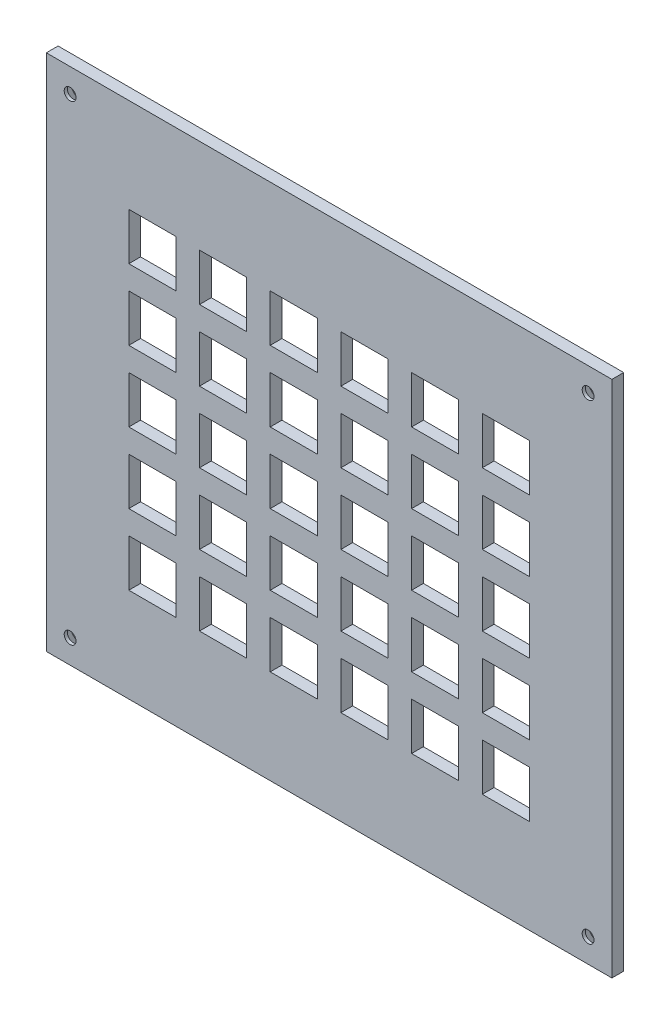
ISO-10303-21;
HEADER;
FILE_DESCRIPTION(('STEP AP214'),'2;1');
FILE_NAME('part.step','',(''),(''),'','','');
FILE_SCHEMA(('AUTOMOTIVE_DESIGN { 1 0 10303 214 1 1 1 1 }'));
ENDSEC;
DATA;
#1=APPLICATION_CONTEXT('core data for automotive mechanical design processes');
#2=APPLICATION_PROTOCOL_DEFINITION('international standard','automotive_design',2000,#1);
#3=PRODUCT_CONTEXT('',#1,'mechanical');
#4=PRODUCT('Part','Part','',(#3));
#5=PRODUCT_RELATED_PRODUCT_CATEGORY('part','',(#4));
#6=PRODUCT_DEFINITION_FORMATION('','',#4);
#7=PRODUCT_DEFINITION_CONTEXT('part definition',#1,'design');
#8=PRODUCT_DEFINITION('design','',#6,#7);
#9=PRODUCT_DEFINITION_SHAPE('','',#8);
#10=(LENGTH_UNIT() NAMED_UNIT(*) SI_UNIT(.MILLI.,.METRE.));
#11=(NAMED_UNIT(*) PLANE_ANGLE_UNIT() SI_UNIT($,.RADIAN.));
#12=(NAMED_UNIT(*) SI_UNIT($,.STERADIAN.) SOLID_ANGLE_UNIT());
#13=UNCERTAINTY_MEASURE_WITH_UNIT(LENGTH_MEASURE(1.E-05),#10,'distance_accuracy_value','');
#14=(GEOMETRIC_REPRESENTATION_CONTEXT(3) GLOBAL_UNCERTAINTY_ASSIGNED_CONTEXT((#13)) GLOBAL_UNIT_ASSIGNED_CONTEXT((#10,
#11,#12)) REPRESENTATION_CONTEXT('',''));
#15=CARTESIAN_POINT('',(0.,0.,0.));
#16=DIRECTION('',(0.,0.,1.));
#17=DIRECTION('',(1.,0.,0.));
#18=AXIS2_PLACEMENT_3D('',#15,#16,#17);
#19=CARTESIAN_POINT('',(76.2,69.85,3.175));
#20=DIRECTION('',(-1.,0.,0.));
#21=DIRECTION('',(0.,-1.,0.));
#22=AXIS2_PLACEMENT_3D('',#19,#20,#21);
#23=PLANE('',#22);
#24=DIRECTION('',(0.,1.,0.));
#25=VECTOR('',#24,1.);
#26=CARTESIAN_POINT('',(76.2,69.85,0.));
#27=LINE('',#26,#25);
#28=CARTESIAN_POINT('',(76.2,-69.85,0.));
#29=VERTEX_POINT('',#28);
#30=CARTESIAN_POINT('',(76.2,69.85,0.));
#31=VERTEX_POINT('',#30);
#32=EDGE_CURVE('E1756',#29,#31,#27,.T.);
#33=ORIENTED_EDGE('',*,*,#32,.T.);
#34=DIRECTION('',(0.,0.,-1.));
#35=VECTOR('',#34,1.);
#36=CARTESIAN_POINT('',(76.2,69.85,3.175));
#37=LINE('',#36,#35);
#38=CARTESIAN_POINT('',(76.2,69.85,3.175));
#39=VERTEX_POINT('',#38);
#40=EDGE_CURVE('E11',#39,#31,#37,.T.);
#41=ORIENTED_EDGE('',*,*,#40,.F.);
#42=DIRECTION('',(0.,1.,0.));
#43=VECTOR('',#42,1.);
#44=CARTESIAN_POINT('',(76.2,69.85,3.175));
#45=LINE('',#44,#43);
#46=CARTESIAN_POINT('',(76.2,-69.85,3.175));
#47=VERTEX_POINT('',#46);
#48=EDGE_CURVE('E1763',#47,#39,#45,.T.);
#49=ORIENTED_EDGE('',*,*,#48,.F.);
#50=DIRECTION('',(0.,0.,-1.));
#51=VECTOR('',#50,1.);
#52=CARTESIAN_POINT('',(76.2,-69.85,3.175));
#53=LINE('',#52,#51);
#54=EDGE_CURVE('E1773',#47,#29,#53,.T.);
#55=ORIENTED_EDGE('',*,*,#54,.T.);
#56=EDGE_LOOP('',(#33,#41,#49,#55));
#57=FACE_BOUND('',#56,.T.);
#58=ADVANCED_FACE('F32',(#57),#23,.F.);
#59=CARTESIAN_POINT('',(-76.2,69.85,3.175));
#60=DIRECTION('',(0.,-1.,0.));
#61=DIRECTION('',(0.,0.,-1.));
#62=AXIS2_PLACEMENT_3D('',#59,#60,#61);
#63=PLANE('',#62);
#64=DIRECTION('',(-1.,0.,0.));
#65=VECTOR('',#64,1.);
#66=CARTESIAN_POINT('',(-76.2,69.85,0.));
#67=LINE('',#66,#65);
#68=CARTESIAN_POINT('',(-76.2,69.85,0.));
#69=VERTEX_POINT('',#68);
#70=EDGE_CURVE('E1776',#31,#69,#67,.T.);
#71=ORIENTED_EDGE('',*,*,#70,.T.);
#72=DIRECTION('',(0.,0.,-1.));
#73=VECTOR('',#72,1.);
#74=CARTESIAN_POINT('',(-76.2,69.85,3.175));
#75=LINE('',#74,#73);
#76=CARTESIAN_POINT('',(-76.2,69.85,3.175));
#77=VERTEX_POINT('',#76);
#78=EDGE_CURVE('E39',#77,#69,#75,.T.);
#79=ORIENTED_EDGE('',*,*,#78,.F.);
#80=DIRECTION('',(-1.,0.,0.));
#81=VECTOR('',#80,1.);
#82=CARTESIAN_POINT('',(-76.2,69.85,3.175));
#83=LINE('',#82,#81);
#84=EDGE_CURVE('E1766',#39,#77,#83,.T.);
#85=ORIENTED_EDGE('',*,*,#84,.F.);
#86=ORIENTED_EDGE('',*,*,#40,.T.);
#87=EDGE_LOOP('',(#71,#79,#85,#86));
#88=FACE_BOUND('',#87,.T.);
#89=ADVANCED_FACE('F1805',(#88),#63,.F.);
#90=CARTESIAN_POINT('',(-76.2,69.85,3.175));
#91=DIRECTION('',(1.,0.,0.));
#92=DIRECTION('',(0.,1.,0.));
#93=AXIS2_PLACEMENT_3D('',#90,#91,#92);
#94=PLANE('',#93);
#95=DIRECTION('',(0.,-1.,0.));
#96=VECTOR('',#95,1.);
#97=CARTESIAN_POINT('',(-76.2,69.85,0.));
#98=LINE('',#97,#96);
#99=CARTESIAN_POINT('',(-76.2,-69.85,0.));
#100=VERTEX_POINT('',#99);
#101=EDGE_CURVE('E1778',#69,#100,#98,.T.);
#102=ORIENTED_EDGE('',*,*,#101,.T.);
#103=DIRECTION('',(0.,0.,-1.));
#104=VECTOR('',#103,1.);
#105=CARTESIAN_POINT('',(-76.2,-69.85,3.175));
#106=LINE('',#105,#104);
#107=CARTESIAN_POINT('',(-76.2,-69.85,3.175));
#108=VERTEX_POINT('',#107);
#109=EDGE_CURVE('E1783',#108,#100,#106,.T.);
#110=ORIENTED_EDGE('',*,*,#109,.F.);
#111=DIRECTION('',(0.,-1.,0.));
#112=VECTOR('',#111,1.);
#113=CARTESIAN_POINT('',(-76.2,69.85,3.175));
#114=LINE('',#113,#112);
#115=EDGE_CURVE('E1769',#77,#108,#114,.T.);
#116=ORIENTED_EDGE('',*,*,#115,.F.);
#117=ORIENTED_EDGE('',*,*,#78,.T.);
#118=EDGE_LOOP('',(#102,#110,#116,#117));
#119=FACE_BOUND('',#118,.T.);
#120=ADVANCED_FACE('F1790',(#119),#94,.F.);
#121=CARTESIAN_POINT('',(-76.2,-69.85,3.175));
#122=DIRECTION('',(0.,1.,0.));
#123=DIRECTION('',(0.,0.,1.));
#124=AXIS2_PLACEMENT_3D('',#121,#122,#123);
#125=PLANE('',#124);
#126=DIRECTION('',(1.,0.,0.));
#127=VECTOR('',#126,1.);
#128=CARTESIAN_POINT('',(-76.2,-69.85,0.));
#129=LINE('',#128,#127);
#130=EDGE_CURVE('E1767',#100,#29,#129,.T.);
#131=ORIENTED_EDGE('',*,*,#130,.T.);
#132=ORIENTED_EDGE('',*,*,#54,.F.);
#133=DIRECTION('',(1.,0.,0.));
#134=VECTOR('',#133,1.);
#135=CARTESIAN_POINT('',(-76.2,-69.85,3.175));
#136=LINE('',#135,#134);
#137=EDGE_CURVE('E1771',#108,#47,#136,.T.);
#138=ORIENTED_EDGE('',*,*,#137,.F.);
#139=ORIENTED_EDGE('',*,*,#109,.T.);
#140=EDGE_LOOP('',(#131,#132,#138,#139));
#141=FACE_BOUND('',#140,.T.);
#142=ADVANCED_FACE('F1798',(#141),#125,.F.);
#143=CARTESIAN_POINT('',(0.,0.,3.175));
#144=DIRECTION('',(0.,0.,1.));
#145=DIRECTION('',(1.,0.,0.));
#146=AXIS2_PLACEMENT_3D('',#143,#144,#145);
#147=PLANE('',#146);
#148=CARTESIAN_POINT('',(-69.7865,-63.4364999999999,3.175));
#149=DIRECTION('',(0.,0.,-1.));
#150=DIRECTION('',(1.,0.,0.));
#151=AXIS2_PLACEMENT_3D('',#148,#149,#150);
#152=CIRCLE('',#151,1.59004000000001);
#153=CARTESIAN_POINT('',(-68.19646,-63.4364999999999,3.175));
#154=VERTEX_POINT('',#153);
#155=EDGE_CURVE('E2331',#154,#154,#152,.T.);
#156=ORIENTED_EDGE('',*,*,#155,.T.);
#157=EDGE_LOOP('',(#156));
#158=FACE_BOUND('',#157,.T.);
#159=CARTESIAN_POINT('',(69.7865,-63.4364999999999,3.175));
#160=DIRECTION('',(0.,0.,1.));
#161=DIRECTION('',(-1.,0.,0.));
#162=AXIS2_PLACEMENT_3D('',#159,#160,#161);
#163=CIRCLE('',#162,1.59004000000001);
#164=CARTESIAN_POINT('',(68.19646,-63.4364999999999,3.175));
#165=VERTEX_POINT('',#164);
#166=EDGE_CURVE('E2338',#165,#165,#163,.T.);
#167=ORIENTED_EDGE('',*,*,#166,.F.);
#168=EDGE_LOOP('',(#167));
#169=FACE_BOUND('',#168,.T.);
#170=CARTESIAN_POINT('',(-69.7865,63.4364999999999,3.175));
#171=DIRECTION('',(0.,0.,1.));
#172=DIRECTION('',(1.,0.,0.));
#173=AXIS2_PLACEMENT_3D('',#170,#171,#172);
#174=CIRCLE('',#173,1.59004000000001);
#175=CARTESIAN_POINT('',(-68.19646,63.4364999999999,3.175));
#176=VERTEX_POINT('',#175);
#177=EDGE_CURVE('E2350',#176,#176,#174,.T.);
#178=ORIENTED_EDGE('',*,*,#177,.F.);
#179=EDGE_LOOP('',(#178));
#180=FACE_BOUND('',#179,.T.);
#181=CARTESIAN_POINT('',(69.7865,63.4364999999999,3.175));
#182=DIRECTION('',(0.,0.,-1.));
#183=DIRECTION('',(-1.,0.,0.));
#184=AXIS2_PLACEMENT_3D('',#181,#182,#183);
#185=CIRCLE('',#184,1.59004000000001);
#186=CARTESIAN_POINT('',(68.19646,63.4364999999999,3.175));
#187=VERTEX_POINT('',#186);
#188=EDGE_CURVE('E2359',#187,#187,#185,.T.);
#189=ORIENTED_EDGE('',*,*,#188,.T.);
#190=EDGE_LOOP('',(#189));
#191=FACE_BOUND('',#190,.T.);
#192=DIRECTION('',(0.,1.,0.));
#193=VECTOR('',#192,1.);
#194=CARTESIAN_POINT('',(15.8749999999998,25.4000000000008,3.175));
#195=LINE('',#194,#193);
#196=CARTESIAN_POINT('',(15.8749999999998,12.7000000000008,3.175));
#197=VERTEX_POINT('',#196);
#198=CARTESIAN_POINT('',(15.8749999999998,25.4000000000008,3.175));
#199=VERTEX_POINT('',#198);
#200=EDGE_CURVE('E46',#197,#199,#195,.T.);
#201=ORIENTED_EDGE('',*,*,#200,.F.);
#202=DIRECTION('',(1.,0.,0.));
#203=VECTOR('',#202,1.);
#204=CARTESIAN_POINT('',(3.17499999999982,12.7000000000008,3.175));
#205=LINE('',#204,#203);
#206=CARTESIAN_POINT('',(3.17499999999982,12.7000000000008,3.175));
#207=VERTEX_POINT('',#206);
#208=EDGE_CURVE('E1130',#207,#197,#205,.T.);
#209=ORIENTED_EDGE('',*,*,#208,.F.);
#210=DIRECTION('',(0.,-1.,0.));
#211=VECTOR('',#210,1.);
#212=CARTESIAN_POINT('',(3.17499999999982,25.4000000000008,3.175));
#213=LINE('',#212,#211);
#214=CARTESIAN_POINT('',(3.17499999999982,25.4000000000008,3.175));
#215=VERTEX_POINT('',#214);
#216=EDGE_CURVE('E1145',#215,#207,#213,.T.);
#217=ORIENTED_EDGE('',*,*,#216,.F.);
#218=DIRECTION('',(-1.,0.,0.));
#219=VECTOR('',#218,1.);
#220=CARTESIAN_POINT('',(3.17499999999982,25.4000000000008,3.175));
#221=LINE('',#220,#219);
#222=EDGE_CURVE('E1141',#199,#215,#221,.T.);
#223=ORIENTED_EDGE('',*,*,#222,.F.);
#224=EDGE_LOOP('',(#201,#209,#217,#223));
#225=FACE_BOUND('',#224,.T.);
#226=DIRECTION('',(0.,1.,0.));
#227=VECTOR('',#226,1.);
#228=CARTESIAN_POINT('',(34.9249999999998,25.400000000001,3.175));
#229=LINE('',#228,#227);
#230=CARTESIAN_POINT('',(34.9249999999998,12.7000000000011,3.175));
#231=VERTEX_POINT('',#230);
#232=CARTESIAN_POINT('',(34.9249999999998,25.400000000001,3.175));
#233=VERTEX_POINT('',#232);
#234=EDGE_CURVE('E54',#231,#233,#229,.T.);
#235=ORIENTED_EDGE('',*,*,#234,.F.);
#236=DIRECTION('',(1.,0.,0.));
#237=VECTOR('',#236,1.);
#238=CARTESIAN_POINT('',(22.2249999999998,12.700000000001,3.175));
#239=LINE('',#238,#237);
#240=CARTESIAN_POINT('',(22.2249999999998,12.700000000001,3.175));
#241=VERTEX_POINT('',#240);
#242=EDGE_CURVE('E1162',#241,#231,#239,.T.);
#243=ORIENTED_EDGE('',*,*,#242,.F.);
#244=DIRECTION('',(0.,-1.,0.));
#245=VECTOR('',#244,1.);
#246=CARTESIAN_POINT('',(22.2249999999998,25.400000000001,3.175));
#247=LINE('',#246,#245);
#248=CARTESIAN_POINT('',(22.2249999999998,25.400000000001,3.175));
#249=VERTEX_POINT('',#248);
#250=EDGE_CURVE('E1176',#249,#241,#247,.T.);
#251=ORIENTED_EDGE('',*,*,#250,.F.);
#252=DIRECTION('',(-1.,0.,0.));
#253=VECTOR('',#252,1.);
#254=CARTESIAN_POINT('',(22.2249999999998,25.400000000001,3.175));
#255=LINE('',#254,#253);
#256=EDGE_CURVE('E1173',#233,#249,#255,.T.);
#257=ORIENTED_EDGE('',*,*,#256,.F.);
#258=EDGE_LOOP('',(#235,#243,#251,#257));
#259=FACE_BOUND('',#258,.T.);
#260=DIRECTION('',(0.,1.,0.));
#261=VECTOR('',#260,1.);
#262=CARTESIAN_POINT('',(53.9749999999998,25.4000000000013,3.175));
#263=LINE('',#262,#261);
#264=CARTESIAN_POINT('',(53.9749999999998,12.7000000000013,3.175));
#265=VERTEX_POINT('',#264);
#266=CARTESIAN_POINT('',(53.9749999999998,25.4000000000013,3.175));
#267=VERTEX_POINT('',#266);
#268=EDGE_CURVE('E1077',#265,#267,#263,.T.);
#269=ORIENTED_EDGE('',*,*,#268,.F.);
#270=DIRECTION('',(1.,0.,0.));
#271=VECTOR('',#270,1.);
#272=CARTESIAN_POINT('',(41.2749999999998,12.7000000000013,3.175));
#273=LINE('',#272,#271);
#274=CARTESIAN_POINT('',(41.2749999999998,12.7000000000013,3.175));
#275=VERTEX_POINT('',#274);
#276=EDGE_CURVE('E1067',#275,#265,#273,.T.);
#277=ORIENTED_EDGE('',*,*,#276,.F.);
#278=DIRECTION('',(0.,-1.,0.));
#279=VECTOR('',#278,1.);
#280=CARTESIAN_POINT('',(41.2749999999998,25.4000000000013,3.175));
#281=LINE('',#280,#279);
#282=CARTESIAN_POINT('',(41.2749999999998,25.4000000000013,3.175));
#283=VERTEX_POINT('',#282);
#284=EDGE_CURVE('E1083',#283,#275,#281,.T.);
#285=ORIENTED_EDGE('',*,*,#284,.F.);
#286=DIRECTION('',(-1.,0.,0.));
#287=VECTOR('',#286,1.);
#288=CARTESIAN_POINT('',(41.2749999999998,25.4000000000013,3.175));
#289=LINE('',#288,#287);
#290=EDGE_CURVE('E1079',#267,#283,#289,.T.);
#291=ORIENTED_EDGE('',*,*,#290,.F.);
#292=EDGE_LOOP('',(#269,#277,#285,#291));
#293=FACE_BOUND('',#292,.T.);
#294=DIRECTION('',(0.,1.,0.));
#295=VECTOR('',#294,1.);
#296=CARTESIAN_POINT('',(-22.2250000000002,44.4500000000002,3.175));
#297=LINE('',#296,#295);
#298=CARTESIAN_POINT('',(-22.2250000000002,31.7500000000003,3.175));
#299=VERTEX_POINT('',#298);
#300=CARTESIAN_POINT('',(-22.2250000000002,44.4500000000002,3.175));
#301=VERTEX_POINT('',#300);
#302=EDGE_CURVE('E836',#299,#301,#297,.T.);
#303=ORIENTED_EDGE('',*,*,#302,.F.);
#304=DIRECTION('',(1.,0.,0.));
#305=VECTOR('',#304,1.);
#306=CARTESIAN_POINT('',(-34.9250000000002,31.7500000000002,3.175));
#307=LINE('',#306,#305);
#308=CARTESIAN_POINT('',(-34.9250000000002,31.7500000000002,3.175));
#309=VERTEX_POINT('',#308);
#310=EDGE_CURVE('E1100',#309,#299,#307,.T.);
#311=ORIENTED_EDGE('',*,*,#310,.F.);
#312=DIRECTION('',(0.,-1.,0.));
#313=VECTOR('',#312,1.);
#314=CARTESIAN_POINT('',(-34.9250000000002,44.4500000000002,3.175));
#315=LINE('',#314,#313);
#316=CARTESIAN_POINT('',(-34.9250000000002,44.4500000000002,3.175));
#317=VERTEX_POINT('',#316);
#318=EDGE_CURVE('E1114',#317,#309,#315,.T.);
#319=ORIENTED_EDGE('',*,*,#318,.F.);
#320=DIRECTION('',(-1.,0.,0.));
#321=VECTOR('',#320,1.);
#322=CARTESIAN_POINT('',(-34.9250000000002,44.4500000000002,3.175));
#323=LINE('',#322,#321);
#324=EDGE_CURVE('E1111',#301,#317,#323,.T.);
#325=ORIENTED_EDGE('',*,*,#324,.F.);
#326=EDGE_LOOP('',(#303,#311,#319,#325));
#327=FACE_BOUND('',#326,.T.);
#328=DIRECTION('',(0.,1.,0.));
#329=VECTOR('',#328,1.);
#330=CARTESIAN_POINT('',(-3.17500000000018,25.4000000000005,3.175));
#331=LINE('',#330,#329);
#332=CARTESIAN_POINT('',(-3.17500000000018,12.7000000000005,3.175));
#333=VERTEX_POINT('',#332);
#334=CARTESIAN_POINT('',(-3.17500000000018,25.4000000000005,3.175));
#335=VERTEX_POINT('',#334);
#336=EDGE_CURVE('E1152',#333,#335,#331,.T.);
#337=ORIENTED_EDGE('',*,*,#336,.F.);
#338=DIRECTION('',(1.,0.,0.));
#339=VECTOR('',#338,1.);
#340=CARTESIAN_POINT('',(-15.8750000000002,12.7000000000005,3.175));
#341=LINE('',#340,#339);
#342=CARTESIAN_POINT('',(-15.8750000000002,12.7000000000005,3.175));
#343=VERTEX_POINT('',#342);
#344=EDGE_CURVE('E1257',#343,#333,#341,.T.);
#345=ORIENTED_EDGE('',*,*,#344,.F.);
#346=DIRECTION('',(0.,-1.,0.));
#347=VECTOR('',#346,1.);
#348=CARTESIAN_POINT('',(-15.8750000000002,25.4000000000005,3.175));
#349=LINE('',#348,#347);
#350=CARTESIAN_POINT('',(-15.8750000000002,25.4000000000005,3.175));
#351=VERTEX_POINT('',#350);
#352=EDGE_CURVE('E1271',#351,#343,#349,.T.);
#353=ORIENTED_EDGE('',*,*,#352,.F.);
#354=DIRECTION('',(-1.,0.,0.));
#355=VECTOR('',#354,1.);
#356=CARTESIAN_POINT('',(-15.8750000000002,25.4000000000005,3.175));
#357=LINE('',#356,#355);
#358=EDGE_CURVE('E1268',#335,#351,#357,.T.);
#359=ORIENTED_EDGE('',*,*,#358,.F.);
#360=EDGE_LOOP('',(#337,#345,#353,#359));
#361=FACE_BOUND('',#360,.T.);
#362=DIRECTION('',(0.,1.,0.));
#363=VECTOR('',#362,1.);
#364=CARTESIAN_POINT('',(-22.2250000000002,25.4000000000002,3.175));
#365=LINE('',#364,#363);
#366=CARTESIAN_POINT('',(-22.2250000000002,12.7000000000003,3.175));
#367=VERTEX_POINT('',#366);
#368=CARTESIAN_POINT('',(-22.2250000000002,25.4000000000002,3.175));
#369=VERTEX_POINT('',#368);
#370=EDGE_CURVE('E1235',#367,#369,#365,.T.);
#371=ORIENTED_EDGE('',*,*,#370,.F.);
#372=DIRECTION('',(1.,0.,0.));
#373=VECTOR('',#372,1.);
#374=CARTESIAN_POINT('',(-34.9250000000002,12.7000000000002,3.175));
#375=LINE('',#374,#373);
#376=CARTESIAN_POINT('',(-34.9250000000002,12.7000000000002,3.175));
#377=VERTEX_POINT('',#376);
#378=EDGE_CURVE('E1225',#377,#367,#375,.T.);
#379=ORIENTED_EDGE('',*,*,#378,.F.);
#380=DIRECTION('',(0.,-1.,0.));
#381=VECTOR('',#380,1.);
#382=CARTESIAN_POINT('',(-34.9250000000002,25.4000000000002,3.175));
#383=LINE('',#382,#381);
#384=CARTESIAN_POINT('',(-34.9250000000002,25.4000000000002,3.175));
#385=VERTEX_POINT('',#384);
#386=EDGE_CURVE('E1241',#385,#377,#383,.T.);
#387=ORIENTED_EDGE('',*,*,#386,.F.);
#388=DIRECTION('',(-1.,0.,0.));
#389=VECTOR('',#388,1.);
#390=CARTESIAN_POINT('',(-34.9250000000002,25.4000000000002,3.175));
#391=LINE('',#390,#389);
#392=EDGE_CURVE('E1237',#369,#385,#391,.T.);
#393=ORIENTED_EDGE('',*,*,#392,.F.);
#394=EDGE_LOOP('',(#371,#379,#387,#393));
#395=FACE_BOUND('',#394,.T.);
#396=DIRECTION('',(0.,1.,0.));
#397=VECTOR('',#396,1.);
#398=CARTESIAN_POINT('',(53.9749999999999,6.35000000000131,3.175));
#399=LINE('',#398,#397);
#400=CARTESIAN_POINT('',(53.9749999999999,-6.34999999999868,3.175));
#401=VERTEX_POINT('',#400);
#402=CARTESIAN_POINT('',(53.9749999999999,6.35000000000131,3.175));
#403=VERTEX_POINT('',#402);
#404=EDGE_CURVE('E1201',#401,#403,#399,.T.);
#405=ORIENTED_EDGE('',*,*,#404,.F.);
#406=DIRECTION('',(1.,0.,0.));
#407=VECTOR('',#406,1.);
#408=CARTESIAN_POINT('',(41.2749999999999,-6.34999999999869,3.175));
#409=LINE('',#408,#407);
#410=CARTESIAN_POINT('',(41.2749999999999,-6.34999999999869,3.175));
#411=VERTEX_POINT('',#410);
#412=EDGE_CURVE('E1191',#411,#401,#409,.T.);
#413=ORIENTED_EDGE('',*,*,#412,.F.);
#414=DIRECTION('',(0.,-1.,0.));
#415=VECTOR('',#414,1.);
#416=CARTESIAN_POINT('',(41.2749999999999,6.35000000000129,3.175));
#417=LINE('',#416,#415);
#418=CARTESIAN_POINT('',(41.2749999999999,6.35000000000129,3.175));
#419=VERTEX_POINT('',#418);
#420=EDGE_CURVE('E1207',#419,#411,#417,.T.);
#421=ORIENTED_EDGE('',*,*,#420,.F.);
#422=DIRECTION('',(-1.,0.,0.));
#423=VECTOR('',#422,1.);
#424=CARTESIAN_POINT('',(41.2749999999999,6.35000000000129,3.175));
#425=LINE('',#424,#423);
#426=EDGE_CURVE('E1203',#403,#419,#425,.T.);
#427=ORIENTED_EDGE('',*,*,#426,.F.);
#428=EDGE_LOOP('',(#405,#413,#421,#427));
#429=FACE_BOUND('',#428,.T.);
#430=DIRECTION('',(0.,1.,0.));
#431=VECTOR('',#430,1.);
#432=CARTESIAN_POINT('',(-3.17500000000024,44.4500000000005,3.175));
#433=LINE('',#432,#431);
#434=CARTESIAN_POINT('',(-3.17500000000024,31.7500000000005,3.175));
#435=VERTEX_POINT('',#434);
#436=CARTESIAN_POINT('',(-3.17500000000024,44.4500000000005,3.175));
#437=VERTEX_POINT('',#436);
#438=EDGE_CURVE('E799',#435,#437,#433,.T.);
#439=ORIENTED_EDGE('',*,*,#438,.F.);
#440=DIRECTION('',(1.,0.,0.));
#441=VECTOR('',#440,1.);
#442=CARTESIAN_POINT('',(-15.8750000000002,31.7500000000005,3.175));
#443=LINE('',#442,#441);
#444=CARTESIAN_POINT('',(-15.8750000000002,31.7500000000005,3.175));
#445=VERTEX_POINT('',#444);
#446=EDGE_CURVE('E817',#445,#435,#443,.T.);
#447=ORIENTED_EDGE('',*,*,#446,.F.);
#448=DIRECTION('',(0.,-1.,0.));
#449=VECTOR('',#448,1.);
#450=CARTESIAN_POINT('',(-15.8750000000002,44.4500000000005,3.175));
#451=LINE('',#450,#449);
#452=CARTESIAN_POINT('',(-15.8750000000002,44.4500000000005,3.175));
#453=VERTEX_POINT('',#452);
#454=EDGE_CURVE('E820',#453,#445,#451,.T.);
#455=ORIENTED_EDGE('',*,*,#454,.F.);
#456=DIRECTION('',(-1.,0.,0.));
#457=VECTOR('',#456,1.);
#458=CARTESIAN_POINT('',(-15.8750000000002,44.4500000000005,3.175));
#459=LINE('',#458,#457);
#460=EDGE_CURVE('E829',#437,#453,#459,.T.);
#461=ORIENTED_EDGE('',*,*,#460,.F.);
#462=EDGE_LOOP('',(#439,#447,#455,#461));
#463=FACE_BOUND('',#462,.T.);
#464=DIRECTION('',(0.,1.,0.));
#465=VECTOR('',#464,1.);
#466=CARTESIAN_POINT('',(15.8749999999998,44.4500000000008,3.175));
#467=LINE('',#466,#465);
#468=CARTESIAN_POINT('',(15.8749999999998,31.7500000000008,3.175));
#469=VERTEX_POINT('',#468);
#470=CARTESIAN_POINT('',(15.8749999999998,44.4500000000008,3.175));
#471=VERTEX_POINT('',#470);
#472=EDGE_CURVE('E854',#469,#471,#467,.T.);
#473=ORIENTED_EDGE('',*,*,#472,.F.);
#474=DIRECTION('',(1.,0.,0.));
#475=VECTOR('',#474,1.);
#476=CARTESIAN_POINT('',(3.17499999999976,31.7500000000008,3.175));
#477=LINE('',#476,#475);
#478=CARTESIAN_POINT('',(3.17499999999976,31.7500000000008,3.175));
#479=VERTEX_POINT('',#478);
#480=EDGE_CURVE('E844',#479,#469,#477,.T.);
#481=ORIENTED_EDGE('',*,*,#480,.F.);
#482=DIRECTION('',(0.,-1.,0.));
#483=VECTOR('',#482,1.);
#484=CARTESIAN_POINT('',(3.17499999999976,44.4500000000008,3.175));
#485=LINE('',#484,#483);
#486=CARTESIAN_POINT('',(3.17499999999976,44.4500000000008,3.175));
#487=VERTEX_POINT('',#486);
#488=EDGE_CURVE('E860',#487,#479,#485,.T.);
#489=ORIENTED_EDGE('',*,*,#488,.F.);
#490=DIRECTION('',(-1.,0.,0.));
#491=VECTOR('',#490,1.);
#492=CARTESIAN_POINT('',(3.17499999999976,44.4500000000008,3.175));
#493=LINE('',#492,#491);
#494=EDGE_CURVE('E856',#471,#487,#493,.T.);
#495=ORIENTED_EDGE('',*,*,#494,.F.);
#496=EDGE_LOOP('',(#473,#481,#489,#495));
#497=FACE_BOUND('',#496,.T.);
#498=DIRECTION('',(0.,1.,0.));
#499=VECTOR('',#498,1.);
#500=CARTESIAN_POINT('',(34.9249999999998,44.450000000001,3.175));
#501=LINE('',#500,#499);
#502=CARTESIAN_POINT('',(34.9249999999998,31.7500000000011,3.175));
#503=VERTEX_POINT('',#502);
#504=CARTESIAN_POINT('',(34.9249999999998,44.450000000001,3.175));
#505=VERTEX_POINT('',#504);
#506=EDGE_CURVE('E886',#503,#505,#501,.T.);
#507=ORIENTED_EDGE('',*,*,#506,.F.);
#508=DIRECTION('',(1.,0.,0.));
#509=VECTOR('',#508,1.);
#510=CARTESIAN_POINT('',(22.2249999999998,31.750000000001,3.175));
#511=LINE('',#510,#509);
#512=CARTESIAN_POINT('',(22.2249999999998,31.750000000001,3.175));
#513=VERTEX_POINT('',#512);
#514=EDGE_CURVE('E876',#513,#503,#511,.T.);
#515=ORIENTED_EDGE('',*,*,#514,.F.);
#516=DIRECTION('',(0.,-1.,0.));
#517=VECTOR('',#516,1.);
#518=CARTESIAN_POINT('',(22.2249999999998,44.450000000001,3.175));
#519=LINE('',#518,#517);
#520=CARTESIAN_POINT('',(22.2249999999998,44.450000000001,3.175));
#521=VERTEX_POINT('',#520);
#522=EDGE_CURVE('E892',#521,#513,#519,.T.);
#523=ORIENTED_EDGE('',*,*,#522,.F.);
#524=DIRECTION('',(-1.,0.,0.));
#525=VECTOR('',#524,1.);
#526=CARTESIAN_POINT('',(22.2249999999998,44.450000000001,3.175));
#527=LINE('',#526,#525);
#528=EDGE_CURVE('E888',#505,#521,#527,.T.);
#529=ORIENTED_EDGE('',*,*,#528,.F.);
#530=EDGE_LOOP('',(#507,#515,#523,#529));
#531=FACE_BOUND('',#530,.T.);
#532=DIRECTION('',(0.,1.,0.));
#533=VECTOR('',#532,1.);
#534=CARTESIAN_POINT('',(53.9749999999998,44.4500000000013,3.175));
#535=LINE('',#534,#533);
#536=CARTESIAN_POINT('',(53.9749999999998,31.7500000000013,3.175));
#537=VERTEX_POINT('',#536);
#538=CARTESIAN_POINT('',(53.9749999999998,44.4500000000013,3.175));
#539=VERTEX_POINT('',#538);
#540=EDGE_CURVE('E918',#537,#539,#535,.T.);
#541=ORIENTED_EDGE('',*,*,#540,.F.);
#542=DIRECTION('',(1.,0.,0.));
#543=VECTOR('',#542,1.);
#544=CARTESIAN_POINT('',(41.2749999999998,31.7500000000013,3.175));
#545=LINE('',#544,#543);
#546=CARTESIAN_POINT('',(41.2749999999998,31.7500000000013,3.175));
#547=VERTEX_POINT('',#546);
#548=EDGE_CURVE('E908',#547,#537,#545,.T.);
#549=ORIENTED_EDGE('',*,*,#548,.F.);
#550=DIRECTION('',(0.,-1.,0.));
#551=VECTOR('',#550,1.);
#552=CARTESIAN_POINT('',(41.2749999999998,44.4500000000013,3.175));
#553=LINE('',#552,#551);
#554=CARTESIAN_POINT('',(41.2749999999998,44.4500000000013,3.175));
#555=VERTEX_POINT('',#554);
#556=EDGE_CURVE('E924',#555,#547,#553,.T.);
#557=ORIENTED_EDGE('',*,*,#556,.F.);
#558=DIRECTION('',(-1.,0.,0.));
#559=VECTOR('',#558,1.);
#560=CARTESIAN_POINT('',(41.2749999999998,44.4500000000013,3.175));
#561=LINE('',#560,#559);
#562=EDGE_CURVE('E920',#539,#555,#561,.T.);
#563=ORIENTED_EDGE('',*,*,#562,.F.);
#564=EDGE_LOOP('',(#541,#549,#557,#563));
#565=FACE_BOUND('',#564,.T.);
#566=DIRECTION('',(0.,1.,0.));
#567=VECTOR('',#566,1.);
#568=CARTESIAN_POINT('',(-41.275,-12.7,3.175));
#569=LINE('',#568,#567);
#570=CARTESIAN_POINT('',(-41.275,-25.4,3.175));
#571=VERTEX_POINT('',#570);
#572=CARTESIAN_POINT('',(-41.275,-12.7,3.175));
#573=VERTEX_POINT('',#572);
#574=EDGE_CURVE('E950',#571,#573,#569,.T.);
#575=ORIENTED_EDGE('',*,*,#574,.F.);
#576=DIRECTION('',(1.,0.,0.));
#577=VECTOR('',#576,1.);
#578=CARTESIAN_POINT('',(-53.9750000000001,-25.4,3.175));
#579=LINE('',#578,#577);
#580=CARTESIAN_POINT('',(-53.9750000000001,-25.4,3.175));
#581=VERTEX_POINT('',#580);
#582=EDGE_CURVE('E940',#581,#571,#579,.T.);
#583=ORIENTED_EDGE('',*,*,#582,.F.);
#584=DIRECTION('',(0.,-1.,0.));
#585=VECTOR('',#584,1.);
#586=CARTESIAN_POINT('',(-53.9750000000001,-12.7,3.175));
#587=LINE('',#586,#585);
#588=CARTESIAN_POINT('',(-53.9750000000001,-12.7,3.175));
#589=VERTEX_POINT('',#588);
#590=EDGE_CURVE('E956',#589,#581,#587,.T.);
#591=ORIENTED_EDGE('',*,*,#590,.F.);
#592=DIRECTION('',(-1.,0.,0.));
#593=VECTOR('',#592,1.);
#594=CARTESIAN_POINT('',(-53.9750000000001,-12.7,3.175));
#595=LINE('',#594,#593);
#596=EDGE_CURVE('E952',#573,#589,#595,.T.);
#597=ORIENTED_EDGE('',*,*,#596,.F.);
#598=EDGE_LOOP('',(#575,#583,#591,#597));
#599=FACE_BOUND('',#598,.T.);
#600=DIRECTION('',(0.,1.,0.));
#601=VECTOR('',#600,1.);
#602=CARTESIAN_POINT('',(-41.2750000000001,6.34999999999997,3.175));
#603=LINE('',#602,#601);
#604=CARTESIAN_POINT('',(-41.2750000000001,-6.35000000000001,3.175));
#605=VERTEX_POINT('',#604);
#606=CARTESIAN_POINT('',(-41.2750000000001,6.34999999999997,3.175));
#607=VERTEX_POINT('',#606);
#608=EDGE_CURVE('E982',#605,#607,#603,.T.);
#609=ORIENTED_EDGE('',*,*,#608,.F.);
#610=DIRECTION('',(1.,0.,0.));
#611=VECTOR('',#610,1.);
#612=CARTESIAN_POINT('',(-53.9750000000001,-6.35000000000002,3.175));
#613=LINE('',#612,#611);
#614=CARTESIAN_POINT('',(-53.9750000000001,-6.35000000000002,3.175));
#615=VERTEX_POINT('',#614);
#616=EDGE_CURVE('E972',#615,#605,#613,.T.);
#617=ORIENTED_EDGE('',*,*,#616,.F.);
#618=DIRECTION('',(0.,-1.,0.));
#619=VECTOR('',#618,1.);
#620=CARTESIAN_POINT('',(-53.9750000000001,6.34999999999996,3.175));
#621=LINE('',#620,#619);
#622=CARTESIAN_POINT('',(-53.9750000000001,6.34999999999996,3.175));
#623=VERTEX_POINT('',#622);
#624=EDGE_CURVE('E988',#623,#615,#621,.T.);
#625=ORIENTED_EDGE('',*,*,#624,.F.);
#626=DIRECTION('',(-1.,0.,0.));
#627=VECTOR('',#626,1.);
#628=CARTESIAN_POINT('',(-53.9750000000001,6.34999999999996,3.175));
#629=LINE('',#628,#627);
#630=EDGE_CURVE('E984',#607,#623,#629,.T.);
#631=ORIENTED_EDGE('',*,*,#630,.F.);
#632=EDGE_LOOP('',(#609,#617,#625,#631));
#633=FACE_BOUND('',#632,.T.);
#634=DIRECTION('',(0.,1.,0.));
#635=VECTOR('',#634,1.);
#636=CARTESIAN_POINT('',(-41.2750000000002,25.4,3.175));
#637=LINE('',#636,#635);
#638=CARTESIAN_POINT('',(-41.2750000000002,12.7,3.175));
#639=VERTEX_POINT('',#638);
#640=CARTESIAN_POINT('',(-41.2750000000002,25.4,3.175));
#641=VERTEX_POINT('',#640);
#642=EDGE_CURVE('E1014',#639,#641,#637,.T.);
#643=ORIENTED_EDGE('',*,*,#642,.F.);
#644=DIRECTION('',(1.,0.,0.));
#645=VECTOR('',#644,1.);
#646=CARTESIAN_POINT('',(-53.9750000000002,12.7,3.175));
#647=LINE('',#646,#645);
#648=CARTESIAN_POINT('',(-53.9750000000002,12.7,3.175));
#649=VERTEX_POINT('',#648);
#650=EDGE_CURVE('E1004',#649,#639,#647,.T.);
#651=ORIENTED_EDGE('',*,*,#650,.F.);
#652=DIRECTION('',(0.,-1.,0.));
#653=VECTOR('',#652,1.);
#654=CARTESIAN_POINT('',(-53.9750000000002,25.4,3.175));
#655=LINE('',#654,#653);
#656=CARTESIAN_POINT('',(-53.9750000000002,25.4,3.175));
#657=VERTEX_POINT('',#656);
#658=EDGE_CURVE('E1020',#657,#649,#655,.T.);
#659=ORIENTED_EDGE('',*,*,#658,.F.);
#660=DIRECTION('',(-1.,0.,0.));
#661=VECTOR('',#660,1.);
#662=CARTESIAN_POINT('',(-53.9750000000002,25.4,3.175));
#663=LINE('',#662,#661);
#664=EDGE_CURVE('E1016',#641,#657,#663,.T.);
#665=ORIENTED_EDGE('',*,*,#664,.F.);
#666=EDGE_LOOP('',(#643,#651,#659,#665));
#667=FACE_BOUND('',#666,.T.);
#668=DIRECTION('',(0.,1.,0.));
#669=VECTOR('',#668,1.);
#670=CARTESIAN_POINT('',(-41.2750000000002,44.45,3.175));
#671=LINE('',#670,#669);
#672=CARTESIAN_POINT('',(-41.2750000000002,31.75,3.175));
#673=VERTEX_POINT('',#672);
#674=CARTESIAN_POINT('',(-41.2750000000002,44.45,3.175));
#675=VERTEX_POINT('',#674);
#676=EDGE_CURVE('E1046',#673,#675,#671,.T.);
#677=ORIENTED_EDGE('',*,*,#676,.F.);
#678=DIRECTION('',(1.,0.,0.));
#679=VECTOR('',#678,1.);
#680=CARTESIAN_POINT('',(-53.9750000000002,31.75,3.175));
#681=LINE('',#680,#679);
#682=CARTESIAN_POINT('',(-53.9750000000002,31.75,3.175));
#683=VERTEX_POINT('',#682);
#684=EDGE_CURVE('E1036',#683,#673,#681,.T.);
#685=ORIENTED_EDGE('',*,*,#684,.F.);
#686=DIRECTION('',(0.,-1.,0.));
#687=VECTOR('',#686,1.);
#688=CARTESIAN_POINT('',(-53.9750000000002,44.45,3.175));
#689=LINE('',#688,#687);
#690=CARTESIAN_POINT('',(-53.9750000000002,44.45,3.175));
#691=VERTEX_POINT('',#690);
#692=EDGE_CURVE('E1051',#691,#683,#689,.T.);
#693=ORIENTED_EDGE('',*,*,#692,.F.);
#694=DIRECTION('',(-1.,0.,0.));
#695=VECTOR('',#694,1.);
#696=CARTESIAN_POINT('',(-53.9750000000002,44.45,3.175));
#697=LINE('',#696,#695);
#698=EDGE_CURVE('E1048',#675,#691,#697,.T.);
#699=ORIENTED_EDGE('',*,*,#698,.F.);
#700=EDGE_LOOP('',(#677,#685,#693,#699));
#701=FACE_BOUND('',#700,.T.);
#702=DIRECTION('',(0.,1.,0.));
#703=VECTOR('',#702,1.);
#704=CARTESIAN_POINT('',(-3.17500000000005,-12.6999999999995,3.175));
#705=LINE('',#704,#703);
#706=CARTESIAN_POINT('',(-3.17500000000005,-25.3999999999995,3.175));
#707=VERTEX_POINT('',#706);
#708=CARTESIAN_POINT('',(-3.17500000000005,-12.6999999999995,3.175));
#709=VERTEX_POINT('',#708);
#710=EDGE_CURVE('E1310',#707,#709,#705,.T.);
#711=ORIENTED_EDGE('',*,*,#710,.F.);
#712=DIRECTION('',(1.,0.,0.));
#713=VECTOR('',#712,1.);
#714=CARTESIAN_POINT('',(-15.875,-25.3999999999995,3.175));
#715=LINE('',#714,#713);
#716=CARTESIAN_POINT('',(-15.875,-25.3999999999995,3.175));
#717=VERTEX_POINT('',#716);
#718=EDGE_CURVE('E1609',#717,#707,#715,.T.);
#719=ORIENTED_EDGE('',*,*,#718,.F.);
#720=DIRECTION('',(0.,-1.,0.));
#721=VECTOR('',#720,1.);
#722=CARTESIAN_POINT('',(-15.875,-12.6999999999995,3.175));
#723=LINE('',#722,#721);
#724=CARTESIAN_POINT('',(-15.875,-12.6999999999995,3.175));
#725=VERTEX_POINT('',#724);
#726=EDGE_CURVE('E1623',#725,#717,#723,.T.);
#727=ORIENTED_EDGE('',*,*,#726,.F.);
#728=DIRECTION('',(-1.,0.,0.));
#729=VECTOR('',#728,1.);
#730=CARTESIAN_POINT('',(-15.875,-12.6999999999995,3.175));
#731=LINE('',#730,#729);
#732=EDGE_CURVE('E1620',#709,#725,#731,.T.);
#733=ORIENTED_EDGE('',*,*,#732,.F.);
#734=EDGE_LOOP('',(#711,#719,#727,#733));
#735=FACE_BOUND('',#734,.T.);
#736=DIRECTION('',(0.,1.,0.));
#737=VECTOR('',#736,1.);
#738=CARTESIAN_POINT('',(-22.225,-12.6999999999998,3.175));
#739=LINE('',#738,#737);
#740=CARTESIAN_POINT('',(-22.225,-25.3999999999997,3.175));
#741=VERTEX_POINT('',#740);
#742=CARTESIAN_POINT('',(-22.225,-12.6999999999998,3.175));
#743=VERTEX_POINT('',#742);
#744=EDGE_CURVE('E1587',#741,#743,#739,.T.);
#745=ORIENTED_EDGE('',*,*,#744,.F.);
#746=DIRECTION('',(1.,0.,0.));
#747=VECTOR('',#746,1.);
#748=CARTESIAN_POINT('',(-34.925,-25.3999999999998,3.175));
#749=LINE('',#748,#747);
#750=CARTESIAN_POINT('',(-34.925,-25.3999999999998,3.175));
#751=VERTEX_POINT('',#750);
#752=EDGE_CURVE('E1577',#751,#741,#749,.T.);
#753=ORIENTED_EDGE('',*,*,#752,.F.);
#754=DIRECTION('',(0.,-1.,0.));
#755=VECTOR('',#754,1.);
#756=CARTESIAN_POINT('',(-34.925,-12.6999999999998,3.175));
#757=LINE('',#756,#755);
#758=CARTESIAN_POINT('',(-34.925,-12.6999999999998,3.175));
#759=VERTEX_POINT('',#758);
#760=EDGE_CURVE('E1593',#759,#751,#757,.T.);
#761=ORIENTED_EDGE('',*,*,#760,.F.);
#762=DIRECTION('',(-1.,0.,0.));
#763=VECTOR('',#762,1.);
#764=CARTESIAN_POINT('',(-34.925,-12.6999999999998,3.175));
#765=LINE('',#764,#763);
#766=EDGE_CURVE('E1589',#743,#759,#765,.T.);
#767=ORIENTED_EDGE('',*,*,#766,.F.);
#768=EDGE_LOOP('',(#745,#753,#761,#767));
#769=FACE_BOUND('',#768,.T.);
#770=DIRECTION('',(0.,1.,0.));
#771=VECTOR('',#770,1.);
#772=CARTESIAN_POINT('',(53.975,-31.7499999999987,3.175));
#773=LINE('',#772,#771);
#774=CARTESIAN_POINT('',(53.975,-44.4499999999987,3.175));
#775=VERTEX_POINT('',#774);
#776=CARTESIAN_POINT('',(53.975,-31.7499999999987,3.175));
#777=VERTEX_POINT('',#776);
#778=EDGE_CURVE('E1555',#775,#777,#773,.T.);
#779=ORIENTED_EDGE('',*,*,#778,.F.);
#780=DIRECTION('',(1.,0.,0.));
#781=VECTOR('',#780,1.);
#782=CARTESIAN_POINT('',(41.275,-44.4499999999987,3.175));
#783=LINE('',#782,#781);
#784=CARTESIAN_POINT('',(41.275,-44.4499999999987,3.175));
#785=VERTEX_POINT('',#784);
#786=EDGE_CURVE('E1545',#785,#775,#783,.T.);
#787=ORIENTED_EDGE('',*,*,#786,.F.);
#788=DIRECTION('',(0.,-1.,0.));
#789=VECTOR('',#788,1.);
#790=CARTESIAN_POINT('',(41.275,-31.7499999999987,3.175));
#791=LINE('',#790,#789);
#792=CARTESIAN_POINT('',(41.275,-31.7499999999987,3.175));
#793=VERTEX_POINT('',#792);
#794=EDGE_CURVE('E1561',#793,#785,#791,.T.);
#795=ORIENTED_EDGE('',*,*,#794,.F.);
#796=DIRECTION('',(-1.,0.,0.));
#797=VECTOR('',#796,1.);
#798=CARTESIAN_POINT('',(41.275,-31.7499999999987,3.175));
#799=LINE('',#798,#797);
#800=EDGE_CURVE('E1557',#777,#793,#799,.T.);
#801=ORIENTED_EDGE('',*,*,#800,.F.);
#802=EDGE_LOOP('',(#779,#787,#795,#801));
#803=FACE_BOUND('',#802,.T.);
#804=DIRECTION('',(0.,1.,0.));
#805=VECTOR('',#804,1.);
#806=CARTESIAN_POINT('',(34.925,-31.749999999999,3.175));
#807=LINE('',#806,#805);
#808=CARTESIAN_POINT('',(34.925,-44.449999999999,3.175));
#809=VERTEX_POINT('',#808);
#810=CARTESIAN_POINT('',(34.925,-31.749999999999,3.175));
#811=VERTEX_POINT('',#810);
#812=EDGE_CURVE('E1521',#809,#811,#807,.T.);
#813=ORIENTED_EDGE('',*,*,#812,.F.);
#814=DIRECTION('',(1.,0.,0.));
#815=VECTOR('',#814,1.);
#816=CARTESIAN_POINT('',(22.225,-44.449999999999,3.175));
#817=LINE('',#816,#815);
#818=CARTESIAN_POINT('',(22.225,-44.449999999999,3.175));
#819=VERTEX_POINT('',#818);
#820=EDGE_CURVE('E1511',#819,#809,#817,.T.);
#821=ORIENTED_EDGE('',*,*,#820,.F.);
#822=DIRECTION('',(0.,-1.,0.));
#823=VECTOR('',#822,1.);
#824=CARTESIAN_POINT('',(22.225,-31.749999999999,3.175));
#825=LINE('',#824,#823);
#826=CARTESIAN_POINT('',(22.225,-31.749999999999,3.175));
#827=VERTEX_POINT('',#826);
#828=EDGE_CURVE('E1527',#827,#819,#825,.T.);
#829=ORIENTED_EDGE('',*,*,#828,.F.);
#830=DIRECTION('',(-1.,0.,0.));
#831=VECTOR('',#830,1.);
#832=CARTESIAN_POINT('',(22.225,-31.749999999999,3.175));
#833=LINE('',#832,#831);
#834=EDGE_CURVE('E1523',#811,#827,#833,.T.);
#835=ORIENTED_EDGE('',*,*,#834,.F.);
#836=EDGE_LOOP('',(#813,#821,#829,#835));
#837=FACE_BOUND('',#836,.T.);
#838=DIRECTION('',(0.,1.,0.));
#839=VECTOR('',#838,1.);
#840=CARTESIAN_POINT('',(15.875,-31.7499999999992,3.175));
#841=LINE('',#840,#839);
#842=CARTESIAN_POINT('',(15.875,-44.4499999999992,3.175));
#843=VERTEX_POINT('',#842);
#844=CARTESIAN_POINT('',(15.875,-31.7499999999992,3.175));
#845=VERTEX_POINT('',#844);
#846=EDGE_CURVE('E1534',#843,#845,#841,.T.);
#847=ORIENTED_EDGE('',*,*,#846,.F.);
#848=DIRECTION('',(1.,0.,0.));
#849=VECTOR('',#848,1.);
#850=CARTESIAN_POINT('',(3.17500000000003,-44.4499999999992,3.175));
#851=LINE('',#850,#849);
#852=CARTESIAN_POINT('',(3.17500000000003,-44.4499999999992,3.175));
#853=VERTEX_POINT('',#852);
#854=EDGE_CURVE('E1705',#853,#843,#851,.T.);
#855=ORIENTED_EDGE('',*,*,#854,.F.);
#856=DIRECTION('',(0.,-1.,0.));
#857=VECTOR('',#856,1.);
#858=CARTESIAN_POINT('',(3.17500000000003,-31.7499999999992,3.175));
#859=LINE('',#858,#857);
#860=CARTESIAN_POINT('',(3.17500000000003,-31.7499999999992,3.175));
#861=VERTEX_POINT('',#860);
#862=EDGE_CURVE('E1719',#861,#853,#859,.T.);
#863=ORIENTED_EDGE('',*,*,#862,.F.);
#864=DIRECTION('',(-1.,0.,0.));
#865=VECTOR('',#864,1.);
#866=CARTESIAN_POINT('',(3.17500000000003,-31.7499999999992,3.175));
#867=LINE('',#866,#865);
#868=EDGE_CURVE('E1716',#845,#861,#867,.T.);
#869=ORIENTED_EDGE('',*,*,#868,.F.);
#870=EDGE_LOOP('',(#847,#855,#863,#869));
#871=FACE_BOUND('',#870,.T.);
#872=DIRECTION('',(0.,1.,0.));
#873=VECTOR('',#872,1.);
#874=CARTESIAN_POINT('',(-3.17499999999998,-31.7499999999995,3.175));
#875=LINE('',#874,#873);
#876=CARTESIAN_POINT('',(-3.17499999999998,-44.4499999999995,3.175));
#877=VERTEX_POINT('',#876);
#878=CARTESIAN_POINT('',(-3.17499999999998,-31.7499999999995,3.175));
#879=VERTEX_POINT('',#878);
#880=EDGE_CURVE('E1683',#877,#879,#875,.T.);
#881=ORIENTED_EDGE('',*,*,#880,.F.);
#882=DIRECTION('',(1.,0.,0.));
#883=VECTOR('',#882,1.);
#884=CARTESIAN_POINT('',(-15.875,-44.4499999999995,3.175));
#885=LINE('',#884,#883);
#886=CARTESIAN_POINT('',(-15.875,-44.4499999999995,3.175));
#887=VERTEX_POINT('',#886);
#888=EDGE_CURVE('E1673',#887,#877,#885,.T.);
#889=ORIENTED_EDGE('',*,*,#888,.F.);
#890=DIRECTION('',(0.,-1.,0.));
#891=VECTOR('',#890,1.);
#892=CARTESIAN_POINT('',(-15.875,-31.7499999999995,3.175));
#893=LINE('',#892,#891);
#894=CARTESIAN_POINT('',(-15.875,-31.7499999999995,3.175));
#895=VERTEX_POINT('',#894);
#896=EDGE_CURVE('E1689',#895,#887,#893,.T.);
#897=ORIENTED_EDGE('',*,*,#896,.F.);
#898=DIRECTION('',(-1.,0.,0.));
#899=VECTOR('',#898,1.);
#900=CARTESIAN_POINT('',(-15.875,-31.7499999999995,3.175));
#901=LINE('',#900,#899);
#902=EDGE_CURVE('E1685',#879,#895,#901,.T.);
#903=ORIENTED_EDGE('',*,*,#902,.F.);
#904=EDGE_LOOP('',(#881,#889,#897,#903));
#905=FACE_BOUND('',#904,.T.);
#906=DIRECTION('',(0.,1.,0.));
#907=VECTOR('',#906,1.);
#908=CARTESIAN_POINT('',(-22.225,-31.7499999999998,3.175));
#909=LINE('',#908,#907);
#910=CARTESIAN_POINT('',(-22.225,-44.4499999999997,3.175));
#911=VERTEX_POINT('',#910);
#912=CARTESIAN_POINT('',(-22.225,-31.7499999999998,3.175));
#913=VERTEX_POINT('',#912);
#914=EDGE_CURVE('E1649',#911,#913,#909,.T.);
#915=ORIENTED_EDGE('',*,*,#914,.F.);
#916=DIRECTION('',(1.,0.,0.));
#917=VECTOR('',#916,1.);
#918=CARTESIAN_POINT('',(-34.925,-44.4499999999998,3.175));
#919=LINE('',#918,#917);
#920=CARTESIAN_POINT('',(-34.925,-44.4499999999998,3.175));
#921=VERTEX_POINT('',#920);
#922=EDGE_CURVE('E1639',#921,#911,#919,.T.);
#923=ORIENTED_EDGE('',*,*,#922,.F.);
#924=DIRECTION('',(0.,-1.,0.));
#925=VECTOR('',#924,1.);
#926=CARTESIAN_POINT('',(-34.925,-31.7499999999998,3.175));
#927=LINE('',#926,#925);
#928=CARTESIAN_POINT('',(-34.925,-31.7499999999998,3.175));
#929=VERTEX_POINT('',#928);
#930=EDGE_CURVE('E1655',#929,#921,#927,.T.);
#931=ORIENTED_EDGE('',*,*,#930,.F.);
#932=DIRECTION('',(-1.,0.,0.));
#933=VECTOR('',#932,1.);
#934=CARTESIAN_POINT('',(-34.925,-31.7499999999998,3.175));
#935=LINE('',#934,#933);
#936=EDGE_CURVE('E1651',#913,#929,#935,.T.);
#937=ORIENTED_EDGE('',*,*,#936,.F.);
#938=EDGE_LOOP('',(#915,#923,#931,#937));
#939=FACE_BOUND('',#938,.T.);
#940=DIRECTION('',(0.,1.,0.));
#941=VECTOR('',#940,1.);
#942=CARTESIAN_POINT('',(15.875,-12.6999999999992,3.175));
#943=LINE('',#942,#941);
#944=CARTESIAN_POINT('',(15.875,-25.3999999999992,3.175));
#945=VERTEX_POINT('',#944);
#946=CARTESIAN_POINT('',(15.875,-12.6999999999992,3.175));
#947=VERTEX_POINT('',#946);
#948=EDGE_CURVE('E1297',#945,#947,#943,.T.);
#949=ORIENTED_EDGE('',*,*,#948,.F.);
#950=DIRECTION('',(1.,0.,0.));
#951=VECTOR('',#950,1.);
#952=CARTESIAN_POINT('',(3.17499999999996,-25.3999999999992,3.175));
#953=LINE('',#952,#951);
#954=CARTESIAN_POINT('',(3.17499999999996,-25.3999999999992,3.175));
#955=VERTEX_POINT('',#954);
#956=EDGE_CURVE('E1287',#955,#945,#953,.T.);
#957=ORIENTED_EDGE('',*,*,#956,.F.);
#958=DIRECTION('',(0.,-1.,0.));
#959=VECTOR('',#958,1.);
#960=CARTESIAN_POINT('',(3.17499999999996,-12.6999999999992,3.175));
#961=LINE('',#960,#959);
#962=CARTESIAN_POINT('',(3.17499999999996,-12.6999999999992,3.175));
#963=VERTEX_POINT('',#962);
#964=EDGE_CURVE('E1303',#963,#955,#961,.T.);
#965=ORIENTED_EDGE('',*,*,#964,.F.);
#966=DIRECTION('',(-1.,0.,0.));
#967=VECTOR('',#966,1.);
#968=CARTESIAN_POINT('',(3.17499999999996,-12.6999999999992,3.175));
#969=LINE('',#968,#967);
#970=EDGE_CURVE('E1299',#947,#963,#969,.T.);
#971=ORIENTED_EDGE('',*,*,#970,.F.);
#972=EDGE_LOOP('',(#949,#957,#965,#971));
#973=FACE_BOUND('',#972,.T.);
#974=DIRECTION('',(0.,1.,0.));
#975=VECTOR('',#974,1.);
#976=CARTESIAN_POINT('',(34.925,-12.699999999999,3.175));
#977=LINE('',#976,#975);
#978=CARTESIAN_POINT('',(34.925,-25.3999999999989,3.175));
#979=VERTEX_POINT('',#978);
#980=CARTESIAN_POINT('',(34.925,-12.699999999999,3.175));
#981=VERTEX_POINT('',#980);
#982=EDGE_CURVE('E1331',#979,#981,#977,.T.);
#983=ORIENTED_EDGE('',*,*,#982,.F.);
#984=DIRECTION('',(1.,0.,0.));
#985=VECTOR('',#984,1.);
#986=CARTESIAN_POINT('',(22.225,-25.399999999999,3.175));
#987=LINE('',#986,#985);
#988=CARTESIAN_POINT('',(22.225,-25.399999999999,3.175));
#989=VERTEX_POINT('',#988);
#990=EDGE_CURVE('E1321',#989,#979,#987,.T.);
#991=ORIENTED_EDGE('',*,*,#990,.F.);
#992=DIRECTION('',(0.,-1.,0.));
#993=VECTOR('',#992,1.);
#994=CARTESIAN_POINT('',(22.225,-12.699999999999,3.175));
#995=LINE('',#994,#993);
#996=CARTESIAN_POINT('',(22.225,-12.699999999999,3.175));
#997=VERTEX_POINT('',#996);
#998=EDGE_CURVE('E1337',#997,#989,#995,.T.);
#999=ORIENTED_EDGE('',*,*,#998,.F.);
#1000=DIRECTION('',(-1.,0.,0.));
#1001=VECTOR('',#1000,1.);
#1002=CARTESIAN_POINT('',(22.225,-12.699999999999,3.175));
#1003=LINE('',#1002,#1001);
#1004=EDGE_CURVE('E1333',#981,#997,#1003,.T.);
#1005=ORIENTED_EDGE('',*,*,#1004,.F.);
#1006=EDGE_LOOP('',(#983,#991,#999,#1005));
#1007=FACE_BOUND('',#1006,.T.);
#1008=DIRECTION('',(0.,1.,0.));
#1009=VECTOR('',#1008,1.);
#1010=CARTESIAN_POINT('',(53.975,-12.6999999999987,3.175));
#1011=LINE('',#1010,#1009);
#1012=CARTESIAN_POINT('',(53.975,-25.3999999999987,3.175));
#1013=VERTEX_POINT('',#1012);
#1014=CARTESIAN_POINT('',(53.975,-12.6999999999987,3.175));
#1015=VERTEX_POINT('',#1014);
#1016=EDGE_CURVE('E1363',#1013,#1015,#1011,.T.);
#1017=ORIENTED_EDGE('',*,*,#1016,.F.);
#1018=DIRECTION('',(1.,0.,0.));
#1019=VECTOR('',#1018,1.);
#1020=CARTESIAN_POINT('',(41.2749999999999,-25.3999999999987,3.175));
#1021=LINE('',#1020,#1019);
#1022=CARTESIAN_POINT('',(41.2749999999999,-25.3999999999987,3.175));
#1023=VERTEX_POINT('',#1022);
#1024=EDGE_CURVE('E1353',#1023,#1013,#1021,.T.);
#1025=ORIENTED_EDGE('',*,*,#1024,.F.);
#1026=DIRECTION('',(0.,-1.,0.));
#1027=VECTOR('',#1026,1.);
#1028=CARTESIAN_POINT('',(41.2749999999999,-12.6999999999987,3.175));
#1029=LINE('',#1028,#1027);
#1030=CARTESIAN_POINT('',(41.2749999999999,-12.6999999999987,3.175));
#1031=VERTEX_POINT('',#1030);
#1032=EDGE_CURVE('E1369',#1031,#1023,#1029,.T.);
#1033=ORIENTED_EDGE('',*,*,#1032,.F.);
#1034=DIRECTION('',(-1.,0.,0.));
#1035=VECTOR('',#1034,1.);
#1036=CARTESIAN_POINT('',(41.2749999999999,-12.6999999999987,3.175));
#1037=LINE('',#1036,#1035);
#1038=EDGE_CURVE('E1365',#1015,#1031,#1037,.T.);
#1039=ORIENTED_EDGE('',*,*,#1038,.F.);
#1040=EDGE_LOOP('',(#1017,#1025,#1033,#1039));
#1041=FACE_BOUND('',#1040,.T.);
#1042=DIRECTION('',(0.,1.,0.));
#1043=VECTOR('',#1042,1.);
#1044=CARTESIAN_POINT('',(-22.2250000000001,6.35000000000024,3.175));
#1045=LINE('',#1044,#1043);
#1046=CARTESIAN_POINT('',(-22.2250000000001,-6.34999999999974,3.175));
#1047=VERTEX_POINT('',#1046);
#1048=CARTESIAN_POINT('',(-22.2250000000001,6.35000000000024,3.175));
#1049=VERTEX_POINT('',#1048);
#1050=EDGE_CURVE('E1395',#1047,#1049,#1045,.T.);
#1051=ORIENTED_EDGE('',*,*,#1050,.F.);
#1052=DIRECTION('',(1.,0.,0.));
#1053=VECTOR('',#1052,1.);
#1054=CARTESIAN_POINT('',(-34.9250000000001,-6.34999999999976,3.175));
#1055=LINE('',#1054,#1053);
#1056=CARTESIAN_POINT('',(-34.9250000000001,-6.34999999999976,3.175));
#1057=VERTEX_POINT('',#1056);
#1058=EDGE_CURVE('E1385',#1057,#1047,#1055,.T.);
#1059=ORIENTED_EDGE('',*,*,#1058,.F.);
#1060=DIRECTION('',(0.,-1.,0.));
#1061=VECTOR('',#1060,1.);
#1062=CARTESIAN_POINT('',(-34.9250000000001,6.35000000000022,3.175));
#1063=LINE('',#1062,#1061);
#1064=CARTESIAN_POINT('',(-34.9250000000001,6.35000000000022,3.175));
#1065=VERTEX_POINT('',#1064);
#1066=EDGE_CURVE('E1401',#1065,#1057,#1063,.T.);
#1067=ORIENTED_EDGE('',*,*,#1066,.F.);
#1068=DIRECTION('',(-1.,0.,0.));
#1069=VECTOR('',#1068,1.);
#1070=CARTESIAN_POINT('',(-34.9250000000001,6.35000000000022,3.175));
#1071=LINE('',#1070,#1069);
#1072=EDGE_CURVE('E1397',#1049,#1065,#1071,.T.);
#1073=ORIENTED_EDGE('',*,*,#1072,.F.);
#1074=EDGE_LOOP('',(#1051,#1059,#1067,#1073));
#1075=FACE_BOUND('',#1074,.T.);
#1076=DIRECTION('',(0.,1.,0.));
#1077=VECTOR('',#1076,1.);
#1078=CARTESIAN_POINT('',(-3.17500000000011,6.35000000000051,3.175));
#1079=LINE('',#1078,#1077);
#1080=CARTESIAN_POINT('',(-3.17500000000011,-6.34999999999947,3.175));
#1081=VERTEX_POINT('',#1080);
#1082=CARTESIAN_POINT('',(-3.17500000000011,6.35000000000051,3.175));
#1083=VERTEX_POINT('',#1082);
#1084=EDGE_CURVE('E1427',#1081,#1083,#1079,.T.);
#1085=ORIENTED_EDGE('',*,*,#1084,.F.);
#1086=DIRECTION('',(1.,0.,0.));
#1087=VECTOR('',#1086,1.);
#1088=CARTESIAN_POINT('',(-15.8750000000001,-6.34999999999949,3.175));
#1089=LINE('',#1088,#1087);
#1090=CARTESIAN_POINT('',(-15.8750000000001,-6.34999999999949,3.175));
#1091=VERTEX_POINT('',#1090);
#1092=EDGE_CURVE('E1417',#1091,#1081,#1089,.T.);
#1093=ORIENTED_EDGE('',*,*,#1092,.F.);
#1094=DIRECTION('',(0.,-1.,0.));
#1095=VECTOR('',#1094,1.);
#1096=CARTESIAN_POINT('',(-15.8750000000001,6.35000000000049,3.175));
#1097=LINE('',#1096,#1095);
#1098=CARTESIAN_POINT('',(-15.8750000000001,6.35000000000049,3.175));
#1099=VERTEX_POINT('',#1098);
#1100=EDGE_CURVE('E1433',#1099,#1091,#1097,.T.);
#1101=ORIENTED_EDGE('',*,*,#1100,.F.);
#1102=DIRECTION('',(-1.,0.,0.));
#1103=VECTOR('',#1102,1.);
#1104=CARTESIAN_POINT('',(-15.8750000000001,6.35000000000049,3.175));
#1105=LINE('',#1104,#1103);
#1106=EDGE_CURVE('E1429',#1083,#1099,#1105,.T.);
#1107=ORIENTED_EDGE('',*,*,#1106,.F.);
#1108=EDGE_LOOP('',(#1085,#1093,#1101,#1107));
#1109=FACE_BOUND('',#1108,.T.);
#1110=DIRECTION('',(0.,1.,0.));
#1111=VECTOR('',#1110,1.);
#1112=CARTESIAN_POINT('',(15.8749999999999,6.35000000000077,3.175));
#1113=LINE('',#1112,#1111);
#1114=CARTESIAN_POINT('',(15.8749999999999,-6.34999999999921,3.175));
#1115=VERTEX_POINT('',#1114);
#1116=CARTESIAN_POINT('',(15.8749999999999,6.35000000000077,3.175));
#1117=VERTEX_POINT('',#1116);
#1118=EDGE_CURVE('E1459',#1115,#1117,#1113,.T.);
#1119=ORIENTED_EDGE('',*,*,#1118,.F.);
#1120=DIRECTION('',(1.,0.,0.));
#1121=VECTOR('',#1120,1.);
#1122=CARTESIAN_POINT('',(3.17499999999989,-6.34999999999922,3.175));
#1123=LINE('',#1122,#1121);
#1124=CARTESIAN_POINT('',(3.17499999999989,-6.34999999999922,3.175));
#1125=VERTEX_POINT('',#1124);
#1126=EDGE_CURVE('E1449',#1125,#1115,#1123,.T.);
#1127=ORIENTED_EDGE('',*,*,#1126,.F.);
#1128=DIRECTION('',(0.,-1.,0.));
#1129=VECTOR('',#1128,1.);
#1130=CARTESIAN_POINT('',(3.17499999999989,6.35000000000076,3.175));
#1131=LINE('',#1130,#1129);
#1132=CARTESIAN_POINT('',(3.17499999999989,6.35000000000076,3.175));
#1133=VERTEX_POINT('',#1132);
#1134=EDGE_CURVE('E1465',#1133,#1125,#1131,.T.);
#1135=ORIENTED_EDGE('',*,*,#1134,.F.);
#1136=DIRECTION('',(-1.,0.,0.));
#1137=VECTOR('',#1136,1.);
#1138=CARTESIAN_POINT('',(3.17499999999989,6.35000000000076,3.175));
#1139=LINE('',#1138,#1137);
#1140=EDGE_CURVE('E1461',#1117,#1133,#1139,.T.);
#1141=ORIENTED_EDGE('',*,*,#1140,.F.);
#1142=EDGE_LOOP('',(#1119,#1127,#1135,#1141));
#1143=FACE_BOUND('',#1142,.T.);
#1144=DIRECTION('',(0.,1.,0.));
#1145=VECTOR('',#1144,1.);
#1146=CARTESIAN_POINT('',(34.9249999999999,6.35000000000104,3.175));
#1147=LINE('',#1146,#1145);
#1148=CARTESIAN_POINT('',(34.9249999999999,-6.34999999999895,3.175));
#1149=VERTEX_POINT('',#1148);
#1150=CARTESIAN_POINT('',(34.9249999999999,6.35000000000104,3.175));
#1151=VERTEX_POINT('',#1150);
#1152=EDGE_CURVE('E1214',#1149,#1151,#1147,.T.);
#1153=ORIENTED_EDGE('',*,*,#1152,.F.);
#1154=DIRECTION('',(1.,0.,0.));
#1155=VECTOR('',#1154,1.);
#1156=CARTESIAN_POINT('',(22.2249999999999,-6.34999999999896,3.175));
#1157=LINE('',#1156,#1155);
#1158=CARTESIAN_POINT('',(22.2249999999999,-6.34999999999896,3.175));
#1159=VERTEX_POINT('',#1158);
#1160=EDGE_CURVE('E1481',#1159,#1149,#1157,.T.);
#1161=ORIENTED_EDGE('',*,*,#1160,.F.);
#1162=DIRECTION('',(0.,-1.,0.));
#1163=VECTOR('',#1162,1.);
#1164=CARTESIAN_POINT('',(22.2249999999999,6.35000000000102,3.175));
#1165=LINE('',#1164,#1163);
#1166=CARTESIAN_POINT('',(22.2249999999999,6.35000000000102,3.175));
#1167=VERTEX_POINT('',#1166);
#1168=EDGE_CURVE('E1495',#1167,#1159,#1165,.T.);
#1169=ORIENTED_EDGE('',*,*,#1168,.F.);
#1170=DIRECTION('',(-1.,0.,0.));
#1171=VECTOR('',#1170,1.);
#1172=CARTESIAN_POINT('',(22.2249999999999,6.35000000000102,3.175));
#1173=LINE('',#1172,#1171);
#1174=EDGE_CURVE('E1492',#1151,#1167,#1173,.T.);
#1175=ORIENTED_EDGE('',*,*,#1174,.F.);
#1176=EDGE_LOOP('',(#1153,#1161,#1169,#1175));
#1177=FACE_BOUND('',#1176,.T.);
#1178=DIRECTION('',(0.,1.,0.));
#1179=VECTOR('',#1178,1.);
#1180=CARTESIAN_POINT('',(-41.275,-31.75,3.175));
#1181=LINE('',#1180,#1179);
#1182=CARTESIAN_POINT('',(-41.275,-44.45,3.175));
#1183=VERTEX_POINT('',#1182);
#1184=CARTESIAN_POINT('',(-41.275,-31.75,3.175));
#1185=VERTEX_POINT('',#1184);
#1186=EDGE_CURVE('E1662',#1183,#1185,#1181,.T.);
#1187=ORIENTED_EDGE('',*,*,#1186,.F.);
#1188=DIRECTION('',(1.,0.,0.));
#1189=VECTOR('',#1188,1.);
#1190=CARTESIAN_POINT('',(-53.975,-44.45,3.175));
#1191=LINE('',#1190,#1189);
#1192=CARTESIAN_POINT('',(-53.975,-44.45,3.175));
#1193=VERTEX_POINT('',#1192);
#1194=EDGE_CURVE('E1735',#1193,#1183,#1191,.T.);
#1195=ORIENTED_EDGE('',*,*,#1194,.F.);
#1196=DIRECTION('',(0.,-1.,0.));
#1197=VECTOR('',#1196,1.);
#1198=CARTESIAN_POINT('',(-53.975,-31.75,3.175));
#1199=LINE('',#1198,#1197);
#1200=CARTESIAN_POINT('',(-53.975,-31.75,3.175));
#1201=VERTEX_POINT('',#1200);
#1202=EDGE_CURVE('E1749',#1201,#1193,#1199,.T.);
#1203=ORIENTED_EDGE('',*,*,#1202,.F.);
#1204=DIRECTION('',(-1.,0.,0.));
#1205=VECTOR('',#1204,1.);
#1206=CARTESIAN_POINT('',(-53.975,-31.75,3.175));
#1207=LINE('',#1206,#1205);
#1208=EDGE_CURVE('E1746',#1185,#1201,#1207,.T.);
#1209=ORIENTED_EDGE('',*,*,#1208,.F.);
#1210=EDGE_LOOP('',(#1187,#1195,#1203,#1209));
#1211=FACE_BOUND('',#1210,.T.);
#1212=ORIENTED_EDGE('',*,*,#48,.T.);
#1213=ORIENTED_EDGE('',*,*,#84,.T.);
#1214=ORIENTED_EDGE('',*,*,#115,.T.);
#1215=ORIENTED_EDGE('',*,*,#137,.T.);
#1216=EDGE_LOOP('',(#1212,#1213,#1214,#1215));
#1217=FACE_BOUND('',#1216,.T.);
#1218=ADVANCED_FACE('F1804',(#158,#169,#180,#191,#225,#259,#293,#327,#361,#395,#429,#463,#497,
#531,#565,#599,#633,#667,#701,#735,#769,#803,#837,#871,#905,#939,#973,#1007,#1041,#1075,#1109,
#1143,#1177,#1211,#1217),#147,.T.);
#1219=CARTESIAN_POINT('',(0.,0.,0.));
#1220=DIRECTION('',(0.,0.,1.));
#1221=DIRECTION('',(1.,0.,0.));
#1222=AXIS2_PLACEMENT_3D('',#1219,#1220,#1221);
#1223=PLANE('',#1222);
#1224=CARTESIAN_POINT('',(-69.7865,-63.4364999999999,0.));
#1225=DIRECTION('',(0.,0.,-1.));
#1226=DIRECTION('',(1.,0.,0.));
#1227=AXIS2_PLACEMENT_3D('',#1224,#1225,#1226);
#1228=CIRCLE('',#1227,3.20675000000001);
#1229=CARTESIAN_POINT('',(-66.57975,-63.4364999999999,0.));
#1230=VERTEX_POINT('',#1229);
#1231=EDGE_CURVE('E2335',#1230,#1230,#1228,.T.);
#1232=ORIENTED_EDGE('',*,*,#1231,.F.);
#1233=EDGE_LOOP('',(#1232));
#1234=FACE_BOUND('',#1233,.T.);
#1235=CARTESIAN_POINT('',(69.7865,-63.4364999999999,0.));
#1236=DIRECTION('',(0.,0.,1.));
#1237=DIRECTION('',(-1.,0.,0.));
#1238=AXIS2_PLACEMENT_3D('',#1235,#1236,#1237);
#1239=CIRCLE('',#1238,3.20675000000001);
#1240=CARTESIAN_POINT('',(66.57975,-63.4364999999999,0.));
#1241=VERTEX_POINT('',#1240);
#1242=EDGE_CURVE('E2347',#1241,#1241,#1239,.T.);
#1243=ORIENTED_EDGE('',*,*,#1242,.T.);
#1244=EDGE_LOOP('',(#1243));
#1245=FACE_BOUND('',#1244,.T.);
#1246=CARTESIAN_POINT('',(-69.7865,63.4364999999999,0.));
#1247=DIRECTION('',(0.,0.,1.));
#1248=DIRECTION('',(1.,0.,0.));
#1249=AXIS2_PLACEMENT_3D('',#1246,#1247,#1248);
#1250=CIRCLE('',#1249,3.20675000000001);
#1251=CARTESIAN_POINT('',(-66.57975,63.4364999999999,0.));
#1252=VERTEX_POINT('',#1251);
#1253=EDGE_CURVE('E2356',#1252,#1252,#1250,.T.);
#1254=ORIENTED_EDGE('',*,*,#1253,.T.);
#1255=EDGE_LOOP('',(#1254));
#1256=FACE_BOUND('',#1255,.T.);
#1257=CARTESIAN_POINT('',(69.7865,63.4364999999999,0.));
#1258=DIRECTION('',(0.,0.,-1.));
#1259=DIRECTION('',(-1.,0.,0.));
#1260=AXIS2_PLACEMENT_3D('',#1257,#1258,#1259);
#1261=CIRCLE('',#1260,3.20675000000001);
#1262=CARTESIAN_POINT('',(66.57975,63.4364999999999,0.));
#1263=VERTEX_POINT('',#1262);
#1264=EDGE_CURVE('E823',#1263,#1263,#1261,.T.);
#1265=ORIENTED_EDGE('',*,*,#1264,.F.);
#1266=EDGE_LOOP('',(#1265));
#1267=FACE_BOUND('',#1266,.T.);
#1268=DIRECTION('',(1.,0.,0.));
#1269=VECTOR('',#1268,1.);
#1270=CARTESIAN_POINT('',(3.17499999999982,12.7000000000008,0.));
#1271=LINE('',#1270,#1269);
#1272=CARTESIAN_POINT('',(3.17499999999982,12.7000000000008,0.));
#1273=VERTEX_POINT('',#1272);
#1274=CARTESIAN_POINT('',(15.8749999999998,12.7000000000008,0.));
#1275=VERTEX_POINT('',#1274);
#1276=EDGE_CURVE('E1136',#1273,#1275,#1271,.T.);
#1277=ORIENTED_EDGE('',*,*,#1276,.T.);
#1278=DIRECTION('',(0.,1.,0.));
#1279=VECTOR('',#1278,1.);
#1280=CARTESIAN_POINT('',(15.8749999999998,25.4000000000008,0.));
#1281=LINE('',#1280,#1279);
#1282=CARTESIAN_POINT('',(15.8749999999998,25.4000000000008,0.));
#1283=VERTEX_POINT('',#1282);
#1284=EDGE_CURVE('E1126',#1275,#1283,#1281,.T.);
#1285=ORIENTED_EDGE('',*,*,#1284,.T.);
#1286=DIRECTION('',(-1.,0.,0.));
#1287=VECTOR('',#1286,1.);
#1288=CARTESIAN_POINT('',(3.17499999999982,25.4000000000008,0.));
#1289=LINE('',#1288,#1287);
#1290=CARTESIAN_POINT('',(3.17499999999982,25.4000000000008,0.));
#1291=VERTEX_POINT('',#1290);
#1292=EDGE_CURVE('E1129',#1283,#1291,#1289,.T.);
#1293=ORIENTED_EDGE('',*,*,#1292,.T.);
#1294=DIRECTION('',(0.,-1.,0.));
#1295=VECTOR('',#1294,1.);
#1296=CARTESIAN_POINT('',(3.17499999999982,25.4000000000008,0.));
#1297=LINE('',#1296,#1295);
#1298=EDGE_CURVE('E1133',#1291,#1273,#1297,.T.);
#1299=ORIENTED_EDGE('',*,*,#1298,.T.);
#1300=EDGE_LOOP('',(#1277,#1285,#1293,#1299));
#1301=FACE_BOUND('',#1300,.T.);
#1302=DIRECTION('',(1.,0.,0.));
#1303=VECTOR('',#1302,1.);
#1304=CARTESIAN_POINT('',(22.2249999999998,12.700000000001,0.));
#1305=LINE('',#1304,#1303);
#1306=CARTESIAN_POINT('',(22.2249999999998,12.700000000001,0.));
#1307=VERTEX_POINT('',#1306);
#1308=CARTESIAN_POINT('',(34.9249999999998,12.7000000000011,0.));
#1309=VERTEX_POINT('',#1308);
#1310=EDGE_CURVE('E1168',#1307,#1309,#1305,.T.);
#1311=ORIENTED_EDGE('',*,*,#1310,.T.);
#1312=DIRECTION('',(0.,1.,0.));
#1313=VECTOR('',#1312,1.);
#1314=CARTESIAN_POINT('',(34.9249999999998,25.400000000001,0.));
#1315=LINE('',#1314,#1313);
#1316=CARTESIAN_POINT('',(34.9249999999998,25.400000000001,0.));
#1317=VERTEX_POINT('',#1316);
#1318=EDGE_CURVE('E1158',#1309,#1317,#1315,.T.);
#1319=ORIENTED_EDGE('',*,*,#1318,.T.);
#1320=DIRECTION('',(-1.,0.,0.));
#1321=VECTOR('',#1320,1.);
#1322=CARTESIAN_POINT('',(22.2249999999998,25.400000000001,0.));
#1323=LINE('',#1322,#1321);
#1324=CARTESIAN_POINT('',(22.2249999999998,25.400000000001,0.));
#1325=VERTEX_POINT('',#1324);
#1326=EDGE_CURVE('E1161',#1317,#1325,#1323,.T.);
#1327=ORIENTED_EDGE('',*,*,#1326,.T.);
#1328=DIRECTION('',(0.,-1.,0.));
#1329=VECTOR('',#1328,1.);
#1330=CARTESIAN_POINT('',(22.2249999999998,25.400000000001,0.));
#1331=LINE('',#1330,#1329);
#1332=EDGE_CURVE('E1165',#1325,#1307,#1331,.T.);
#1333=ORIENTED_EDGE('',*,*,#1332,.T.);
#1334=EDGE_LOOP('',(#1311,#1319,#1327,#1333));
#1335=FACE_BOUND('',#1334,.T.);
#1336=DIRECTION('',(1.,0.,0.));
#1337=VECTOR('',#1336,1.);
#1338=CARTESIAN_POINT('',(41.2749999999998,12.7000000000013,0.));
#1339=LINE('',#1338,#1337);
#1340=CARTESIAN_POINT('',(41.2749999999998,12.7000000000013,0.));
#1341=VERTEX_POINT('',#1340);
#1342=CARTESIAN_POINT('',(53.9749999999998,12.7000000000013,0.));
#1343=VERTEX_POINT('',#1342);
#1344=EDGE_CURVE('E1073',#1341,#1343,#1339,.T.);
#1345=ORIENTED_EDGE('',*,*,#1344,.T.);
#1346=DIRECTION('',(0.,1.,0.));
#1347=VECTOR('',#1346,1.);
#1348=CARTESIAN_POINT('',(53.9749999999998,25.4000000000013,0.));
#1349=LINE('',#1348,#1347);
#1350=CARTESIAN_POINT('',(53.9749999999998,25.4000000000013,0.));
#1351=VERTEX_POINT('',#1350);
#1352=EDGE_CURVE('E1063',#1343,#1351,#1349,.T.);
#1353=ORIENTED_EDGE('',*,*,#1352,.T.);
#1354=DIRECTION('',(-1.,0.,0.));
#1355=VECTOR('',#1354,1.);
#1356=CARTESIAN_POINT('',(41.2749999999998,25.4000000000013,0.));
#1357=LINE('',#1356,#1355);
#1358=CARTESIAN_POINT('',(41.2749999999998,25.4000000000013,0.));
#1359=VERTEX_POINT('',#1358);
#1360=EDGE_CURVE('E1066',#1351,#1359,#1357,.T.);
#1361=ORIENTED_EDGE('',*,*,#1360,.T.);
#1362=DIRECTION('',(0.,-1.,0.));
#1363=VECTOR('',#1362,1.);
#1364=CARTESIAN_POINT('',(41.2749999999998,25.4000000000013,0.));
#1365=LINE('',#1364,#1363);
#1366=EDGE_CURVE('E1070',#1359,#1341,#1365,.T.);
#1367=ORIENTED_EDGE('',*,*,#1366,.T.);
#1368=EDGE_LOOP('',(#1345,#1353,#1361,#1367));
#1369=FACE_BOUND('',#1368,.T.);
#1370=DIRECTION('',(1.,0.,0.));
#1371=VECTOR('',#1370,1.);
#1372=CARTESIAN_POINT('',(-34.9250000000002,31.7500000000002,0.));
#1373=LINE('',#1372,#1371);
#1374=CARTESIAN_POINT('',(-34.9250000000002,31.7500000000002,0.));
#1375=VERTEX_POINT('',#1374);
#1376=CARTESIAN_POINT('',(-22.2250000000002,31.7500000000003,0.));
#1377=VERTEX_POINT('',#1376);
#1378=EDGE_CURVE('E1106',#1375,#1377,#1373,.T.);
#1379=ORIENTED_EDGE('',*,*,#1378,.T.);
#1380=DIRECTION('',(0.,1.,0.));
#1381=VECTOR('',#1380,1.);
#1382=CARTESIAN_POINT('',(-22.2250000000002,44.4500000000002,0.));
#1383=LINE('',#1382,#1381);
#1384=CARTESIAN_POINT('',(-22.2250000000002,44.4500000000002,0.));
#1385=VERTEX_POINT('',#1384);
#1386=EDGE_CURVE('E1096',#1377,#1385,#1383,.T.);
#1387=ORIENTED_EDGE('',*,*,#1386,.T.);
#1388=DIRECTION('',(-1.,0.,0.));
#1389=VECTOR('',#1388,1.);
#1390=CARTESIAN_POINT('',(-34.9250000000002,44.4500000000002,0.));
#1391=LINE('',#1390,#1389);
#1392=CARTESIAN_POINT('',(-34.9250000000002,44.4500000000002,0.));
#1393=VERTEX_POINT('',#1392);
#1394=EDGE_CURVE('E1099',#1385,#1393,#1391,.T.);
#1395=ORIENTED_EDGE('',*,*,#1394,.T.);
#1396=DIRECTION('',(0.,-1.,0.));
#1397=VECTOR('',#1396,1.);
#1398=CARTESIAN_POINT('',(-34.9250000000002,44.4500000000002,0.));
#1399=LINE('',#1398,#1397);
#1400=EDGE_CURVE('E1103',#1393,#1375,#1399,.T.);
#1401=ORIENTED_EDGE('',*,*,#1400,.T.);
#1402=EDGE_LOOP('',(#1379,#1387,#1395,#1401));
#1403=FACE_BOUND('',#1402,.T.);
#1404=DIRECTION('',(1.,0.,0.));
#1405=VECTOR('',#1404,1.);
#1406=CARTESIAN_POINT('',(-15.8750000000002,12.7000000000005,0.));
#1407=LINE('',#1406,#1405);
#1408=CARTESIAN_POINT('',(-15.8750000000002,12.7000000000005,0.));
#1409=VERTEX_POINT('',#1408);
#1410=CARTESIAN_POINT('',(-3.17500000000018,12.7000000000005,0.));
#1411=VERTEX_POINT('',#1410);
#1412=EDGE_CURVE('E1263',#1409,#1411,#1407,.T.);
#1413=ORIENTED_EDGE('',*,*,#1412,.T.);
#1414=DIRECTION('',(0.,1.,0.));
#1415=VECTOR('',#1414,1.);
#1416=CARTESIAN_POINT('',(-3.17500000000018,25.4000000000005,0.));
#1417=LINE('',#1416,#1415);
#1418=CARTESIAN_POINT('',(-3.17500000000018,25.4000000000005,0.));
#1419=VERTEX_POINT('',#1418);
#1420=EDGE_CURVE('E1253',#1411,#1419,#1417,.T.);
#1421=ORIENTED_EDGE('',*,*,#1420,.T.);
#1422=DIRECTION('',(-1.,0.,0.));
#1423=VECTOR('',#1422,1.);
#1424=CARTESIAN_POINT('',(-15.8750000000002,25.4000000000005,0.));
#1425=LINE('',#1424,#1423);
#1426=CARTESIAN_POINT('',(-15.8750000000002,25.4000000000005,0.));
#1427=VERTEX_POINT('',#1426);
#1428=EDGE_CURVE('E1256',#1419,#1427,#1425,.T.);
#1429=ORIENTED_EDGE('',*,*,#1428,.T.);
#1430=DIRECTION('',(0.,-1.,0.));
#1431=VECTOR('',#1430,1.);
#1432=CARTESIAN_POINT('',(-15.8750000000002,25.4000000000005,0.));
#1433=LINE('',#1432,#1431);
#1434=EDGE_CURVE('E1260',#1427,#1409,#1433,.T.);
#1435=ORIENTED_EDGE('',*,*,#1434,.T.);
#1436=EDGE_LOOP('',(#1413,#1421,#1429,#1435));
#1437=FACE_BOUND('',#1436,.T.);
#1438=DIRECTION('',(1.,0.,0.));
#1439=VECTOR('',#1438,1.);
#1440=CARTESIAN_POINT('',(-34.9250000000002,12.7000000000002,0.));
#1441=LINE('',#1440,#1439);
#1442=CARTESIAN_POINT('',(-34.9250000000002,12.7000000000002,0.));
#1443=VERTEX_POINT('',#1442);
#1444=CARTESIAN_POINT('',(-22.2250000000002,12.7000000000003,0.));
#1445=VERTEX_POINT('',#1444);
#1446=EDGE_CURVE('E1231',#1443,#1445,#1441,.T.);
#1447=ORIENTED_EDGE('',*,*,#1446,.T.);
#1448=DIRECTION('',(0.,1.,0.));
#1449=VECTOR('',#1448,1.);
#1450=CARTESIAN_POINT('',(-22.2250000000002,25.4000000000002,0.));
#1451=LINE('',#1450,#1449);
#1452=CARTESIAN_POINT('',(-22.2250000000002,25.4000000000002,0.));
#1453=VERTEX_POINT('',#1452);
#1454=EDGE_CURVE('E1221',#1445,#1453,#1451,.T.);
#1455=ORIENTED_EDGE('',*,*,#1454,.T.);
#1456=DIRECTION('',(-1.,0.,0.));
#1457=VECTOR('',#1456,1.);
#1458=CARTESIAN_POINT('',(-34.9250000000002,25.4000000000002,0.));
#1459=LINE('',#1458,#1457);
#1460=CARTESIAN_POINT('',(-34.9250000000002,25.4000000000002,0.));
#1461=VERTEX_POINT('',#1460);
#1462=EDGE_CURVE('E1224',#1453,#1461,#1459,.T.);
#1463=ORIENTED_EDGE('',*,*,#1462,.T.);
#1464=DIRECTION('',(0.,-1.,0.));
#1465=VECTOR('',#1464,1.);
#1466=CARTESIAN_POINT('',(-34.9250000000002,25.4000000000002,0.));
#1467=LINE('',#1466,#1465);
#1468=EDGE_CURVE('E1228',#1461,#1443,#1467,.T.);
#1469=ORIENTED_EDGE('',*,*,#1468,.T.);
#1470=EDGE_LOOP('',(#1447,#1455,#1463,#1469));
#1471=FACE_BOUND('',#1470,.T.);
#1472=DIRECTION('',(1.,0.,0.));
#1473=VECTOR('',#1472,1.);
#1474=CARTESIAN_POINT('',(41.2749999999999,-6.34999999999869,0.));
#1475=LINE('',#1474,#1473);
#1476=CARTESIAN_POINT('',(41.2749999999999,-6.34999999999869,0.));
#1477=VERTEX_POINT('',#1476);
#1478=CARTESIAN_POINT('',(53.9749999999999,-6.34999999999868,0.));
#1479=VERTEX_POINT('',#1478);
#1480=EDGE_CURVE('E1197',#1477,#1479,#1475,.T.);
#1481=ORIENTED_EDGE('',*,*,#1480,.T.);
#1482=DIRECTION('',(0.,1.,0.));
#1483=VECTOR('',#1482,1.);
#1484=CARTESIAN_POINT('',(53.9749999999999,6.35000000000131,0.));
#1485=LINE('',#1484,#1483);
#1486=CARTESIAN_POINT('',(53.9749999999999,6.35000000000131,0.));
#1487=VERTEX_POINT('',#1486);
#1488=EDGE_CURVE('E1187',#1479,#1487,#1485,.T.);
#1489=ORIENTED_EDGE('',*,*,#1488,.T.);
#1490=DIRECTION('',(-1.,0.,0.));
#1491=VECTOR('',#1490,1.);
#1492=CARTESIAN_POINT('',(41.2749999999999,6.35000000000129,0.));
#1493=LINE('',#1492,#1491);
#1494=CARTESIAN_POINT('',(41.2749999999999,6.35000000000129,0.));
#1495=VERTEX_POINT('',#1494);
#1496=EDGE_CURVE('E1190',#1487,#1495,#1493,.T.);
#1497=ORIENTED_EDGE('',*,*,#1496,.T.);
#1498=DIRECTION('',(0.,-1.,0.));
#1499=VECTOR('',#1498,1.);
#1500=CARTESIAN_POINT('',(41.2749999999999,6.35000000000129,0.));
#1501=LINE('',#1500,#1499);
#1502=EDGE_CURVE('E1194',#1495,#1477,#1501,.T.);
#1503=ORIENTED_EDGE('',*,*,#1502,.T.);
#1504=EDGE_LOOP('',(#1481,#1489,#1497,#1503));
#1505=FACE_BOUND('',#1504,.T.);
#1506=DIRECTION('',(1.,0.,0.));
#1507=VECTOR('',#1506,1.);
#1508=CARTESIAN_POINT('',(-15.8750000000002,31.7500000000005,0.));
#1509=LINE('',#1508,#1507);
#1510=CARTESIAN_POINT('',(-15.8750000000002,31.7500000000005,0.));
#1511=VERTEX_POINT('',#1510);
#1512=CARTESIAN_POINT('',(-3.17500000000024,31.7500000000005,0.));
#1513=VERTEX_POINT('',#1512);
#1514=EDGE_CURVE('E804',#1511,#1513,#1509,.T.);
#1515=ORIENTED_EDGE('',*,*,#1514,.T.);
#1516=DIRECTION('',(0.,1.,0.));
#1517=VECTOR('',#1516,1.);
#1518=CARTESIAN_POINT('',(-3.17500000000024,44.4500000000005,0.));
#1519=LINE('',#1518,#1517);
#1520=CARTESIAN_POINT('',(-3.17500000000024,44.4500000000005,0.));
#1521=VERTEX_POINT('',#1520);
#1522=EDGE_CURVE('E796',#1513,#1521,#1519,.T.);
#1523=ORIENTED_EDGE('',*,*,#1522,.T.);
#1524=DIRECTION('',(-1.,0.,0.));
#1525=VECTOR('',#1524,1.);
#1526=CARTESIAN_POINT('',(-15.8750000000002,44.4500000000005,0.));
#1527=LINE('',#1526,#1525);
#1528=CARTESIAN_POINT('',(-15.8750000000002,44.4500000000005,0.));
#1529=VERTEX_POINT('',#1528);
#1530=EDGE_CURVE('E808',#1521,#1529,#1527,.T.);
#1531=ORIENTED_EDGE('',*,*,#1530,.T.);
#1532=DIRECTION('',(0.,-1.,0.));
#1533=VECTOR('',#1532,1.);
#1534=CARTESIAN_POINT('',(-15.8750000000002,44.4500000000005,0.));
#1535=LINE('',#1534,#1533);
#1536=EDGE_CURVE('E812',#1529,#1511,#1535,.T.);
#1537=ORIENTED_EDGE('',*,*,#1536,.T.);
#1538=EDGE_LOOP('',(#1515,#1523,#1531,#1537));
#1539=FACE_BOUND('',#1538,.T.);
#1540=DIRECTION('',(1.,0.,0.));
#1541=VECTOR('',#1540,1.);
#1542=CARTESIAN_POINT('',(3.17499999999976,31.7500000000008,0.));
#1543=LINE('',#1542,#1541);
#1544=CARTESIAN_POINT('',(3.17499999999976,31.7500000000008,0.));
#1545=VERTEX_POINT('',#1544);
#1546=CARTESIAN_POINT('',(15.8749999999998,31.7500000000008,0.));
#1547=VERTEX_POINT('',#1546);
#1548=EDGE_CURVE('E850',#1545,#1547,#1543,.T.);
#1549=ORIENTED_EDGE('',*,*,#1548,.T.);
#1550=DIRECTION('',(0.,1.,0.));
#1551=VECTOR('',#1550,1.);
#1552=CARTESIAN_POINT('',(15.8749999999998,44.4500000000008,0.));
#1553=LINE('',#1552,#1551);
#1554=CARTESIAN_POINT('',(15.8749999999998,44.4500000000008,0.));
#1555=VERTEX_POINT('',#1554);
#1556=EDGE_CURVE('E840',#1547,#1555,#1553,.T.);
#1557=ORIENTED_EDGE('',*,*,#1556,.T.);
#1558=DIRECTION('',(-1.,0.,0.));
#1559=VECTOR('',#1558,1.);
#1560=CARTESIAN_POINT('',(3.17499999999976,44.4500000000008,0.));
#1561=LINE('',#1560,#1559);
#1562=CARTESIAN_POINT('',(3.17499999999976,44.4500000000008,0.));
#1563=VERTEX_POINT('',#1562);
#1564=EDGE_CURVE('E843',#1555,#1563,#1561,.T.);
#1565=ORIENTED_EDGE('',*,*,#1564,.T.);
#1566=DIRECTION('',(0.,-1.,0.));
#1567=VECTOR('',#1566,1.);
#1568=CARTESIAN_POINT('',(3.17499999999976,44.4500000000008,0.));
#1569=LINE('',#1568,#1567);
#1570=EDGE_CURVE('E847',#1563,#1545,#1569,.T.);
#1571=ORIENTED_EDGE('',*,*,#1570,.T.);
#1572=EDGE_LOOP('',(#1549,#1557,#1565,#1571));
#1573=FACE_BOUND('',#1572,.T.);
#1574=DIRECTION('',(1.,0.,0.));
#1575=VECTOR('',#1574,1.);
#1576=CARTESIAN_POINT('',(22.2249999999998,31.750000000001,0.));
#1577=LINE('',#1576,#1575);
#1578=CARTESIAN_POINT('',(22.2249999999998,31.750000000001,0.));
#1579=VERTEX_POINT('',#1578);
#1580=CARTESIAN_POINT('',(34.9249999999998,31.7500000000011,0.));
#1581=VERTEX_POINT('',#1580);
#1582=EDGE_CURVE('E882',#1579,#1581,#1577,.T.);
#1583=ORIENTED_EDGE('',*,*,#1582,.T.);
#1584=DIRECTION('',(0.,1.,0.));
#1585=VECTOR('',#1584,1.);
#1586=CARTESIAN_POINT('',(34.9249999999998,44.450000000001,0.));
#1587=LINE('',#1586,#1585);
#1588=CARTESIAN_POINT('',(34.9249999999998,44.450000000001,0.));
#1589=VERTEX_POINT('',#1588);
#1590=EDGE_CURVE('E872',#1581,#1589,#1587,.T.);
#1591=ORIENTED_EDGE('',*,*,#1590,.T.);
#1592=DIRECTION('',(-1.,0.,0.));
#1593=VECTOR('',#1592,1.);
#1594=CARTESIAN_POINT('',(22.2249999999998,44.450000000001,0.));
#1595=LINE('',#1594,#1593);
#1596=CARTESIAN_POINT('',(22.2249999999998,44.450000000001,0.));
#1597=VERTEX_POINT('',#1596);
#1598=EDGE_CURVE('E875',#1589,#1597,#1595,.T.);
#1599=ORIENTED_EDGE('',*,*,#1598,.T.);
#1600=DIRECTION('',(0.,-1.,0.));
#1601=VECTOR('',#1600,1.);
#1602=CARTESIAN_POINT('',(22.2249999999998,44.450000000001,0.));
#1603=LINE('',#1602,#1601);
#1604=EDGE_CURVE('E879',#1597,#1579,#1603,.T.);
#1605=ORIENTED_EDGE('',*,*,#1604,.T.);
#1606=EDGE_LOOP('',(#1583,#1591,#1599,#1605));
#1607=FACE_BOUND('',#1606,.T.);
#1608=DIRECTION('',(1.,0.,0.));
#1609=VECTOR('',#1608,1.);
#1610=CARTESIAN_POINT('',(41.2749999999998,31.7500000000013,0.));
#1611=LINE('',#1610,#1609);
#1612=CARTESIAN_POINT('',(41.2749999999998,31.7500000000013,0.));
#1613=VERTEX_POINT('',#1612);
#1614=CARTESIAN_POINT('',(53.9749999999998,31.7500000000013,0.));
#1615=VERTEX_POINT('',#1614);
#1616=EDGE_CURVE('E914',#1613,#1615,#1611,.T.);
#1617=ORIENTED_EDGE('',*,*,#1616,.T.);
#1618=DIRECTION('',(0.,1.,0.));
#1619=VECTOR('',#1618,1.);
#1620=CARTESIAN_POINT('',(53.9749999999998,44.4500000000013,0.));
#1621=LINE('',#1620,#1619);
#1622=CARTESIAN_POINT('',(53.9749999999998,44.4500000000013,0.));
#1623=VERTEX_POINT('',#1622);
#1624=EDGE_CURVE('E904',#1615,#1623,#1621,.T.);
#1625=ORIENTED_EDGE('',*,*,#1624,.T.);
#1626=DIRECTION('',(-1.,0.,0.));
#1627=VECTOR('',#1626,1.);
#1628=CARTESIAN_POINT('',(41.2749999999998,44.4500000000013,0.));
#1629=LINE('',#1628,#1627);
#1630=CARTESIAN_POINT('',(41.2749999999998,44.4500000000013,0.));
#1631=VERTEX_POINT('',#1630);
#1632=EDGE_CURVE('E907',#1623,#1631,#1629,.T.);
#1633=ORIENTED_EDGE('',*,*,#1632,.T.);
#1634=DIRECTION('',(0.,-1.,0.));
#1635=VECTOR('',#1634,1.);
#1636=CARTESIAN_POINT('',(41.2749999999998,44.4500000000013,0.));
#1637=LINE('',#1636,#1635);
#1638=EDGE_CURVE('E911',#1631,#1613,#1637,.T.);
#1639=ORIENTED_EDGE('',*,*,#1638,.T.);
#1640=EDGE_LOOP('',(#1617,#1625,#1633,#1639));
#1641=FACE_BOUND('',#1640,.T.);
#1642=DIRECTION('',(1.,0.,0.));
#1643=VECTOR('',#1642,1.);
#1644=CARTESIAN_POINT('',(-53.9750000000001,-25.4,0.));
#1645=LINE('',#1644,#1643);
#1646=CARTESIAN_POINT('',(-53.9750000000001,-25.4,0.));
#1647=VERTEX_POINT('',#1646);
#1648=CARTESIAN_POINT('',(-41.275,-25.4,0.));
#1649=VERTEX_POINT('',#1648);
#1650=EDGE_CURVE('E946',#1647,#1649,#1645,.T.);
#1651=ORIENTED_EDGE('',*,*,#1650,.T.);
#1652=DIRECTION('',(0.,1.,0.));
#1653=VECTOR('',#1652,1.);
#1654=CARTESIAN_POINT('',(-41.275,-12.7,0.));
#1655=LINE('',#1654,#1653);
#1656=CARTESIAN_POINT('',(-41.275,-12.7,0.));
#1657=VERTEX_POINT('',#1656);
#1658=EDGE_CURVE('E936',#1649,#1657,#1655,.T.);
#1659=ORIENTED_EDGE('',*,*,#1658,.T.);
#1660=DIRECTION('',(-1.,0.,0.));
#1661=VECTOR('',#1660,1.);
#1662=CARTESIAN_POINT('',(-53.9750000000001,-12.7,0.));
#1663=LINE('',#1662,#1661);
#1664=CARTESIAN_POINT('',(-53.9750000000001,-12.7,0.));
#1665=VERTEX_POINT('',#1664);
#1666=EDGE_CURVE('E939',#1657,#1665,#1663,.T.);
#1667=ORIENTED_EDGE('',*,*,#1666,.T.);
#1668=DIRECTION('',(0.,-1.,0.));
#1669=VECTOR('',#1668,1.);
#1670=CARTESIAN_POINT('',(-53.9750000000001,-12.7,0.));
#1671=LINE('',#1670,#1669);
#1672=EDGE_CURVE('E943',#1665,#1647,#1671,.T.);
#1673=ORIENTED_EDGE('',*,*,#1672,.T.);
#1674=EDGE_LOOP('',(#1651,#1659,#1667,#1673));
#1675=FACE_BOUND('',#1674,.T.);
#1676=DIRECTION('',(1.,0.,0.));
#1677=VECTOR('',#1676,1.);
#1678=CARTESIAN_POINT('',(-53.9750000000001,-6.35000000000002,0.));
#1679=LINE('',#1678,#1677);
#1680=CARTESIAN_POINT('',(-53.9750000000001,-6.35000000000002,0.));
#1681=VERTEX_POINT('',#1680);
#1682=CARTESIAN_POINT('',(-41.2750000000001,-6.35000000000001,0.));
#1683=VERTEX_POINT('',#1682);
#1684=EDGE_CURVE('E978',#1681,#1683,#1679,.T.);
#1685=ORIENTED_EDGE('',*,*,#1684,.T.);
#1686=DIRECTION('',(0.,1.,0.));
#1687=VECTOR('',#1686,1.);
#1688=CARTESIAN_POINT('',(-41.2750000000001,6.34999999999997,0.));
#1689=LINE('',#1688,#1687);
#1690=CARTESIAN_POINT('',(-41.2750000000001,6.34999999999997,0.));
#1691=VERTEX_POINT('',#1690);
#1692=EDGE_CURVE('E968',#1683,#1691,#1689,.T.);
#1693=ORIENTED_EDGE('',*,*,#1692,.T.);
#1694=DIRECTION('',(-1.,0.,0.));
#1695=VECTOR('',#1694,1.);
#1696=CARTESIAN_POINT('',(-53.9750000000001,6.34999999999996,0.));
#1697=LINE('',#1696,#1695);
#1698=CARTESIAN_POINT('',(-53.9750000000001,6.34999999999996,0.));
#1699=VERTEX_POINT('',#1698);
#1700=EDGE_CURVE('E971',#1691,#1699,#1697,.T.);
#1701=ORIENTED_EDGE('',*,*,#1700,.T.);
#1702=DIRECTION('',(0.,-1.,0.));
#1703=VECTOR('',#1702,1.);
#1704=CARTESIAN_POINT('',(-53.9750000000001,6.34999999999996,0.));
#1705=LINE('',#1704,#1703);
#1706=EDGE_CURVE('E975',#1699,#1681,#1705,.T.);
#1707=ORIENTED_EDGE('',*,*,#1706,.T.);
#1708=EDGE_LOOP('',(#1685,#1693,#1701,#1707));
#1709=FACE_BOUND('',#1708,.T.);
#1710=DIRECTION('',(1.,0.,0.));
#1711=VECTOR('',#1710,1.);
#1712=CARTESIAN_POINT('',(-53.9750000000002,12.7,0.));
#1713=LINE('',#1712,#1711);
#1714=CARTESIAN_POINT('',(-53.9750000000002,12.7,0.));
#1715=VERTEX_POINT('',#1714);
#1716=CARTESIAN_POINT('',(-41.2750000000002,12.7,0.));
#1717=VERTEX_POINT('',#1716);
#1718=EDGE_CURVE('E1010',#1715,#1717,#1713,.T.);
#1719=ORIENTED_EDGE('',*,*,#1718,.T.);
#1720=DIRECTION('',(0.,1.,0.));
#1721=VECTOR('',#1720,1.);
#1722=CARTESIAN_POINT('',(-41.2750000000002,25.4,0.));
#1723=LINE('',#1722,#1721);
#1724=CARTESIAN_POINT('',(-41.2750000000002,25.4,0.));
#1725=VERTEX_POINT('',#1724);
#1726=EDGE_CURVE('E1000',#1717,#1725,#1723,.T.);
#1727=ORIENTED_EDGE('',*,*,#1726,.T.);
#1728=DIRECTION('',(-1.,0.,0.));
#1729=VECTOR('',#1728,1.);
#1730=CARTESIAN_POINT('',(-53.9750000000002,25.4,0.));
#1731=LINE('',#1730,#1729);
#1732=CARTESIAN_POINT('',(-53.9750000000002,25.4,0.));
#1733=VERTEX_POINT('',#1732);
#1734=EDGE_CURVE('E1003',#1725,#1733,#1731,.T.);
#1735=ORIENTED_EDGE('',*,*,#1734,.T.);
#1736=DIRECTION('',(0.,-1.,0.));
#1737=VECTOR('',#1736,1.);
#1738=CARTESIAN_POINT('',(-53.9750000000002,25.4,0.));
#1739=LINE('',#1738,#1737);
#1740=EDGE_CURVE('E1007',#1733,#1715,#1739,.T.);
#1741=ORIENTED_EDGE('',*,*,#1740,.T.);
#1742=EDGE_LOOP('',(#1719,#1727,#1735,#1741));
#1743=FACE_BOUND('',#1742,.T.);
#1744=DIRECTION('',(1.,0.,0.));
#1745=VECTOR('',#1744,1.);
#1746=CARTESIAN_POINT('',(-53.9750000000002,31.75,0.));
#1747=LINE('',#1746,#1745);
#1748=CARTESIAN_POINT('',(-53.9750000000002,31.75,0.));
#1749=VERTEX_POINT('',#1748);
#1750=CARTESIAN_POINT('',(-41.2750000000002,31.75,0.));
#1751=VERTEX_POINT('',#1750);
#1752=EDGE_CURVE('E1042',#1749,#1751,#1747,.T.);
#1753=ORIENTED_EDGE('',*,*,#1752,.T.);
#1754=DIRECTION('',(0.,1.,0.));
#1755=VECTOR('',#1754,1.);
#1756=CARTESIAN_POINT('',(-41.2750000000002,44.45,0.));
#1757=LINE('',#1756,#1755);
#1758=CARTESIAN_POINT('',(-41.2750000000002,44.45,0.));
#1759=VERTEX_POINT('',#1758);
#1760=EDGE_CURVE('E1032',#1751,#1759,#1757,.T.);
#1761=ORIENTED_EDGE('',*,*,#1760,.T.);
#1762=DIRECTION('',(-1.,0.,0.));
#1763=VECTOR('',#1762,1.);
#1764=CARTESIAN_POINT('',(-53.9750000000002,44.45,0.));
#1765=LINE('',#1764,#1763);
#1766=CARTESIAN_POINT('',(-53.9750000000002,44.45,0.));
#1767=VERTEX_POINT('',#1766);
#1768=EDGE_CURVE('E1035',#1759,#1767,#1765,.T.);
#1769=ORIENTED_EDGE('',*,*,#1768,.T.);
#1770=DIRECTION('',(0.,-1.,0.));
#1771=VECTOR('',#1770,1.);
#1772=CARTESIAN_POINT('',(-53.9750000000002,44.45,0.));
#1773=LINE('',#1772,#1771);
#1774=EDGE_CURVE('E1039',#1767,#1749,#1773,.T.);
#1775=ORIENTED_EDGE('',*,*,#1774,.T.);
#1776=EDGE_LOOP('',(#1753,#1761,#1769,#1775));
#1777=FACE_BOUND('',#1776,.T.);
#1778=DIRECTION('',(1.,0.,0.));
#1779=VECTOR('',#1778,1.);
#1780=CARTESIAN_POINT('',(-15.875,-25.3999999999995,0.));
#1781=LINE('',#1780,#1779);
#1782=CARTESIAN_POINT('',(-15.875,-25.3999999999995,0.));
#1783=VERTEX_POINT('',#1782);
#1784=CARTESIAN_POINT('',(-3.17500000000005,-25.3999999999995,0.));
#1785=VERTEX_POINT('',#1784);
#1786=EDGE_CURVE('E1615',#1783,#1785,#1781,.T.);
#1787=ORIENTED_EDGE('',*,*,#1786,.T.);
#1788=DIRECTION('',(0.,1.,0.));
#1789=VECTOR('',#1788,1.);
#1790=CARTESIAN_POINT('',(-3.17500000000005,-12.6999999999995,0.));
#1791=LINE('',#1790,#1789);
#1792=CARTESIAN_POINT('',(-3.17500000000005,-12.6999999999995,0.));
#1793=VERTEX_POINT('',#1792);
#1794=EDGE_CURVE('E1605',#1785,#1793,#1791,.T.);
#1795=ORIENTED_EDGE('',*,*,#1794,.T.);
#1796=DIRECTION('',(-1.,0.,0.));
#1797=VECTOR('',#1796,1.);
#1798=CARTESIAN_POINT('',(-15.875,-12.6999999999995,0.));
#1799=LINE('',#1798,#1797);
#1800=CARTESIAN_POINT('',(-15.875,-12.6999999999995,0.));
#1801=VERTEX_POINT('',#1800);
#1802=EDGE_CURVE('E1608',#1793,#1801,#1799,.T.);
#1803=ORIENTED_EDGE('',*,*,#1802,.T.);
#1804=DIRECTION('',(0.,-1.,0.));
#1805=VECTOR('',#1804,1.);
#1806=CARTESIAN_POINT('',(-15.875,-12.6999999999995,0.));
#1807=LINE('',#1806,#1805);
#1808=EDGE_CURVE('E1612',#1801,#1783,#1807,.T.);
#1809=ORIENTED_EDGE('',*,*,#1808,.T.);
#1810=EDGE_LOOP('',(#1787,#1795,#1803,#1809));
#1811=FACE_BOUND('',#1810,.T.);
#1812=DIRECTION('',(1.,0.,0.));
#1813=VECTOR('',#1812,1.);
#1814=CARTESIAN_POINT('',(-34.925,-25.3999999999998,0.));
#1815=LINE('',#1814,#1813);
#1816=CARTESIAN_POINT('',(-34.925,-25.3999999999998,0.));
#1817=VERTEX_POINT('',#1816);
#1818=CARTESIAN_POINT('',(-22.225,-25.3999999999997,0.));
#1819=VERTEX_POINT('',#1818);
#1820=EDGE_CURVE('E1583',#1817,#1819,#1815,.T.);
#1821=ORIENTED_EDGE('',*,*,#1820,.T.);
#1822=DIRECTION('',(0.,1.,0.));
#1823=VECTOR('',#1822,1.);
#1824=CARTESIAN_POINT('',(-22.225,-12.6999999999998,0.));
#1825=LINE('',#1824,#1823);
#1826=CARTESIAN_POINT('',(-22.225,-12.6999999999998,0.));
#1827=VERTEX_POINT('',#1826);
#1828=EDGE_CURVE('E1573',#1819,#1827,#1825,.T.);
#1829=ORIENTED_EDGE('',*,*,#1828,.T.);
#1830=DIRECTION('',(-1.,0.,0.));
#1831=VECTOR('',#1830,1.);
#1832=CARTESIAN_POINT('',(-34.925,-12.6999999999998,0.));
#1833=LINE('',#1832,#1831);
#1834=CARTESIAN_POINT('',(-34.925,-12.6999999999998,0.));
#1835=VERTEX_POINT('',#1834);
#1836=EDGE_CURVE('E1576',#1827,#1835,#1833,.T.);
#1837=ORIENTED_EDGE('',*,*,#1836,.T.);
#1838=DIRECTION('',(0.,-1.,0.));
#1839=VECTOR('',#1838,1.);
#1840=CARTESIAN_POINT('',(-34.925,-12.6999999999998,0.));
#1841=LINE('',#1840,#1839);
#1842=EDGE_CURVE('E1580',#1835,#1817,#1841,.T.);
#1843=ORIENTED_EDGE('',*,*,#1842,.T.);
#1844=EDGE_LOOP('',(#1821,#1829,#1837,#1843));
#1845=FACE_BOUND('',#1844,.T.);
#1846=DIRECTION('',(1.,0.,0.));
#1847=VECTOR('',#1846,1.);
#1848=CARTESIAN_POINT('',(41.275,-44.4499999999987,0.));
#1849=LINE('',#1848,#1847);
#1850=CARTESIAN_POINT('',(41.275,-44.4499999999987,0.));
#1851=VERTEX_POINT('',#1850);
#1852=CARTESIAN_POINT('',(53.975,-44.4499999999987,0.));
#1853=VERTEX_POINT('',#1852);
#1854=EDGE_CURVE('E1551',#1851,#1853,#1849,.T.);
#1855=ORIENTED_EDGE('',*,*,#1854,.T.);
#1856=DIRECTION('',(0.,1.,0.));
#1857=VECTOR('',#1856,1.);
#1858=CARTESIAN_POINT('',(53.975,-31.7499999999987,0.));
#1859=LINE('',#1858,#1857);
#1860=CARTESIAN_POINT('',(53.975,-31.7499999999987,0.));
#1861=VERTEX_POINT('',#1860);
#1862=EDGE_CURVE('E1541',#1853,#1861,#1859,.T.);
#1863=ORIENTED_EDGE('',*,*,#1862,.T.);
#1864=DIRECTION('',(-1.,0.,0.));
#1865=VECTOR('',#1864,1.);
#1866=CARTESIAN_POINT('',(41.275,-31.7499999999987,0.));
#1867=LINE('',#1866,#1865);
#1868=CARTESIAN_POINT('',(41.275,-31.7499999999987,0.));
#1869=VERTEX_POINT('',#1868);
#1870=EDGE_CURVE('E1544',#1861,#1869,#1867,.T.);
#1871=ORIENTED_EDGE('',*,*,#1870,.T.);
#1872=DIRECTION('',(0.,-1.,0.));
#1873=VECTOR('',#1872,1.);
#1874=CARTESIAN_POINT('',(41.275,-31.7499999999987,0.));
#1875=LINE('',#1874,#1873);
#1876=EDGE_CURVE('E1548',#1869,#1851,#1875,.T.);
#1877=ORIENTED_EDGE('',*,*,#1876,.T.);
#1878=EDGE_LOOP('',(#1855,#1863,#1871,#1877));
#1879=FACE_BOUND('',#1878,.T.);
#1880=DIRECTION('',(1.,0.,0.));
#1881=VECTOR('',#1880,1.);
#1882=CARTESIAN_POINT('',(22.225,-44.449999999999,0.));
#1883=LINE('',#1882,#1881);
#1884=CARTESIAN_POINT('',(22.225,-44.449999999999,0.));
#1885=VERTEX_POINT('',#1884);
#1886=CARTESIAN_POINT('',(34.925,-44.449999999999,0.));
#1887=VERTEX_POINT('',#1886);
#1888=EDGE_CURVE('E1517',#1885,#1887,#1883,.T.);
#1889=ORIENTED_EDGE('',*,*,#1888,.T.);
#1890=DIRECTION('',(0.,1.,0.));
#1891=VECTOR('',#1890,1.);
#1892=CARTESIAN_POINT('',(34.925,-31.749999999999,0.));
#1893=LINE('',#1892,#1891);
#1894=CARTESIAN_POINT('',(34.925,-31.749999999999,0.));
#1895=VERTEX_POINT('',#1894);
#1896=EDGE_CURVE('E1507',#1887,#1895,#1893,.T.);
#1897=ORIENTED_EDGE('',*,*,#1896,.T.);
#1898=DIRECTION('',(-1.,0.,0.));
#1899=VECTOR('',#1898,1.);
#1900=CARTESIAN_POINT('',(22.225,-31.749999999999,0.));
#1901=LINE('',#1900,#1899);
#1902=CARTESIAN_POINT('',(22.225,-31.749999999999,0.));
#1903=VERTEX_POINT('',#1902);
#1904=EDGE_CURVE('E1510',#1895,#1903,#1901,.T.);
#1905=ORIENTED_EDGE('',*,*,#1904,.T.);
#1906=DIRECTION('',(0.,-1.,0.));
#1907=VECTOR('',#1906,1.);
#1908=CARTESIAN_POINT('',(22.225,-31.749999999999,0.));
#1909=LINE('',#1908,#1907);
#1910=EDGE_CURVE('E1514',#1903,#1885,#1909,.T.);
#1911=ORIENTED_EDGE('',*,*,#1910,.T.);
#1912=EDGE_LOOP('',(#1889,#1897,#1905,#1911));
#1913=FACE_BOUND('',#1912,.T.);
#1914=DIRECTION('',(1.,0.,0.));
#1915=VECTOR('',#1914,1.);
#1916=CARTESIAN_POINT('',(3.17500000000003,-44.4499999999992,0.));
#1917=LINE('',#1916,#1915);
#1918=CARTESIAN_POINT('',(3.17500000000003,-44.4499999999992,0.));
#1919=VERTEX_POINT('',#1918);
#1920=CARTESIAN_POINT('',(15.875,-44.4499999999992,0.));
#1921=VERTEX_POINT('',#1920);
#1922=EDGE_CURVE('E1711',#1919,#1921,#1917,.T.);
#1923=ORIENTED_EDGE('',*,*,#1922,.T.);
#1924=DIRECTION('',(0.,1.,0.));
#1925=VECTOR('',#1924,1.);
#1926=CARTESIAN_POINT('',(15.875,-31.7499999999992,0.));
#1927=LINE('',#1926,#1925);
#1928=CARTESIAN_POINT('',(15.875,-31.7499999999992,0.));
#1929=VERTEX_POINT('',#1928);
#1930=EDGE_CURVE('E1701',#1921,#1929,#1927,.T.);
#1931=ORIENTED_EDGE('',*,*,#1930,.T.);
#1932=DIRECTION('',(-1.,0.,0.));
#1933=VECTOR('',#1932,1.);
#1934=CARTESIAN_POINT('',(3.17500000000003,-31.7499999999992,0.));
#1935=LINE('',#1934,#1933);
#1936=CARTESIAN_POINT('',(3.17500000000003,-31.7499999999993,0.));
#1937=VERTEX_POINT('',#1936);
#1938=EDGE_CURVE('E1704',#1929,#1937,#1935,.T.);
#1939=ORIENTED_EDGE('',*,*,#1938,.T.);
#1940=DIRECTION('',(0.,-1.,0.));
#1941=VECTOR('',#1940,1.);
#1942=CARTESIAN_POINT('',(3.17500000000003,-31.7499999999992,0.));
#1943=LINE('',#1942,#1941);
#1944=EDGE_CURVE('E1708',#1937,#1919,#1943,.T.);
#1945=ORIENTED_EDGE('',*,*,#1944,.T.);
#1946=EDGE_LOOP('',(#1923,#1931,#1939,#1945));
#1947=FACE_BOUND('',#1946,.T.);
#1948=DIRECTION('',(1.,0.,0.));
#1949=VECTOR('',#1948,1.);
#1950=CARTESIAN_POINT('',(-15.875,-44.4499999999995,0.));
#1951=LINE('',#1950,#1949);
#1952=CARTESIAN_POINT('',(-15.875,-44.4499999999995,0.));
#1953=VERTEX_POINT('',#1952);
#1954=CARTESIAN_POINT('',(-3.17499999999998,-44.4499999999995,0.));
#1955=VERTEX_POINT('',#1954);
#1956=EDGE_CURVE('E1679',#1953,#1955,#1951,.T.);
#1957=ORIENTED_EDGE('',*,*,#1956,.T.);
#1958=DIRECTION('',(0.,1.,0.));
#1959=VECTOR('',#1958,1.);
#1960=CARTESIAN_POINT('',(-3.17499999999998,-31.7499999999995,0.));
#1961=LINE('',#1960,#1959);
#1962=CARTESIAN_POINT('',(-3.17499999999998,-31.7499999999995,0.));
#1963=VERTEX_POINT('',#1962);
#1964=EDGE_CURVE('E1669',#1955,#1963,#1961,.T.);
#1965=ORIENTED_EDGE('',*,*,#1964,.T.);
#1966=DIRECTION('',(-1.,0.,0.));
#1967=VECTOR('',#1966,1.);
#1968=CARTESIAN_POINT('',(-15.875,-31.7499999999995,0.));
#1969=LINE('',#1968,#1967);
#1970=CARTESIAN_POINT('',(-15.875,-31.7499999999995,0.));
#1971=VERTEX_POINT('',#1970);
#1972=EDGE_CURVE('E1672',#1963,#1971,#1969,.T.);
#1973=ORIENTED_EDGE('',*,*,#1972,.T.);
#1974=DIRECTION('',(0.,-1.,0.));
#1975=VECTOR('',#1974,1.);
#1976=CARTESIAN_POINT('',(-15.875,-31.7499999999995,0.));
#1977=LINE('',#1976,#1975);
#1978=EDGE_CURVE('E1676',#1971,#1953,#1977,.T.);
#1979=ORIENTED_EDGE('',*,*,#1978,.T.);
#1980=EDGE_LOOP('',(#1957,#1965,#1973,#1979));
#1981=FACE_BOUND('',#1980,.T.);
#1982=DIRECTION('',(1.,0.,0.));
#1983=VECTOR('',#1982,1.);
#1984=CARTESIAN_POINT('',(-34.925,-44.4499999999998,0.));
#1985=LINE('',#1984,#1983);
#1986=CARTESIAN_POINT('',(-34.925,-44.4499999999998,0.));
#1987=VERTEX_POINT('',#1986);
#1988=CARTESIAN_POINT('',(-22.225,-44.4499999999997,0.));
#1989=VERTEX_POINT('',#1988);
#1990=EDGE_CURVE('E1645',#1987,#1989,#1985,.T.);
#1991=ORIENTED_EDGE('',*,*,#1990,.T.);
#1992=DIRECTION('',(0.,1.,0.));
#1993=VECTOR('',#1992,1.);
#1994=CARTESIAN_POINT('',(-22.225,-31.7499999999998,0.));
#1995=LINE('',#1994,#1993);
#1996=CARTESIAN_POINT('',(-22.225,-31.7499999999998,0.));
#1997=VERTEX_POINT('',#1996);
#1998=EDGE_CURVE('E1635',#1989,#1997,#1995,.T.);
#1999=ORIENTED_EDGE('',*,*,#1998,.T.);
#2000=DIRECTION('',(-1.,0.,0.));
#2001=VECTOR('',#2000,1.);
#2002=CARTESIAN_POINT('',(-34.925,-31.7499999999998,0.));
#2003=LINE('',#2002,#2001);
#2004=CARTESIAN_POINT('',(-34.925,-31.7499999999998,0.));
#2005=VERTEX_POINT('',#2004);
#2006=EDGE_CURVE('E1638',#1997,#2005,#2003,.T.);
#2007=ORIENTED_EDGE('',*,*,#2006,.T.);
#2008=DIRECTION('',(0.,-1.,0.));
#2009=VECTOR('',#2008,1.);
#2010=CARTESIAN_POINT('',(-34.925,-31.7499999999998,0.));
#2011=LINE('',#2010,#2009);
#2012=EDGE_CURVE('E1642',#2005,#1987,#2011,.T.);
#2013=ORIENTED_EDGE('',*,*,#2012,.T.);
#2014=EDGE_LOOP('',(#1991,#1999,#2007,#2013));
#2015=FACE_BOUND('',#2014,.T.);
#2016=DIRECTION('',(1.,0.,0.));
#2017=VECTOR('',#2016,1.);
#2018=CARTESIAN_POINT('',(3.17499999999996,-25.3999999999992,0.));
#2019=LINE('',#2018,#2017);
#2020=CARTESIAN_POINT('',(3.17499999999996,-25.3999999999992,0.));
#2021=VERTEX_POINT('',#2020);
#2022=CARTESIAN_POINT('',(15.875,-25.3999999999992,0.));
#2023=VERTEX_POINT('',#2022);
#2024=EDGE_CURVE('E1293',#2021,#2023,#2019,.T.);
#2025=ORIENTED_EDGE('',*,*,#2024,.T.);
#2026=DIRECTION('',(0.,1.,0.));
#2027=VECTOR('',#2026,1.);
#2028=CARTESIAN_POINT('',(15.875,-12.6999999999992,0.));
#2029=LINE('',#2028,#2027);
#2030=CARTESIAN_POINT('',(15.875,-12.6999999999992,0.));
#2031=VERTEX_POINT('',#2030);
#2032=EDGE_CURVE('E1283',#2023,#2031,#2029,.T.);
#2033=ORIENTED_EDGE('',*,*,#2032,.T.);
#2034=DIRECTION('',(-1.,0.,0.));
#2035=VECTOR('',#2034,1.);
#2036=CARTESIAN_POINT('',(3.17499999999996,-12.6999999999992,0.));
#2037=LINE('',#2036,#2035);
#2038=CARTESIAN_POINT('',(3.17499999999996,-12.6999999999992,0.));
#2039=VERTEX_POINT('',#2038);
#2040=EDGE_CURVE('E1286',#2031,#2039,#2037,.T.);
#2041=ORIENTED_EDGE('',*,*,#2040,.T.);
#2042=DIRECTION('',(0.,-1.,0.));
#2043=VECTOR('',#2042,1.);
#2044=CARTESIAN_POINT('',(3.17499999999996,-12.6999999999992,0.));
#2045=LINE('',#2044,#2043);
#2046=EDGE_CURVE('E1290',#2039,#2021,#2045,.T.);
#2047=ORIENTED_EDGE('',*,*,#2046,.T.);
#2048=EDGE_LOOP('',(#2025,#2033,#2041,#2047));
#2049=FACE_BOUND('',#2048,.T.);
#2050=DIRECTION('',(1.,0.,0.));
#2051=VECTOR('',#2050,1.);
#2052=CARTESIAN_POINT('',(22.225,-25.399999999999,0.));
#2053=LINE('',#2052,#2051);
#2054=CARTESIAN_POINT('',(22.225,-25.399999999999,0.));
#2055=VERTEX_POINT('',#2054);
#2056=CARTESIAN_POINT('',(34.925,-25.3999999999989,0.));
#2057=VERTEX_POINT('',#2056);
#2058=EDGE_CURVE('E1327',#2055,#2057,#2053,.T.);
#2059=ORIENTED_EDGE('',*,*,#2058,.T.);
#2060=DIRECTION('',(0.,1.,0.));
#2061=VECTOR('',#2060,1.);
#2062=CARTESIAN_POINT('',(34.925,-12.699999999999,0.));
#2063=LINE('',#2062,#2061);
#2064=CARTESIAN_POINT('',(34.925,-12.699999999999,0.));
#2065=VERTEX_POINT('',#2064);
#2066=EDGE_CURVE('E1317',#2057,#2065,#2063,.T.);
#2067=ORIENTED_EDGE('',*,*,#2066,.T.);
#2068=DIRECTION('',(-1.,0.,0.));
#2069=VECTOR('',#2068,1.);
#2070=CARTESIAN_POINT('',(22.225,-12.699999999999,0.));
#2071=LINE('',#2070,#2069);
#2072=CARTESIAN_POINT('',(22.225,-12.699999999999,0.));
#2073=VERTEX_POINT('',#2072);
#2074=EDGE_CURVE('E1320',#2065,#2073,#2071,.T.);
#2075=ORIENTED_EDGE('',*,*,#2074,.T.);
#2076=DIRECTION('',(0.,-1.,0.));
#2077=VECTOR('',#2076,1.);
#2078=CARTESIAN_POINT('',(22.225,-12.699999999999,0.));
#2079=LINE('',#2078,#2077);
#2080=EDGE_CURVE('E1324',#2073,#2055,#2079,.T.);
#2081=ORIENTED_EDGE('',*,*,#2080,.T.);
#2082=EDGE_LOOP('',(#2059,#2067,#2075,#2081));
#2083=FACE_BOUND('',#2082,.T.);
#2084=DIRECTION('',(1.,0.,0.));
#2085=VECTOR('',#2084,1.);
#2086=CARTESIAN_POINT('',(41.2749999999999,-25.3999999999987,0.));
#2087=LINE('',#2086,#2085);
#2088=CARTESIAN_POINT('',(41.2749999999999,-25.3999999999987,0.));
#2089=VERTEX_POINT('',#2088);
#2090=CARTESIAN_POINT('',(53.975,-25.3999999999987,0.));
#2091=VERTEX_POINT('',#2090);
#2092=EDGE_CURVE('E1359',#2089,#2091,#2087,.T.);
#2093=ORIENTED_EDGE('',*,*,#2092,.T.);
#2094=DIRECTION('',(0.,1.,0.));
#2095=VECTOR('',#2094,1.);
#2096=CARTESIAN_POINT('',(53.975,-12.6999999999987,0.));
#2097=LINE('',#2096,#2095);
#2098=CARTESIAN_POINT('',(53.975,-12.6999999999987,0.));
#2099=VERTEX_POINT('',#2098);
#2100=EDGE_CURVE('E1349',#2091,#2099,#2097,.T.);
#2101=ORIENTED_EDGE('',*,*,#2100,.T.);
#2102=DIRECTION('',(-1.,0.,0.));
#2103=VECTOR('',#2102,1.);
#2104=CARTESIAN_POINT('',(41.2749999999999,-12.6999999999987,0.));
#2105=LINE('',#2104,#2103);
#2106=CARTESIAN_POINT('',(41.2749999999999,-12.6999999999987,0.));
#2107=VERTEX_POINT('',#2106);
#2108=EDGE_CURVE('E1352',#2099,#2107,#2105,.T.);
#2109=ORIENTED_EDGE('',*,*,#2108,.T.);
#2110=DIRECTION('',(0.,-1.,0.));
#2111=VECTOR('',#2110,1.);
#2112=CARTESIAN_POINT('',(41.2749999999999,-12.6999999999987,0.));
#2113=LINE('',#2112,#2111);
#2114=EDGE_CURVE('E1356',#2107,#2089,#2113,.T.);
#2115=ORIENTED_EDGE('',*,*,#2114,.T.);
#2116=EDGE_LOOP('',(#2093,#2101,#2109,#2115));
#2117=FACE_BOUND('',#2116,.T.);
#2118=DIRECTION('',(1.,0.,0.));
#2119=VECTOR('',#2118,1.);
#2120=CARTESIAN_POINT('',(-34.9250000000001,-6.34999999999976,0.));
#2121=LINE('',#2120,#2119);
#2122=CARTESIAN_POINT('',(-34.9250000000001,-6.34999999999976,0.));
#2123=VERTEX_POINT('',#2122);
#2124=CARTESIAN_POINT('',(-22.2250000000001,-6.34999999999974,0.));
#2125=VERTEX_POINT('',#2124);
#2126=EDGE_CURVE('E1391',#2123,#2125,#2121,.T.);
#2127=ORIENTED_EDGE('',*,*,#2126,.T.);
#2128=DIRECTION('',(0.,1.,0.));
#2129=VECTOR('',#2128,1.);
#2130=CARTESIAN_POINT('',(-22.2250000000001,6.35000000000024,0.));
#2131=LINE('',#2130,#2129);
#2132=CARTESIAN_POINT('',(-22.2250000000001,6.35000000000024,0.));
#2133=VERTEX_POINT('',#2132);
#2134=EDGE_CURVE('E1381',#2125,#2133,#2131,.T.);
#2135=ORIENTED_EDGE('',*,*,#2134,.T.);
#2136=DIRECTION('',(-1.,0.,0.));
#2137=VECTOR('',#2136,1.);
#2138=CARTESIAN_POINT('',(-34.9250000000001,6.35000000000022,0.));
#2139=LINE('',#2138,#2137);
#2140=CARTESIAN_POINT('',(-34.9250000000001,6.35000000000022,0.));
#2141=VERTEX_POINT('',#2140);
#2142=EDGE_CURVE('E1384',#2133,#2141,#2139,.T.);
#2143=ORIENTED_EDGE('',*,*,#2142,.T.);
#2144=DIRECTION('',(0.,-1.,0.));
#2145=VECTOR('',#2144,1.);
#2146=CARTESIAN_POINT('',(-34.9250000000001,6.35000000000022,0.));
#2147=LINE('',#2146,#2145);
#2148=EDGE_CURVE('E1388',#2141,#2123,#2147,.T.);
#2149=ORIENTED_EDGE('',*,*,#2148,.T.);
#2150=EDGE_LOOP('',(#2127,#2135,#2143,#2149));
#2151=FACE_BOUND('',#2150,.T.);
#2152=DIRECTION('',(1.,0.,0.));
#2153=VECTOR('',#2152,1.);
#2154=CARTESIAN_POINT('',(-15.8750000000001,-6.34999999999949,0.));
#2155=LINE('',#2154,#2153);
#2156=CARTESIAN_POINT('',(-15.8750000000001,-6.34999999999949,0.));
#2157=VERTEX_POINT('',#2156);
#2158=CARTESIAN_POINT('',(-3.17500000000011,-6.34999999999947,0.));
#2159=VERTEX_POINT('',#2158);
#2160=EDGE_CURVE('E1423',#2157,#2159,#2155,.T.);
#2161=ORIENTED_EDGE('',*,*,#2160,.T.);
#2162=DIRECTION('',(0.,1.,0.));
#2163=VECTOR('',#2162,1.);
#2164=CARTESIAN_POINT('',(-3.17500000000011,6.35000000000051,0.));
#2165=LINE('',#2164,#2163);
#2166=CARTESIAN_POINT('',(-3.17500000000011,6.35000000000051,0.));
#2167=VERTEX_POINT('',#2166);
#2168=EDGE_CURVE('E1413',#2159,#2167,#2165,.T.);
#2169=ORIENTED_EDGE('',*,*,#2168,.T.);
#2170=DIRECTION('',(-1.,0.,0.));
#2171=VECTOR('',#2170,1.);
#2172=CARTESIAN_POINT('',(-15.8750000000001,6.35000000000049,0.));
#2173=LINE('',#2172,#2171);
#2174=CARTESIAN_POINT('',(-15.8750000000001,6.35000000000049,0.));
#2175=VERTEX_POINT('',#2174);
#2176=EDGE_CURVE('E1416',#2167,#2175,#2173,.T.);
#2177=ORIENTED_EDGE('',*,*,#2176,.T.);
#2178=DIRECTION('',(0.,-1.,0.));
#2179=VECTOR('',#2178,1.);
#2180=CARTESIAN_POINT('',(-15.8750000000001,6.35000000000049,0.));
#2181=LINE('',#2180,#2179);
#2182=EDGE_CURVE('E1420',#2175,#2157,#2181,.T.);
#2183=ORIENTED_EDGE('',*,*,#2182,.T.);
#2184=EDGE_LOOP('',(#2161,#2169,#2177,#2183));
#2185=FACE_BOUND('',#2184,.T.);
#2186=DIRECTION('',(1.,0.,0.));
#2187=VECTOR('',#2186,1.);
#2188=CARTESIAN_POINT('',(3.17499999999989,-6.34999999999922,0.));
#2189=LINE('',#2188,#2187);
#2190=CARTESIAN_POINT('',(3.17499999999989,-6.34999999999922,0.));
#2191=VERTEX_POINT('',#2190);
#2192=CARTESIAN_POINT('',(15.8749999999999,-6.34999999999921,0.));
#2193=VERTEX_POINT('',#2192);
#2194=EDGE_CURVE('E1455',#2191,#2193,#2189,.T.);
#2195=ORIENTED_EDGE('',*,*,#2194,.T.);
#2196=DIRECTION('',(0.,1.,0.));
#2197=VECTOR('',#2196,1.);
#2198=CARTESIAN_POINT('',(15.8749999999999,6.35000000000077,0.));
#2199=LINE('',#2198,#2197);
#2200=CARTESIAN_POINT('',(15.8749999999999,6.35000000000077,0.));
#2201=VERTEX_POINT('',#2200);
#2202=EDGE_CURVE('E1445',#2193,#2201,#2199,.T.);
#2203=ORIENTED_EDGE('',*,*,#2202,.T.);
#2204=DIRECTION('',(-1.,0.,0.));
#2205=VECTOR('',#2204,1.);
#2206=CARTESIAN_POINT('',(3.17499999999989,6.35000000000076,0.));
#2207=LINE('',#2206,#2205);
#2208=CARTESIAN_POINT('',(3.17499999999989,6.35000000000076,0.));
#2209=VERTEX_POINT('',#2208);
#2210=EDGE_CURVE('E1448',#2201,#2209,#2207,.T.);
#2211=ORIENTED_EDGE('',*,*,#2210,.T.);
#2212=DIRECTION('',(0.,-1.,0.));
#2213=VECTOR('',#2212,1.);
#2214=CARTESIAN_POINT('',(3.17499999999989,6.35000000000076,0.));
#2215=LINE('',#2214,#2213);
#2216=EDGE_CURVE('E1452',#2209,#2191,#2215,.T.);
#2217=ORIENTED_EDGE('',*,*,#2216,.T.);
#2218=EDGE_LOOP('',(#2195,#2203,#2211,#2217));
#2219=FACE_BOUND('',#2218,.T.);
#2220=DIRECTION('',(1.,0.,0.));
#2221=VECTOR('',#2220,1.);
#2222=CARTESIAN_POINT('',(22.2249999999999,-6.34999999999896,0.));
#2223=LINE('',#2222,#2221);
#2224=CARTESIAN_POINT('',(22.2249999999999,-6.34999999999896,0.));
#2225=VERTEX_POINT('',#2224);
#2226=CARTESIAN_POINT('',(34.9249999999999,-6.34999999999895,0.));
#2227=VERTEX_POINT('',#2226);
#2228=EDGE_CURVE('E1487',#2225,#2227,#2223,.T.);
#2229=ORIENTED_EDGE('',*,*,#2228,.T.);
#2230=DIRECTION('',(0.,1.,0.));
#2231=VECTOR('',#2230,1.);
#2232=CARTESIAN_POINT('',(34.9249999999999,6.35000000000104,0.));
#2233=LINE('',#2232,#2231);
#2234=CARTESIAN_POINT('',(34.9249999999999,6.35000000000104,0.));
#2235=VERTEX_POINT('',#2234);
#2236=EDGE_CURVE('E1477',#2227,#2235,#2233,.T.);
#2237=ORIENTED_EDGE('',*,*,#2236,.T.);
#2238=DIRECTION('',(-1.,0.,0.));
#2239=VECTOR('',#2238,1.);
#2240=CARTESIAN_POINT('',(22.2249999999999,6.35000000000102,0.));
#2241=LINE('',#2240,#2239);
#2242=CARTESIAN_POINT('',(22.2249999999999,6.35000000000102,0.));
#2243=VERTEX_POINT('',#2242);
#2244=EDGE_CURVE('E1480',#2235,#2243,#2241,.T.);
#2245=ORIENTED_EDGE('',*,*,#2244,.T.);
#2246=DIRECTION('',(0.,-1.,0.));
#2247=VECTOR('',#2246,1.);
#2248=CARTESIAN_POINT('',(22.2249999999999,6.35000000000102,0.));
#2249=LINE('',#2248,#2247);
#2250=EDGE_CURVE('E1484',#2243,#2225,#2249,.T.);
#2251=ORIENTED_EDGE('',*,*,#2250,.T.);
#2252=EDGE_LOOP('',(#2229,#2237,#2245,#2251));
#2253=FACE_BOUND('',#2252,.T.);
#2254=DIRECTION('',(1.,0.,0.));
#2255=VECTOR('',#2254,1.);
#2256=CARTESIAN_POINT('',(-53.975,-44.45,0.));
#2257=LINE('',#2256,#2255);
#2258=CARTESIAN_POINT('',(-53.975,-44.45,0.));
#2259=VERTEX_POINT('',#2258);
#2260=CARTESIAN_POINT('',(-41.275,-44.45,0.));
#2261=VERTEX_POINT('',#2260);
#2262=EDGE_CURVE('E1741',#2259,#2261,#2257,.T.);
#2263=ORIENTED_EDGE('',*,*,#2262,.T.);
#2264=DIRECTION('',(0.,1.,0.));
#2265=VECTOR('',#2264,1.);
#2266=CARTESIAN_POINT('',(-41.275,-31.75,0.));
#2267=LINE('',#2266,#2265);
#2268=CARTESIAN_POINT('',(-41.275,-31.75,0.));
#2269=VERTEX_POINT('',#2268);
#2270=EDGE_CURVE('E1731',#2261,#2269,#2267,.T.);
#2271=ORIENTED_EDGE('',*,*,#2270,.T.);
#2272=DIRECTION('',(-1.,0.,0.));
#2273=VECTOR('',#2272,1.);
#2274=CARTESIAN_POINT('',(-53.975,-31.75,0.));
#2275=LINE('',#2274,#2273);
#2276=CARTESIAN_POINT('',(-53.975,-31.75,0.));
#2277=VERTEX_POINT('',#2276);
#2278=EDGE_CURVE('E1734',#2269,#2277,#2275,.T.);
#2279=ORIENTED_EDGE('',*,*,#2278,.T.);
#2280=DIRECTION('',(0.,-1.,0.));
#2281=VECTOR('',#2280,1.);
#2282=CARTESIAN_POINT('',(-53.975,-31.75,0.));
#2283=LINE('',#2282,#2281);
#2284=EDGE_CURVE('E1738',#2277,#2259,#2283,.T.);
#2285=ORIENTED_EDGE('',*,*,#2284,.T.);
#2286=EDGE_LOOP('',(#2263,#2271,#2279,#2285));
#2287=FACE_BOUND('',#2286,.T.);
#2288=ORIENTED_EDGE('',*,*,#32,.F.);
#2289=ORIENTED_EDGE('',*,*,#130,.F.);
#2290=ORIENTED_EDGE('',*,*,#101,.F.);
#2291=ORIENTED_EDGE('',*,*,#70,.F.);
#2292=EDGE_LOOP('',(#2288,#2289,#2290,#2291));
#2293=FACE_BOUND('',#2292,.T.);
#2294=ADVANCED_FACE('F814',(#1234,#1245,#1256,#1267,#1301,#1335,#1369,#1403,#1437,#1471,#1505,
#1539,#1573,#1607,#1641,#1675,#1709,#1743,#1777,#1811,#1845,#1879,#1913,#1947,#1981,#2015,#2049,
#2083,#2117,#2151,#2185,#2219,#2253,#2287,#2293),#1223,.F.);
#2295=CARTESIAN_POINT('',(-41.275,-31.75,0.));
#2296=DIRECTION('',(1.,0.,0.));
#2297=DIRECTION('',(0.,0.,-1.));
#2298=AXIS2_PLACEMENT_3D('',#2295,#2296,#2297);
#2299=PLANE('',#2298);
#2300=ORIENTED_EDGE('',*,*,#1186,.T.);
#2301=DIRECTION('',(0.,0.,1.));
#2302=VECTOR('',#2301,1.);
#2303=CARTESIAN_POINT('',(-41.275,-31.75,0.));
#2304=LINE('',#2303,#2302);
#2305=EDGE_CURVE('E1744',#2269,#1185,#2304,.T.);
#2306=ORIENTED_EDGE('',*,*,#2305,.F.);
#2307=ORIENTED_EDGE('',*,*,#2270,.F.);
#2308=DIRECTION('',(0.,0.,1.));
#2309=VECTOR('',#2308,1.);
#2310=CARTESIAN_POINT('',(-41.275,-44.45,0.));
#2311=LINE('',#2310,#2309);
#2312=EDGE_CURVE('E1754',#2261,#1183,#2311,.T.);
#2313=ORIENTED_EDGE('',*,*,#2312,.T.);
#2314=EDGE_LOOP('',(#2300,#2306,#2307,#2313));
#2315=FACE_BOUND('',#2314,.T.);
#2316=ADVANCED_FACE('F1817',(#2315),#2299,.F.);
#2317=CARTESIAN_POINT('',(-53.975,-44.45,0.));
#2318=DIRECTION('',(0.,-1.,0.));
#2319=DIRECTION('',(1.,0.,0.));
#2320=AXIS2_PLACEMENT_3D('',#2317,#2318,#2319);
#2321=PLANE('',#2320);
#2322=ORIENTED_EDGE('',*,*,#1194,.T.);
#2323=ORIENTED_EDGE('',*,*,#2312,.F.);
#2324=ORIENTED_EDGE('',*,*,#2262,.F.);
#2325=DIRECTION('',(0.,0.,1.));
#2326=VECTOR('',#2325,1.);
#2327=CARTESIAN_POINT('',(-53.975,-44.45,0.));
#2328=LINE('',#2327,#2326);
#2329=EDGE_CURVE('E1757',#2259,#1193,#2328,.T.);
#2330=ORIENTED_EDGE('',*,*,#2329,.T.);
#2331=EDGE_LOOP('',(#2322,#2323,#2324,#2330));
#2332=FACE_BOUND('',#2331,.T.);
#2333=ADVANCED_FACE('F1824',(#2332),#2321,.F.);
#2334=CARTESIAN_POINT('',(-53.975,-31.75,0.));
#2335=DIRECTION('',(-1.,0.,0.));
#2336=DIRECTION('',(0.,0.,1.));
#2337=AXIS2_PLACEMENT_3D('',#2334,#2335,#2336);
#2338=PLANE('',#2337);
#2339=ORIENTED_EDGE('',*,*,#1202,.T.);
#2340=ORIENTED_EDGE('',*,*,#2329,.F.);
#2341=ORIENTED_EDGE('',*,*,#2284,.F.);
#2342=DIRECTION('',(0.,0.,1.));
#2343=VECTOR('',#2342,1.);
#2344=CARTESIAN_POINT('',(-53.975,-31.75,0.));
#2345=LINE('',#2344,#2343);
#2346=EDGE_CURVE('E1759',#2277,#1201,#2345,.T.);
#2347=ORIENTED_EDGE('',*,*,#2346,.T.);
#2348=EDGE_LOOP('',(#2339,#2340,#2341,#2347));
#2349=FACE_BOUND('',#2348,.T.);
#2350=ADVANCED_FACE('F1830',(#2349),#2338,.F.);
#2351=CARTESIAN_POINT('',(-53.975,-31.75,0.));
#2352=DIRECTION('',(0.,1.,0.));
#2353=DIRECTION('',(-1.,0.,0.));
#2354=AXIS2_PLACEMENT_3D('',#2351,#2352,#2353);
#2355=PLANE('',#2354);
#2356=ORIENTED_EDGE('',*,*,#1208,.T.);
#2357=ORIENTED_EDGE('',*,*,#2346,.F.);
#2358=ORIENTED_EDGE('',*,*,#2278,.F.);
#2359=ORIENTED_EDGE('',*,*,#2305,.T.);
#2360=EDGE_LOOP('',(#2356,#2357,#2358,#2359));
#2361=FACE_BOUND('',#2360,.T.);
#2362=ADVANCED_FACE('F1826',(#2361),#2355,.F.);
#2363=CARTESIAN_POINT('',(34.9249999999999,6.35000000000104,0.));
#2364=DIRECTION('',(1.,0.,0.));
#2365=DIRECTION('',(0.,0.,-1.));
#2366=AXIS2_PLACEMENT_3D('',#2363,#2364,#2365);
#2367=PLANE('',#2366);
#2368=ORIENTED_EDGE('',*,*,#1152,.T.);
#2369=DIRECTION('',(0.,0.,1.));
#2370=VECTOR('',#2369,1.);
#2371=CARTESIAN_POINT('',(34.9249999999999,6.35000000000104,0.));
#2372=LINE('',#2371,#2370);
#2373=EDGE_CURVE('E1490',#2235,#1151,#2372,.T.);
#2374=ORIENTED_EDGE('',*,*,#2373,.F.);
#2375=ORIENTED_EDGE('',*,*,#2236,.F.);
#2376=DIRECTION('',(0.,0.,1.));
#2377=VECTOR('',#2376,1.);
#2378=CARTESIAN_POINT('',(34.9249999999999,-6.34999999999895,0.));
#2379=LINE('',#2378,#2377);
#2380=EDGE_CURVE('E1462',#2227,#1149,#2379,.T.);
#2381=ORIENTED_EDGE('',*,*,#2380,.T.);
#2382=EDGE_LOOP('',(#2368,#2374,#2375,#2381));
#2383=FACE_BOUND('',#2382,.T.);
#2384=ADVANCED_FACE('F1829',(#2383),#2367,.F.);
#2385=CARTESIAN_POINT('',(22.2249999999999,-6.34999999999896,0.));
#2386=DIRECTION('',(0.,-1.,0.));
#2387=DIRECTION('',(1.,0.,0.));
#2388=AXIS2_PLACEMENT_3D('',#2385,#2386,#2387);
#2389=PLANE('',#2388);
#2390=ORIENTED_EDGE('',*,*,#1160,.T.);
#2391=ORIENTED_EDGE('',*,*,#2380,.F.);
#2392=ORIENTED_EDGE('',*,*,#2228,.F.);
#2393=DIRECTION('',(0.,0.,1.));
#2394=VECTOR('',#2393,1.);
#2395=CARTESIAN_POINT('',(22.2249999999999,-6.34999999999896,0.));
#2396=LINE('',#2395,#2394);
#2397=EDGE_CURVE('E1501',#2225,#1159,#2396,.T.);
#2398=ORIENTED_EDGE('',*,*,#2397,.T.);
#2399=EDGE_LOOP('',(#2390,#2391,#2392,#2398));
#2400=FACE_BOUND('',#2399,.T.);
#2401=ADVANCED_FACE('F1954',(#2400),#2389,.F.);
#2402=CARTESIAN_POINT('',(22.2249999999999,6.35000000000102,0.));
#2403=DIRECTION('',(-1.,0.,0.));
#2404=DIRECTION('',(0.,0.,1.));
#2405=AXIS2_PLACEMENT_3D('',#2402,#2403,#2404);
#2406=PLANE('',#2405);
#2407=ORIENTED_EDGE('',*,*,#1168,.T.);
#2408=ORIENTED_EDGE('',*,*,#2397,.F.);
#2409=ORIENTED_EDGE('',*,*,#2250,.F.);
#2410=DIRECTION('',(0.,0.,1.));
#2411=VECTOR('',#2410,1.);
#2412=CARTESIAN_POINT('',(22.2249999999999,6.35000000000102,0.));
#2413=LINE('',#2412,#2411);
#2414=EDGE_CURVE('E1503',#2243,#1167,#2413,.T.);
#2415=ORIENTED_EDGE('',*,*,#2414,.T.);
#2416=EDGE_LOOP('',(#2407,#2408,#2409,#2415));
#2417=FACE_BOUND('',#2416,.T.);
#2418=ADVANCED_FACE('F1960',(#2417),#2406,.F.);
#2419=CARTESIAN_POINT('',(22.2249999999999,6.35000000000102,0.));
#2420=DIRECTION('',(0.,1.,0.));
#2421=DIRECTION('',(-1.,0.,0.));
#2422=AXIS2_PLACEMENT_3D('',#2419,#2420,#2421);
#2423=PLANE('',#2422);
#2424=ORIENTED_EDGE('',*,*,#1174,.T.);
#2425=ORIENTED_EDGE('',*,*,#2414,.F.);
#2426=ORIENTED_EDGE('',*,*,#2244,.F.);
#2427=ORIENTED_EDGE('',*,*,#2373,.T.);
#2428=EDGE_LOOP('',(#2424,#2425,#2426,#2427));
#2429=FACE_BOUND('',#2428,.T.);
#2430=ADVANCED_FACE('F1956',(#2429),#2423,.F.);
#2431=CARTESIAN_POINT('',(15.8749999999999,6.35000000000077,0.));
#2432=DIRECTION('',(1.,0.,0.));
#2433=DIRECTION('',(0.,0.,-1.));
#2434=AXIS2_PLACEMENT_3D('',#2431,#2432,#2433);
#2435=PLANE('',#2434);
#2436=ORIENTED_EDGE('',*,*,#1118,.T.);
#2437=DIRECTION('',(0.,0.,1.));
#2438=VECTOR('',#2437,1.);
#2439=CARTESIAN_POINT('',(15.8749999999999,6.35000000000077,0.));
#2440=LINE('',#2439,#2438);
#2441=EDGE_CURVE('E1458',#2201,#1117,#2440,.T.);
#2442=ORIENTED_EDGE('',*,*,#2441,.F.);
#2443=ORIENTED_EDGE('',*,*,#2202,.F.);
#2444=DIRECTION('',(0.,0.,1.));
#2445=VECTOR('',#2444,1.);
#2446=CARTESIAN_POINT('',(15.8749999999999,-6.34999999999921,0.));
#2447=LINE('',#2446,#2445);
#2448=EDGE_CURVE('E1430',#2193,#1115,#2447,.T.);
#2449=ORIENTED_EDGE('',*,*,#2448,.T.);
#2450=EDGE_LOOP('',(#2436,#2442,#2443,#2449));
#2451=FACE_BOUND('',#2450,.T.);
#2452=ADVANCED_FACE('F1959',(#2451),#2435,.F.);
#2453=CARTESIAN_POINT('',(3.17499999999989,-6.34999999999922,0.));
#2454=DIRECTION('',(0.,-1.,0.));
#2455=DIRECTION('',(1.,0.,0.));
#2456=AXIS2_PLACEMENT_3D('',#2453,#2454,#2455);
#2457=PLANE('',#2456);
#2458=ORIENTED_EDGE('',*,*,#1126,.T.);
#2459=ORIENTED_EDGE('',*,*,#2448,.F.);
#2460=ORIENTED_EDGE('',*,*,#2194,.F.);
#2461=DIRECTION('',(0.,0.,1.));
#2462=VECTOR('',#2461,1.);
#2463=CARTESIAN_POINT('',(3.17499999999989,-6.34999999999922,0.));
#2464=LINE('',#2463,#2462);
#2465=EDGE_CURVE('E1471',#2191,#1125,#2464,.T.);
#2466=ORIENTED_EDGE('',*,*,#2465,.T.);
#2467=EDGE_LOOP('',(#2458,#2459,#2460,#2466));
#2468=FACE_BOUND('',#2467,.T.);
#2469=ADVANCED_FACE('F1970',(#2468),#2457,.F.);
#2470=CARTESIAN_POINT('',(3.17499999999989,6.35000000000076,0.));
#2471=DIRECTION('',(-1.,0.,0.));
#2472=DIRECTION('',(0.,0.,1.));
#2473=AXIS2_PLACEMENT_3D('',#2470,#2471,#2472);
#2474=PLANE('',#2473);
#2475=ORIENTED_EDGE('',*,*,#1134,.T.);
#2476=ORIENTED_EDGE('',*,*,#2465,.F.);
#2477=ORIENTED_EDGE('',*,*,#2216,.F.);
#2478=DIRECTION('',(0.,0.,1.));
#2479=VECTOR('',#2478,1.);
#2480=CARTESIAN_POINT('',(3.17499999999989,6.35000000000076,0.));
#2481=LINE('',#2480,#2479);
#2482=EDGE_CURVE('E1473',#2209,#1133,#2481,.T.);
#2483=ORIENTED_EDGE('',*,*,#2482,.T.);
#2484=EDGE_LOOP('',(#2475,#2476,#2477,#2483));
#2485=FACE_BOUND('',#2484,.T.);
#2486=ADVANCED_FACE('F1976',(#2485),#2474,.F.);
#2487=CARTESIAN_POINT('',(3.17499999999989,6.35000000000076,0.));
#2488=DIRECTION('',(0.,1.,0.));
#2489=DIRECTION('',(-1.,0.,0.));
#2490=AXIS2_PLACEMENT_3D('',#2487,#2488,#2489);
#2491=PLANE('',#2490);
#2492=ORIENTED_EDGE('',*,*,#1140,.T.);
#2493=ORIENTED_EDGE('',*,*,#2482,.F.);
#2494=ORIENTED_EDGE('',*,*,#2210,.F.);
#2495=ORIENTED_EDGE('',*,*,#2441,.T.);
#2496=EDGE_LOOP('',(#2492,#2493,#2494,#2495));
#2497=FACE_BOUND('',#2496,.T.);
#2498=ADVANCED_FACE('F1972',(#2497),#2491,.F.);
#2499=CARTESIAN_POINT('',(-3.17500000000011,6.35000000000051,0.));
#2500=DIRECTION('',(1.,0.,0.));
#2501=DIRECTION('',(0.,0.,-1.));
#2502=AXIS2_PLACEMENT_3D('',#2499,#2500,#2501);
#2503=PLANE('',#2502);
#2504=ORIENTED_EDGE('',*,*,#1084,.T.);
#2505=DIRECTION('',(0.,0.,1.));
#2506=VECTOR('',#2505,1.);
#2507=CARTESIAN_POINT('',(-3.17500000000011,6.35000000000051,0.));
#2508=LINE('',#2507,#2506);
#2509=EDGE_CURVE('E1426',#2167,#1083,#2508,.T.);
#2510=ORIENTED_EDGE('',*,*,#2509,.F.);
#2511=ORIENTED_EDGE('',*,*,#2168,.F.);
#2512=DIRECTION('',(0.,0.,1.));
#2513=VECTOR('',#2512,1.);
#2514=CARTESIAN_POINT('',(-3.17500000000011,-6.34999999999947,0.));
#2515=LINE('',#2514,#2513);
#2516=EDGE_CURVE('E1398',#2159,#1081,#2515,.T.);
#2517=ORIENTED_EDGE('',*,*,#2516,.T.);
#2518=EDGE_LOOP('',(#2504,#2510,#2511,#2517));
#2519=FACE_BOUND('',#2518,.T.);
#2520=ADVANCED_FACE('F1975',(#2519),#2503,.F.);
#2521=CARTESIAN_POINT('',(-15.8750000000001,-6.34999999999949,0.));
#2522=DIRECTION('',(0.,-1.,0.));
#2523=DIRECTION('',(1.,0.,0.));
#2524=AXIS2_PLACEMENT_3D('',#2521,#2522,#2523);
#2525=PLANE('',#2524);
#2526=ORIENTED_EDGE('',*,*,#1092,.T.);
#2527=ORIENTED_EDGE('',*,*,#2516,.F.);
#2528=ORIENTED_EDGE('',*,*,#2160,.F.);
#2529=DIRECTION('',(0.,0.,1.));
#2530=VECTOR('',#2529,1.);
#2531=CARTESIAN_POINT('',(-15.8750000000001,-6.34999999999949,0.));
#2532=LINE('',#2531,#2530);
#2533=EDGE_CURVE('E1439',#2157,#1091,#2532,.T.);
#2534=ORIENTED_EDGE('',*,*,#2533,.T.);
#2535=EDGE_LOOP('',(#2526,#2527,#2528,#2534));
#2536=FACE_BOUND('',#2535,.T.);
#2537=ADVANCED_FACE('F1986',(#2536),#2525,.F.);
#2538=CARTESIAN_POINT('',(-15.8750000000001,6.35000000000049,0.));
#2539=DIRECTION('',(-1.,0.,0.));
#2540=DIRECTION('',(0.,0.,1.));
#2541=AXIS2_PLACEMENT_3D('',#2538,#2539,#2540);
#2542=PLANE('',#2541);
#2543=ORIENTED_EDGE('',*,*,#1100,.T.);
#2544=ORIENTED_EDGE('',*,*,#2533,.F.);
#2545=ORIENTED_EDGE('',*,*,#2182,.F.);
#2546=DIRECTION('',(0.,0.,1.));
#2547=VECTOR('',#2546,1.);
#2548=CARTESIAN_POINT('',(-15.8750000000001,6.35000000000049,0.));
#2549=LINE('',#2548,#2547);
#2550=EDGE_CURVE('E1441',#2175,#1099,#2549,.T.);
#2551=ORIENTED_EDGE('',*,*,#2550,.T.);
#2552=EDGE_LOOP('',(#2543,#2544,#2545,#2551));
#2553=FACE_BOUND('',#2552,.T.);
#2554=ADVANCED_FACE('F1992',(#2553),#2542,.F.);
#2555=CARTESIAN_POINT('',(-15.8750000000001,6.35000000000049,0.));
#2556=DIRECTION('',(0.,1.,0.));
#2557=DIRECTION('',(-1.,0.,0.));
#2558=AXIS2_PLACEMENT_3D('',#2555,#2556,#2557);
#2559=PLANE('',#2558);
#2560=ORIENTED_EDGE('',*,*,#1106,.T.);
#2561=ORIENTED_EDGE('',*,*,#2550,.F.);
#2562=ORIENTED_EDGE('',*,*,#2176,.F.);
#2563=ORIENTED_EDGE('',*,*,#2509,.T.);
#2564=EDGE_LOOP('',(#2560,#2561,#2562,#2563));
#2565=FACE_BOUND('',#2564,.T.);
#2566=ADVANCED_FACE('F1988',(#2565),#2559,.F.);
#2567=CARTESIAN_POINT('',(-22.2250000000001,6.35000000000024,0.));
#2568=DIRECTION('',(1.,0.,0.));
#2569=DIRECTION('',(0.,0.,-1.));
#2570=AXIS2_PLACEMENT_3D('',#2567,#2568,#2569);
#2571=PLANE('',#2570);
#2572=ORIENTED_EDGE('',*,*,#1050,.T.);
#2573=DIRECTION('',(0.,0.,1.));
#2574=VECTOR('',#2573,1.);
#2575=CARTESIAN_POINT('',(-22.2250000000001,6.35000000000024,0.));
#2576=LINE('',#2575,#2574);
#2577=EDGE_CURVE('E1394',#2133,#1049,#2576,.T.);
#2578=ORIENTED_EDGE('',*,*,#2577,.F.);
#2579=ORIENTED_EDGE('',*,*,#2134,.F.);
#2580=DIRECTION('',(0.,0.,1.));
#2581=VECTOR('',#2580,1.);
#2582=CARTESIAN_POINT('',(-22.2250000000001,-6.34999999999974,0.));
#2583=LINE('',#2582,#2581);
#2584=EDGE_CURVE('E1366',#2125,#1047,#2583,.T.);
#2585=ORIENTED_EDGE('',*,*,#2584,.T.);
#2586=EDGE_LOOP('',(#2572,#2578,#2579,#2585));
#2587=FACE_BOUND('',#2586,.T.);
#2588=ADVANCED_FACE('F1991',(#2587),#2571,.F.);
#2589=CARTESIAN_POINT('',(-34.9250000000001,-6.34999999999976,0.));
#2590=DIRECTION('',(0.,-1.,0.));
#2591=DIRECTION('',(1.,0.,0.));
#2592=AXIS2_PLACEMENT_3D('',#2589,#2590,#2591);
#2593=PLANE('',#2592);
#2594=ORIENTED_EDGE('',*,*,#1058,.T.);
#2595=ORIENTED_EDGE('',*,*,#2584,.F.);
#2596=ORIENTED_EDGE('',*,*,#2126,.F.);
#2597=DIRECTION('',(0.,0.,1.));
#2598=VECTOR('',#2597,1.);
#2599=CARTESIAN_POINT('',(-34.9250000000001,-6.34999999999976,0.));
#2600=LINE('',#2599,#2598);
#2601=EDGE_CURVE('E1407',#2123,#1057,#2600,.T.);
#2602=ORIENTED_EDGE('',*,*,#2601,.T.);
#2603=EDGE_LOOP('',(#2594,#2595,#2596,#2602));
#2604=FACE_BOUND('',#2603,.T.);
#2605=ADVANCED_FACE('F2002',(#2604),#2593,.F.);
#2606=CARTESIAN_POINT('',(-34.9250000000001,6.35000000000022,0.));
#2607=DIRECTION('',(-1.,0.,0.));
#2608=DIRECTION('',(0.,0.,1.));
#2609=AXIS2_PLACEMENT_3D('',#2606,#2607,#2608);
#2610=PLANE('',#2609);
#2611=ORIENTED_EDGE('',*,*,#1066,.T.);
#2612=ORIENTED_EDGE('',*,*,#2601,.F.);
#2613=ORIENTED_EDGE('',*,*,#2148,.F.);
#2614=DIRECTION('',(0.,0.,1.));
#2615=VECTOR('',#2614,1.);
#2616=CARTESIAN_POINT('',(-34.9250000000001,6.35000000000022,0.));
#2617=LINE('',#2616,#2615);
#2618=EDGE_CURVE('E1409',#2141,#1065,#2617,.T.);
#2619=ORIENTED_EDGE('',*,*,#2618,.T.);
#2620=EDGE_LOOP('',(#2611,#2612,#2613,#2619));
#2621=FACE_BOUND('',#2620,.T.);
#2622=ADVANCED_FACE('F2008',(#2621),#2610,.F.);
#2623=CARTESIAN_POINT('',(-34.9250000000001,6.35000000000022,0.));
#2624=DIRECTION('',(0.,1.,0.));
#2625=DIRECTION('',(-1.,0.,0.));
#2626=AXIS2_PLACEMENT_3D('',#2623,#2624,#2625);
#2627=PLANE('',#2626);
#2628=ORIENTED_EDGE('',*,*,#1072,.T.);
#2629=ORIENTED_EDGE('',*,*,#2618,.F.);
#2630=ORIENTED_EDGE('',*,*,#2142,.F.);
#2631=ORIENTED_EDGE('',*,*,#2577,.T.);
#2632=EDGE_LOOP('',(#2628,#2629,#2630,#2631));
#2633=FACE_BOUND('',#2632,.T.);
#2634=ADVANCED_FACE('F2004',(#2633),#2627,.F.);
#2635=CARTESIAN_POINT('',(53.975,-12.6999999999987,0.));
#2636=DIRECTION('',(1.,0.,0.));
#2637=DIRECTION('',(0.,0.,-1.));
#2638=AXIS2_PLACEMENT_3D('',#2635,#2636,#2637);
#2639=PLANE('',#2638);
#2640=ORIENTED_EDGE('',*,*,#1016,.T.);
#2641=DIRECTION('',(0.,0.,1.));
#2642=VECTOR('',#2641,1.);
#2643=CARTESIAN_POINT('',(53.975,-12.6999999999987,0.));
#2644=LINE('',#2643,#2642);
#2645=EDGE_CURVE('E1362',#2099,#1015,#2644,.T.);
#2646=ORIENTED_EDGE('',*,*,#2645,.F.);
#2647=ORIENTED_EDGE('',*,*,#2100,.F.);
#2648=DIRECTION('',(0.,0.,1.));
#2649=VECTOR('',#2648,1.);
#2650=CARTESIAN_POINT('',(53.975,-25.3999999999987,0.));
#2651=LINE('',#2650,#2649);
#2652=EDGE_CURVE('E1334',#2091,#1013,#2651,.T.);
#2653=ORIENTED_EDGE('',*,*,#2652,.T.);
#2654=EDGE_LOOP('',(#2640,#2646,#2647,#2653));
#2655=FACE_BOUND('',#2654,.T.);
#2656=ADVANCED_FACE('F2007',(#2655),#2639,.F.);
#2657=CARTESIAN_POINT('',(41.2749999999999,-25.3999999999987,0.));
#2658=DIRECTION('',(0.,-1.,0.));
#2659=DIRECTION('',(1.,0.,0.));
#2660=AXIS2_PLACEMENT_3D('',#2657,#2658,#2659);
#2661=PLANE('',#2660);
#2662=ORIENTED_EDGE('',*,*,#1024,.T.);
#2663=ORIENTED_EDGE('',*,*,#2652,.F.);
#2664=ORIENTED_EDGE('',*,*,#2092,.F.);
#2665=DIRECTION('',(0.,0.,1.));
#2666=VECTOR('',#2665,1.);
#2667=CARTESIAN_POINT('',(41.2749999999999,-25.3999999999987,0.));
#2668=LINE('',#2667,#2666);
#2669=EDGE_CURVE('E1375',#2089,#1023,#2668,.T.);
#2670=ORIENTED_EDGE('',*,*,#2669,.T.);
#2671=EDGE_LOOP('',(#2662,#2663,#2664,#2670));
#2672=FACE_BOUND('',#2671,.T.);
#2673=ADVANCED_FACE('F2018',(#2672),#2661,.F.);
#2674=CARTESIAN_POINT('',(41.2749999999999,-12.6999999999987,0.));
#2675=DIRECTION('',(-1.,0.,0.));
#2676=DIRECTION('',(0.,0.,1.));
#2677=AXIS2_PLACEMENT_3D('',#2674,#2675,#2676);
#2678=PLANE('',#2677);
#2679=ORIENTED_EDGE('',*,*,#1032,.T.);
#2680=ORIENTED_EDGE('',*,*,#2669,.F.);
#2681=ORIENTED_EDGE('',*,*,#2114,.F.);
#2682=DIRECTION('',(0.,0.,1.));
#2683=VECTOR('',#2682,1.);
#2684=CARTESIAN_POINT('',(41.2749999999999,-12.6999999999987,0.));
#2685=LINE('',#2684,#2683);
#2686=EDGE_CURVE('E1377',#2107,#1031,#2685,.T.);
#2687=ORIENTED_EDGE('',*,*,#2686,.T.);
#2688=EDGE_LOOP('',(#2679,#2680,#2681,#2687));
#2689=FACE_BOUND('',#2688,.T.);
#2690=ADVANCED_FACE('F2024',(#2689),#2678,.F.);
#2691=CARTESIAN_POINT('',(41.2749999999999,-12.6999999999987,0.));
#2692=DIRECTION('',(0.,1.,0.));
#2693=DIRECTION('',(-1.,0.,0.));
#2694=AXIS2_PLACEMENT_3D('',#2691,#2692,#2693);
#2695=PLANE('',#2694);
#2696=ORIENTED_EDGE('',*,*,#1038,.T.);
#2697=ORIENTED_EDGE('',*,*,#2686,.F.);
#2698=ORIENTED_EDGE('',*,*,#2108,.F.);
#2699=ORIENTED_EDGE('',*,*,#2645,.T.);
#2700=EDGE_LOOP('',(#2696,#2697,#2698,#2699));
#2701=FACE_BOUND('',#2700,.T.);
#2702=ADVANCED_FACE('F2020',(#2701),#2695,.F.);
#2703=CARTESIAN_POINT('',(34.925,-12.699999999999,0.));
#2704=DIRECTION('',(1.,0.,0.));
#2705=DIRECTION('',(0.,0.,-1.));
#2706=AXIS2_PLACEMENT_3D('',#2703,#2704,#2705);
#2707=PLANE('',#2706);
#2708=ORIENTED_EDGE('',*,*,#982,.T.);
#2709=DIRECTION('',(0.,0.,1.));
#2710=VECTOR('',#2709,1.);
#2711=CARTESIAN_POINT('',(34.925,-12.699999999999,0.));
#2712=LINE('',#2711,#2710);
#2713=EDGE_CURVE('E1330',#2065,#981,#2712,.T.);
#2714=ORIENTED_EDGE('',*,*,#2713,.F.);
#2715=ORIENTED_EDGE('',*,*,#2066,.F.);
#2716=DIRECTION('',(0.,0.,1.));
#2717=VECTOR('',#2716,1.);
#2718=CARTESIAN_POINT('',(34.925,-25.3999999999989,0.));
#2719=LINE('',#2718,#2717);
#2720=EDGE_CURVE('E1300',#2057,#979,#2719,.T.);
#2721=ORIENTED_EDGE('',*,*,#2720,.T.);
#2722=EDGE_LOOP('',(#2708,#2714,#2715,#2721));
#2723=FACE_BOUND('',#2722,.T.);
#2724=ADVANCED_FACE('F2023',(#2723),#2707,.F.);
#2725=CARTESIAN_POINT('',(22.225,-25.399999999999,0.));
#2726=DIRECTION('',(0.,-1.,0.));
#2727=DIRECTION('',(1.,0.,0.));
#2728=AXIS2_PLACEMENT_3D('',#2725,#2726,#2727);
#2729=PLANE('',#2728);
#2730=ORIENTED_EDGE('',*,*,#990,.T.);
#2731=ORIENTED_EDGE('',*,*,#2720,.F.);
#2732=ORIENTED_EDGE('',*,*,#2058,.F.);
#2733=DIRECTION('',(0.,0.,1.));
#2734=VECTOR('',#2733,1.);
#2735=CARTESIAN_POINT('',(22.225,-25.399999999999,0.));
#2736=LINE('',#2735,#2734);
#2737=EDGE_CURVE('E1343',#2055,#989,#2736,.T.);
#2738=ORIENTED_EDGE('',*,*,#2737,.T.);
#2739=EDGE_LOOP('',(#2730,#2731,#2732,#2738));
#2740=FACE_BOUND('',#2739,.T.);
#2741=ADVANCED_FACE('F2034',(#2740),#2729,.F.);
#2742=CARTESIAN_POINT('',(22.225,-12.699999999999,0.));
#2743=DIRECTION('',(-1.,0.,0.));
#2744=DIRECTION('',(0.,0.,1.));
#2745=AXIS2_PLACEMENT_3D('',#2742,#2743,#2744);
#2746=PLANE('',#2745);
#2747=ORIENTED_EDGE('',*,*,#998,.T.);
#2748=ORIENTED_EDGE('',*,*,#2737,.F.);
#2749=ORIENTED_EDGE('',*,*,#2080,.F.);
#2750=DIRECTION('',(0.,0.,1.));
#2751=VECTOR('',#2750,1.);
#2752=CARTESIAN_POINT('',(22.225,-12.699999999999,0.));
#2753=LINE('',#2752,#2751);
#2754=EDGE_CURVE('E1345',#2073,#997,#2753,.T.);
#2755=ORIENTED_EDGE('',*,*,#2754,.T.);
#2756=EDGE_LOOP('',(#2747,#2748,#2749,#2755));
#2757=FACE_BOUND('',#2756,.T.);
#2758=ADVANCED_FACE('F2040',(#2757),#2746,.F.);
#2759=CARTESIAN_POINT('',(22.225,-12.699999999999,0.));
#2760=DIRECTION('',(0.,1.,0.));
#2761=DIRECTION('',(-1.,0.,0.));
#2762=AXIS2_PLACEMENT_3D('',#2759,#2760,#2761);
#2763=PLANE('',#2762);
#2764=ORIENTED_EDGE('',*,*,#1004,.T.);
#2765=ORIENTED_EDGE('',*,*,#2754,.F.);
#2766=ORIENTED_EDGE('',*,*,#2074,.F.);
#2767=ORIENTED_EDGE('',*,*,#2713,.T.);
#2768=EDGE_LOOP('',(#2764,#2765,#2766,#2767));
#2769=FACE_BOUND('',#2768,.T.);
#2770=ADVANCED_FACE('F2036',(#2769),#2763,.F.);
#2771=CARTESIAN_POINT('',(15.875,-12.6999999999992,0.));
#2772=DIRECTION('',(1.,0.,0.));
#2773=DIRECTION('',(0.,0.,-1.));
#2774=AXIS2_PLACEMENT_3D('',#2771,#2772,#2773);
#2775=PLANE('',#2774);
#2776=ORIENTED_EDGE('',*,*,#948,.T.);
#2777=DIRECTION('',(0.,0.,1.));
#2778=VECTOR('',#2777,1.);
#2779=CARTESIAN_POINT('',(15.875,-12.6999999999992,0.));
#2780=LINE('',#2779,#2778);
#2781=EDGE_CURVE('E1296',#2031,#947,#2780,.T.);
#2782=ORIENTED_EDGE('',*,*,#2781,.F.);
#2783=ORIENTED_EDGE('',*,*,#2032,.F.);
#2784=DIRECTION('',(0.,0.,1.));
#2785=VECTOR('',#2784,1.);
#2786=CARTESIAN_POINT('',(15.875,-25.3999999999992,0.));
#2787=LINE('',#2786,#2785);
#2788=EDGE_CURVE('E1308',#2023,#945,#2787,.T.);
#2789=ORIENTED_EDGE('',*,*,#2788,.T.);
#2790=EDGE_LOOP('',(#2776,#2782,#2783,#2789));
#2791=FACE_BOUND('',#2790,.T.);
#2792=ADVANCED_FACE('F2039',(#2791),#2775,.F.);
#2793=CARTESIAN_POINT('',(3.17499999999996,-25.3999999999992,0.));
#2794=DIRECTION('',(0.,-1.,0.));
#2795=DIRECTION('',(1.,0.,0.));
#2796=AXIS2_PLACEMENT_3D('',#2793,#2794,#2795);
#2797=PLANE('',#2796);
#2798=ORIENTED_EDGE('',*,*,#956,.T.);
#2799=ORIENTED_EDGE('',*,*,#2788,.F.);
#2800=ORIENTED_EDGE('',*,*,#2024,.F.);
#2801=DIRECTION('',(0.,0.,1.));
#2802=VECTOR('',#2801,1.);
#2803=CARTESIAN_POINT('',(3.17499999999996,-25.3999999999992,0.));
#2804=LINE('',#2803,#2802);
#2805=EDGE_CURVE('E1311',#2021,#955,#2804,.T.);
#2806=ORIENTED_EDGE('',*,*,#2805,.T.);
#2807=EDGE_LOOP('',(#2798,#2799,#2800,#2806));
#2808=FACE_BOUND('',#2807,.T.);
#2809=ADVANCED_FACE('F2050',(#2808),#2797,.F.);
#2810=CARTESIAN_POINT('',(3.17499999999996,-12.6999999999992,0.));
#2811=DIRECTION('',(-1.,0.,0.));
#2812=DIRECTION('',(0.,0.,1.));
#2813=AXIS2_PLACEMENT_3D('',#2810,#2811,#2812);
#2814=PLANE('',#2813);
#2815=ORIENTED_EDGE('',*,*,#964,.T.);
#2816=ORIENTED_EDGE('',*,*,#2805,.F.);
#2817=ORIENTED_EDGE('',*,*,#2046,.F.);
#2818=DIRECTION('',(0.,0.,1.));
#2819=VECTOR('',#2818,1.);
#2820=CARTESIAN_POINT('',(3.17499999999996,-12.6999999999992,0.));
#2821=LINE('',#2820,#2819);
#2822=EDGE_CURVE('E1313',#2039,#963,#2821,.T.);
#2823=ORIENTED_EDGE('',*,*,#2822,.T.);
#2824=EDGE_LOOP('',(#2815,#2816,#2817,#2823));
#2825=FACE_BOUND('',#2824,.T.);
#2826=ADVANCED_FACE('F2054',(#2825),#2814,.F.);
#2827=CARTESIAN_POINT('',(3.17499999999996,-12.6999999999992,0.));
#2828=DIRECTION('',(0.,1.,0.));
#2829=DIRECTION('',(-1.,0.,0.));
#2830=AXIS2_PLACEMENT_3D('',#2827,#2828,#2829);
#2831=PLANE('',#2830);
#2832=ORIENTED_EDGE('',*,*,#970,.T.);
#2833=ORIENTED_EDGE('',*,*,#2822,.F.);
#2834=ORIENTED_EDGE('',*,*,#2040,.F.);
#2835=ORIENTED_EDGE('',*,*,#2781,.T.);
#2836=EDGE_LOOP('',(#2832,#2833,#2834,#2835));
#2837=FACE_BOUND('',#2836,.T.);
#2838=ADVANCED_FACE('F1876',(#2837),#2831,.F.);
#2839=CARTESIAN_POINT('',(-22.225,-31.7499999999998,0.));
#2840=DIRECTION('',(1.,0.,0.));
#2841=DIRECTION('',(0.,0.,-1.));
#2842=AXIS2_PLACEMENT_3D('',#2839,#2840,#2841);
#2843=PLANE('',#2842);
#2844=ORIENTED_EDGE('',*,*,#914,.T.);
#2845=DIRECTION('',(0.,0.,1.));
#2846=VECTOR('',#2845,1.);
#2847=CARTESIAN_POINT('',(-22.225,-31.7499999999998,0.));
#2848=LINE('',#2847,#2846);
#2849=EDGE_CURVE('E1648',#1997,#913,#2848,.T.);
#2850=ORIENTED_EDGE('',*,*,#2849,.F.);
#2851=ORIENTED_EDGE('',*,*,#1998,.F.);
#2852=DIRECTION('',(0.,0.,1.));
#2853=VECTOR('',#2852,1.);
#2854=CARTESIAN_POINT('',(-22.225,-44.4499999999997,0.));
#2855=LINE('',#2854,#2853);
#2856=EDGE_CURVE('E1660',#1989,#911,#2855,.T.);
#2857=ORIENTED_EDGE('',*,*,#2856,.T.);
#2858=EDGE_LOOP('',(#2844,#2850,#2851,#2857));
#2859=FACE_BOUND('',#2858,.T.);
#2860=ADVANCED_FACE('F1872',(#2859),#2843,.F.);
#2861=CARTESIAN_POINT('',(-34.925,-44.4499999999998,0.));
#2862=DIRECTION('',(0.,-1.,0.));
#2863=DIRECTION('',(1.,0.,0.));
#2864=AXIS2_PLACEMENT_3D('',#2861,#2862,#2863);
#2865=PLANE('',#2864);
#2866=ORIENTED_EDGE('',*,*,#922,.T.);
#2867=ORIENTED_EDGE('',*,*,#2856,.F.);
#2868=ORIENTED_EDGE('',*,*,#1990,.F.);
#2869=DIRECTION('',(0.,0.,1.));
#2870=VECTOR('',#2869,1.);
#2871=CARTESIAN_POINT('',(-34.925,-44.4499999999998,0.));
#2872=LINE('',#2871,#2870);
#2873=EDGE_CURVE('E1663',#1987,#921,#2872,.T.);
#2874=ORIENTED_EDGE('',*,*,#2873,.T.);
#2875=EDGE_LOOP('',(#2866,#2867,#2868,#2874));
#2876=FACE_BOUND('',#2875,.T.);
#2877=ADVANCED_FACE('F1875',(#2876),#2865,.F.);
#2878=CARTESIAN_POINT('',(-34.925,-31.7499999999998,0.));
#2879=DIRECTION('',(-1.,0.,0.));
#2880=DIRECTION('',(0.,0.,1.));
#2881=AXIS2_PLACEMENT_3D('',#2878,#2879,#2880);
#2882=PLANE('',#2881);
#2883=ORIENTED_EDGE('',*,*,#930,.T.);
#2884=ORIENTED_EDGE('',*,*,#2873,.F.);
#2885=ORIENTED_EDGE('',*,*,#2012,.F.);
#2886=DIRECTION('',(0.,0.,1.));
#2887=VECTOR('',#2886,1.);
#2888=CARTESIAN_POINT('',(-34.925,-31.7499999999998,0.));
#2889=LINE('',#2888,#2887);
#2890=EDGE_CURVE('E1665',#2005,#929,#2889,.T.);
#2891=ORIENTED_EDGE('',*,*,#2890,.T.);
#2892=EDGE_LOOP('',(#2883,#2884,#2885,#2891));
#2893=FACE_BOUND('',#2892,.T.);
#2894=ADVANCED_FACE('F1880',(#2893),#2882,.F.);
#2895=CARTESIAN_POINT('',(-34.925,-31.7499999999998,0.));
#2896=DIRECTION('',(0.,1.,0.));
#2897=DIRECTION('',(-1.,0.,0.));
#2898=AXIS2_PLACEMENT_3D('',#2895,#2896,#2897);
#2899=PLANE('',#2898);
#2900=ORIENTED_EDGE('',*,*,#936,.T.);
#2901=ORIENTED_EDGE('',*,*,#2890,.F.);
#2902=ORIENTED_EDGE('',*,*,#2006,.F.);
#2903=ORIENTED_EDGE('',*,*,#2849,.T.);
#2904=EDGE_LOOP('',(#2900,#2901,#2902,#2903));
#2905=FACE_BOUND('',#2904,.T.);
#2906=ADVANCED_FACE('F1860',(#2905),#2899,.F.);
#2907=CARTESIAN_POINT('',(-3.17499999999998,-31.7499999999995,0.));
#2908=DIRECTION('',(1.,0.,0.));
#2909=DIRECTION('',(0.,0.,-1.));
#2910=AXIS2_PLACEMENT_3D('',#2907,#2908,#2909);
#2911=PLANE('',#2910);
#2912=ORIENTED_EDGE('',*,*,#880,.T.);
#2913=DIRECTION('',(0.,0.,1.));
#2914=VECTOR('',#2913,1.);
#2915=CARTESIAN_POINT('',(-3.17499999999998,-31.7499999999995,0.));
#2916=LINE('',#2915,#2914);
#2917=EDGE_CURVE('E1682',#1963,#879,#2916,.T.);
#2918=ORIENTED_EDGE('',*,*,#2917,.F.);
#2919=ORIENTED_EDGE('',*,*,#1964,.F.);
#2920=DIRECTION('',(0.,0.,1.));
#2921=VECTOR('',#2920,1.);
#2922=CARTESIAN_POINT('',(-3.17499999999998,-44.4499999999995,0.));
#2923=LINE('',#2922,#2921);
#2924=EDGE_CURVE('E1652',#1955,#877,#2923,.T.);
#2925=ORIENTED_EDGE('',*,*,#2924,.T.);
#2926=EDGE_LOOP('',(#2912,#2918,#2919,#2925));
#2927=FACE_BOUND('',#2926,.T.);
#2928=ADVANCED_FACE('F1856',(#2927),#2911,.F.);
#2929=CARTESIAN_POINT('',(-15.875,-44.4499999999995,0.));
#2930=DIRECTION('',(0.,-1.,0.));
#2931=DIRECTION('',(1.,0.,0.));
#2932=AXIS2_PLACEMENT_3D('',#2929,#2930,#2931);
#2933=PLANE('',#2932);
#2934=ORIENTED_EDGE('',*,*,#888,.T.);
#2935=ORIENTED_EDGE('',*,*,#2924,.F.);
#2936=ORIENTED_EDGE('',*,*,#1956,.F.);
#2937=DIRECTION('',(0.,0.,1.));
#2938=VECTOR('',#2937,1.);
#2939=CARTESIAN_POINT('',(-15.875,-44.4499999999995,0.));
#2940=LINE('',#2939,#2938);
#2941=EDGE_CURVE('E1695',#1953,#887,#2940,.T.);
#2942=ORIENTED_EDGE('',*,*,#2941,.T.);
#2943=EDGE_LOOP('',(#2934,#2935,#2936,#2942));
#2944=FACE_BOUND('',#2943,.T.);
#2945=ADVANCED_FACE('F1859',(#2944),#2933,.F.);
#2946=CARTESIAN_POINT('',(-15.875,-31.7499999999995,0.));
#2947=DIRECTION('',(-1.,0.,0.));
#2948=DIRECTION('',(0.,0.,1.));
#2949=AXIS2_PLACEMENT_3D('',#2946,#2947,#2948);
#2950=PLANE('',#2949);
#2951=ORIENTED_EDGE('',*,*,#896,.T.);
#2952=ORIENTED_EDGE('',*,*,#2941,.F.);
#2953=ORIENTED_EDGE('',*,*,#1978,.F.);
#2954=DIRECTION('',(0.,0.,1.));
#2955=VECTOR('',#2954,1.);
#2956=CARTESIAN_POINT('',(-15.875,-31.7499999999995,0.));
#2957=LINE('',#2956,#2955);
#2958=EDGE_CURVE('E1697',#1971,#895,#2957,.T.);
#2959=ORIENTED_EDGE('',*,*,#2958,.T.);
#2960=EDGE_LOOP('',(#2951,#2952,#2953,#2959));
#2961=FACE_BOUND('',#2960,.T.);
#2962=ADVANCED_FACE('F1864',(#2961),#2950,.F.);
#2963=CARTESIAN_POINT('',(-15.875,-31.7499999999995,0.));
#2964=DIRECTION('',(0.,1.,0.));
#2965=DIRECTION('',(-1.,0.,0.));
#2966=AXIS2_PLACEMENT_3D('',#2963,#2964,#2965);
#2967=PLANE('',#2966);
#2968=ORIENTED_EDGE('',*,*,#902,.T.);
#2969=ORIENTED_EDGE('',*,*,#2958,.F.);
#2970=ORIENTED_EDGE('',*,*,#1972,.F.);
#2971=ORIENTED_EDGE('',*,*,#2917,.T.);
#2972=EDGE_LOOP('',(#2968,#2969,#2970,#2971));
#2973=FACE_BOUND('',#2972,.T.);
#2974=ADVANCED_FACE('F1842',(#2973),#2967,.F.);
#2975=CARTESIAN_POINT('',(15.875,-31.7499999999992,0.));
#2976=DIRECTION('',(1.,0.,0.));
#2977=DIRECTION('',(0.,0.,-1.));
#2978=AXIS2_PLACEMENT_3D('',#2975,#2976,#2977);
#2979=PLANE('',#2978);
#2980=ORIENTED_EDGE('',*,*,#846,.T.);
#2981=DIRECTION('',(0.,0.,1.));
#2982=VECTOR('',#2981,1.);
#2983=CARTESIAN_POINT('',(15.875,-31.7499999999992,0.));
#2984=LINE('',#2983,#2982);
#2985=EDGE_CURVE('E1714',#1929,#845,#2984,.T.);
#2986=ORIENTED_EDGE('',*,*,#2985,.F.);
#2987=ORIENTED_EDGE('',*,*,#1930,.F.);
#2988=DIRECTION('',(0.,0.,1.));
#2989=VECTOR('',#2988,1.);
#2990=CARTESIAN_POINT('',(15.875,-44.4499999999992,0.));
#2991=LINE('',#2990,#2989);
#2992=EDGE_CURVE('E1686',#1921,#843,#2991,.T.);
#2993=ORIENTED_EDGE('',*,*,#2992,.T.);
#2994=EDGE_LOOP('',(#2980,#2986,#2987,#2993));
#2995=FACE_BOUND('',#2994,.T.);
#2996=ADVANCED_FACE('F1838',(#2995),#2979,.F.);
#2997=CARTESIAN_POINT('',(3.17500000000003,-44.4499999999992,0.));
#2998=DIRECTION('',(0.,-1.,0.));
#2999=DIRECTION('',(1.,0.,0.));
#3000=AXIS2_PLACEMENT_3D('',#2997,#2998,#2999);
#3001=PLANE('',#3000);
#3002=ORIENTED_EDGE('',*,*,#854,.T.);
#3003=ORIENTED_EDGE('',*,*,#2992,.F.);
#3004=ORIENTED_EDGE('',*,*,#1922,.F.);
#3005=DIRECTION('',(0.,0.,1.));
#3006=VECTOR('',#3005,1.);
#3007=CARTESIAN_POINT('',(3.17500000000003,-44.4499999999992,0.));
#3008=LINE('',#3007,#3006);
#3009=EDGE_CURVE('E1725',#1919,#853,#3008,.T.);
#3010=ORIENTED_EDGE('',*,*,#3009,.T.);
#3011=EDGE_LOOP('',(#3002,#3003,#3004,#3010));
#3012=FACE_BOUND('',#3011,.T.);
#3013=ADVANCED_FACE('F1841',(#3012),#3001,.F.);
#3014=CARTESIAN_POINT('',(3.17500000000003,-31.7499999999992,0.));
#3015=DIRECTION('',(-1.,0.,0.));
#3016=DIRECTION('',(0.,0.,1.));
#3017=AXIS2_PLACEMENT_3D('',#3014,#3015,#3016);
#3018=PLANE('',#3017);
#3019=ORIENTED_EDGE('',*,*,#862,.T.);
#3020=ORIENTED_EDGE('',*,*,#3009,.F.);
#3021=ORIENTED_EDGE('',*,*,#1944,.F.);
#3022=DIRECTION('',(0.,0.,1.));
#3023=VECTOR('',#3022,1.);
#3024=CARTESIAN_POINT('',(3.17500000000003,-31.7499999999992,0.));
#3025=LINE('',#3024,#3023);
#3026=EDGE_CURVE('E1727',#1937,#861,#3025,.T.);
#3027=ORIENTED_EDGE('',*,*,#3026,.T.);
#3028=EDGE_LOOP('',(#3019,#3020,#3021,#3027));
#3029=FACE_BOUND('',#3028,.T.);
#3030=ADVANCED_FACE('F1848',(#3029),#3018,.F.);
#3031=CARTESIAN_POINT('',(3.17500000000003,-31.7499999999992,0.));
#3032=DIRECTION('',(0.,1.,0.));
#3033=DIRECTION('',(-1.,0.,0.));
#3034=AXIS2_PLACEMENT_3D('',#3031,#3032,#3033);
#3035=PLANE('',#3034);
#3036=ORIENTED_EDGE('',*,*,#868,.T.);
#3037=ORIENTED_EDGE('',*,*,#3026,.F.);
#3038=ORIENTED_EDGE('',*,*,#1938,.F.);
#3039=ORIENTED_EDGE('',*,*,#2985,.T.);
#3040=EDGE_LOOP('',(#3036,#3037,#3038,#3039));
#3041=FACE_BOUND('',#3040,.T.);
#3042=ADVANCED_FACE('F1844',(#3041),#3035,.F.);
#3043=CARTESIAN_POINT('',(34.925,-31.749999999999,0.));
#3044=DIRECTION('',(1.,0.,0.));
#3045=DIRECTION('',(0.,0.,-1.));
#3046=AXIS2_PLACEMENT_3D('',#3043,#3044,#3045);
#3047=PLANE('',#3046);
#3048=ORIENTED_EDGE('',*,*,#812,.T.);
#3049=DIRECTION('',(0.,0.,1.));
#3050=VECTOR('',#3049,1.);
#3051=CARTESIAN_POINT('',(34.925,-31.749999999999,0.));
#3052=LINE('',#3051,#3050);
#3053=EDGE_CURVE('E1520',#1895,#811,#3052,.T.);
#3054=ORIENTED_EDGE('',*,*,#3053,.F.);
#3055=ORIENTED_EDGE('',*,*,#1896,.F.);
#3056=DIRECTION('',(0.,0.,1.));
#3057=VECTOR('',#3056,1.);
#3058=CARTESIAN_POINT('',(34.925,-44.449999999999,0.));
#3059=LINE('',#3058,#3057);
#3060=EDGE_CURVE('E1532',#1887,#809,#3059,.T.);
#3061=ORIENTED_EDGE('',*,*,#3060,.T.);
#3062=EDGE_LOOP('',(#3048,#3054,#3055,#3061));
#3063=FACE_BOUND('',#3062,.T.);
#3064=ADVANCED_FACE('F1847',(#3063),#3047,.F.);
#3065=CARTESIAN_POINT('',(22.225,-44.449999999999,0.));
#3066=DIRECTION('',(0.,-1.,0.));
#3067=DIRECTION('',(1.,0.,0.));
#3068=AXIS2_PLACEMENT_3D('',#3065,#3066,#3067);
#3069=PLANE('',#3068);
#3070=ORIENTED_EDGE('',*,*,#820,.T.);
#3071=ORIENTED_EDGE('',*,*,#3060,.F.);
#3072=ORIENTED_EDGE('',*,*,#1888,.F.);
#3073=DIRECTION('',(0.,0.,1.));
#3074=VECTOR('',#3073,1.);
#3075=CARTESIAN_POINT('',(22.225,-44.449999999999,0.));
#3076=LINE('',#3075,#3074);
#3077=EDGE_CURVE('E1535',#1885,#819,#3076,.T.);
#3078=ORIENTED_EDGE('',*,*,#3077,.T.);
#3079=EDGE_LOOP('',(#3070,#3071,#3072,#3078));
#3080=FACE_BOUND('',#3079,.T.);
#3081=ADVANCED_FACE('F1940',(#3080),#3069,.F.);
#3082=CARTESIAN_POINT('',(22.225,-31.749999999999,0.));
#3083=DIRECTION('',(-1.,0.,0.));
#3084=DIRECTION('',(0.,0.,1.));
#3085=AXIS2_PLACEMENT_3D('',#3082,#3083,#3084);
#3086=PLANE('',#3085);
#3087=ORIENTED_EDGE('',*,*,#828,.T.);
#3088=ORIENTED_EDGE('',*,*,#3077,.F.);
#3089=ORIENTED_EDGE('',*,*,#1910,.F.);
#3090=DIRECTION('',(0.,0.,1.));
#3091=VECTOR('',#3090,1.);
#3092=CARTESIAN_POINT('',(22.225,-31.749999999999,0.));
#3093=LINE('',#3092,#3091);
#3094=EDGE_CURVE('E1537',#1903,#827,#3093,.T.);
#3095=ORIENTED_EDGE('',*,*,#3094,.T.);
#3096=EDGE_LOOP('',(#3087,#3088,#3089,#3095));
#3097=FACE_BOUND('',#3096,.T.);
#3098=ADVANCED_FACE('F1944',(#3097),#3086,.F.);
#3099=CARTESIAN_POINT('',(22.225,-31.749999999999,0.));
#3100=DIRECTION('',(0.,1.,0.));
#3101=DIRECTION('',(-1.,0.,0.));
#3102=AXIS2_PLACEMENT_3D('',#3099,#3100,#3101);
#3103=PLANE('',#3102);
#3104=ORIENTED_EDGE('',*,*,#834,.T.);
#3105=ORIENTED_EDGE('',*,*,#3094,.F.);
#3106=ORIENTED_EDGE('',*,*,#1904,.F.);
#3107=ORIENTED_EDGE('',*,*,#3053,.T.);
#3108=EDGE_LOOP('',(#3104,#3105,#3106,#3107));
#3109=FACE_BOUND('',#3108,.T.);
#3110=ADVANCED_FACE('F1926',(#3109),#3103,.F.);
#3111=CARTESIAN_POINT('',(53.975,-31.7499999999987,0.));
#3112=DIRECTION('',(1.,0.,0.));
#3113=DIRECTION('',(0.,0.,-1.));
#3114=AXIS2_PLACEMENT_3D('',#3111,#3112,#3113);
#3115=PLANE('',#3114);
#3116=ORIENTED_EDGE('',*,*,#778,.T.);
#3117=DIRECTION('',(0.,0.,1.));
#3118=VECTOR('',#3117,1.);
#3119=CARTESIAN_POINT('',(53.975,-31.7499999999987,0.));
#3120=LINE('',#3119,#3118);
#3121=EDGE_CURVE('E1554',#1861,#777,#3120,.T.);
#3122=ORIENTED_EDGE('',*,*,#3121,.F.);
#3123=ORIENTED_EDGE('',*,*,#1862,.F.);
#3124=DIRECTION('',(0.,0.,1.));
#3125=VECTOR('',#3124,1.);
#3126=CARTESIAN_POINT('',(53.975,-44.4499999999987,0.));
#3127=LINE('',#3126,#3125);
#3128=EDGE_CURVE('E1524',#1853,#775,#3127,.T.);
#3129=ORIENTED_EDGE('',*,*,#3128,.T.);
#3130=EDGE_LOOP('',(#3116,#3122,#3123,#3129));
#3131=FACE_BOUND('',#3130,.T.);
#3132=ADVANCED_FACE('F1922',(#3131),#3115,.F.);
#3133=CARTESIAN_POINT('',(41.275,-44.4499999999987,0.));
#3134=DIRECTION('',(0.,-1.,0.));
#3135=DIRECTION('',(1.,0.,0.));
#3136=AXIS2_PLACEMENT_3D('',#3133,#3134,#3135);
#3137=PLANE('',#3136);
#3138=ORIENTED_EDGE('',*,*,#786,.T.);
#3139=ORIENTED_EDGE('',*,*,#3128,.F.);
#3140=ORIENTED_EDGE('',*,*,#1854,.F.);
#3141=DIRECTION('',(0.,0.,1.));
#3142=VECTOR('',#3141,1.);
#3143=CARTESIAN_POINT('',(41.275,-44.4499999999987,0.));
#3144=LINE('',#3143,#3142);
#3145=EDGE_CURVE('E1567',#1851,#785,#3144,.T.);
#3146=ORIENTED_EDGE('',*,*,#3145,.T.);
#3147=EDGE_LOOP('',(#3138,#3139,#3140,#3146));
#3148=FACE_BOUND('',#3147,.T.);
#3149=ADVANCED_FACE('F1925',(#3148),#3137,.F.);
#3150=CARTESIAN_POINT('',(41.275,-31.7499999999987,0.));
#3151=DIRECTION('',(-1.,0.,0.));
#3152=DIRECTION('',(0.,0.,1.));
#3153=AXIS2_PLACEMENT_3D('',#3150,#3151,#3152);
#3154=PLANE('',#3153);
#3155=ORIENTED_EDGE('',*,*,#794,.T.);
#3156=ORIENTED_EDGE('',*,*,#3145,.F.);
#3157=ORIENTED_EDGE('',*,*,#1876,.F.);
#3158=DIRECTION('',(0.,0.,1.));
#3159=VECTOR('',#3158,1.);
#3160=CARTESIAN_POINT('',(41.275,-31.7499999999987,0.));
#3161=LINE('',#3160,#3159);
#3162=EDGE_CURVE('E1569',#1869,#793,#3161,.T.);
#3163=ORIENTED_EDGE('',*,*,#3162,.T.);
#3164=EDGE_LOOP('',(#3155,#3156,#3157,#3163));
#3165=FACE_BOUND('',#3164,.T.);
#3166=ADVANCED_FACE('F1930',(#3165),#3154,.F.);
#3167=CARTESIAN_POINT('',(41.275,-31.7499999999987,0.));
#3168=DIRECTION('',(0.,1.,0.));
#3169=DIRECTION('',(-1.,0.,0.));
#3170=AXIS2_PLACEMENT_3D('',#3167,#3168,#3169);
#3171=PLANE('',#3170);
#3172=ORIENTED_EDGE('',*,*,#800,.T.);
#3173=ORIENTED_EDGE('',*,*,#3162,.F.);
#3174=ORIENTED_EDGE('',*,*,#1870,.F.);
#3175=ORIENTED_EDGE('',*,*,#3121,.T.);
#3176=EDGE_LOOP('',(#3172,#3173,#3174,#3175));
#3177=FACE_BOUND('',#3176,.T.);
#3178=ADVANCED_FACE('F1910',(#3177),#3171,.F.);
#3179=CARTESIAN_POINT('',(-22.225,-12.6999999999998,0.));
#3180=DIRECTION('',(1.,0.,0.));
#3181=DIRECTION('',(0.,0.,-1.));
#3182=AXIS2_PLACEMENT_3D('',#3179,#3180,#3181);
#3183=PLANE('',#3182);
#3184=ORIENTED_EDGE('',*,*,#744,.T.);
#3185=DIRECTION('',(0.,0.,1.));
#3186=VECTOR('',#3185,1.);
#3187=CARTESIAN_POINT('',(-22.225,-12.6999999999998,0.));
#3188=LINE('',#3187,#3186);
#3189=EDGE_CURVE('E1586',#1827,#743,#3188,.T.);
#3190=ORIENTED_EDGE('',*,*,#3189,.F.);
#3191=ORIENTED_EDGE('',*,*,#1828,.F.);
#3192=DIRECTION('',(0.,0.,1.));
#3193=VECTOR('',#3192,1.);
#3194=CARTESIAN_POINT('',(-22.225,-25.3999999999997,0.));
#3195=LINE('',#3194,#3193);
#3196=EDGE_CURVE('E1558',#1819,#741,#3195,.T.);
#3197=ORIENTED_EDGE('',*,*,#3196,.T.);
#3198=EDGE_LOOP('',(#3184,#3190,#3191,#3197));
#3199=FACE_BOUND('',#3198,.T.);
#3200=ADVANCED_FACE('F1906',(#3199),#3183,.F.);
#3201=CARTESIAN_POINT('',(-34.925,-25.3999999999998,0.));
#3202=DIRECTION('',(0.,-1.,0.));
#3203=DIRECTION('',(1.,0.,0.));
#3204=AXIS2_PLACEMENT_3D('',#3201,#3202,#3203);
#3205=PLANE('',#3204);
#3206=ORIENTED_EDGE('',*,*,#752,.T.);
#3207=ORIENTED_EDGE('',*,*,#3196,.F.);
#3208=ORIENTED_EDGE('',*,*,#1820,.F.);
#3209=DIRECTION('',(0.,0.,1.));
#3210=VECTOR('',#3209,1.);
#3211=CARTESIAN_POINT('',(-34.925,-25.3999999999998,0.));
#3212=LINE('',#3211,#3210);
#3213=EDGE_CURVE('E1599',#1817,#751,#3212,.T.);
#3214=ORIENTED_EDGE('',*,*,#3213,.T.);
#3215=EDGE_LOOP('',(#3206,#3207,#3208,#3214));
#3216=FACE_BOUND('',#3215,.T.);
#3217=ADVANCED_FACE('F1909',(#3216),#3205,.F.);
#3218=CARTESIAN_POINT('',(-34.925,-12.6999999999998,0.));
#3219=DIRECTION('',(-1.,0.,0.));
#3220=DIRECTION('',(0.,0.,1.));
#3221=AXIS2_PLACEMENT_3D('',#3218,#3219,#3220);
#3222=PLANE('',#3221);
#3223=ORIENTED_EDGE('',*,*,#760,.T.);
#3224=ORIENTED_EDGE('',*,*,#3213,.F.);
#3225=ORIENTED_EDGE('',*,*,#1842,.F.);
#3226=DIRECTION('',(0.,0.,1.));
#3227=VECTOR('',#3226,1.);
#3228=CARTESIAN_POINT('',(-34.925,-12.6999999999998,0.));
#3229=LINE('',#3228,#3227);
#3230=EDGE_CURVE('E1601',#1835,#759,#3229,.T.);
#3231=ORIENTED_EDGE('',*,*,#3230,.T.);
#3232=EDGE_LOOP('',(#3223,#3224,#3225,#3231));
#3233=FACE_BOUND('',#3232,.T.);
#3234=ADVANCED_FACE('F1914',(#3233),#3222,.F.);
#3235=CARTESIAN_POINT('',(-34.925,-12.6999999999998,0.));
#3236=DIRECTION('',(0.,1.,0.));
#3237=DIRECTION('',(-1.,0.,0.));
#3238=AXIS2_PLACEMENT_3D('',#3235,#3236,#3237);
#3239=PLANE('',#3238);
#3240=ORIENTED_EDGE('',*,*,#766,.T.);
#3241=ORIENTED_EDGE('',*,*,#3230,.F.);
#3242=ORIENTED_EDGE('',*,*,#1836,.F.);
#3243=ORIENTED_EDGE('',*,*,#3189,.T.);
#3244=EDGE_LOOP('',(#3240,#3241,#3242,#3243));
#3245=FACE_BOUND('',#3244,.T.);
#3246=ADVANCED_FACE('F1892',(#3245),#3239,.F.);
#3247=CARTESIAN_POINT('',(-3.17500000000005,-12.6999999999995,0.));
#3248=DIRECTION('',(1.,0.,0.));
#3249=DIRECTION('',(0.,0.,-1.));
#3250=AXIS2_PLACEMENT_3D('',#3247,#3248,#3249);
#3251=PLANE('',#3250);
#3252=ORIENTED_EDGE('',*,*,#710,.T.);
#3253=DIRECTION('',(0.,0.,1.));
#3254=VECTOR('',#3253,1.);
#3255=CARTESIAN_POINT('',(-3.17500000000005,-12.6999999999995,0.));
#3256=LINE('',#3255,#3254);
#3257=EDGE_CURVE('E1618',#1793,#709,#3256,.T.);
#3258=ORIENTED_EDGE('',*,*,#3257,.F.);
#3259=ORIENTED_EDGE('',*,*,#1794,.F.);
#3260=DIRECTION('',(0.,0.,1.));
#3261=VECTOR('',#3260,1.);
#3262=CARTESIAN_POINT('',(-3.17500000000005,-25.3999999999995,0.));
#3263=LINE('',#3262,#3261);
#3264=EDGE_CURVE('E1590',#1785,#707,#3263,.T.);
#3265=ORIENTED_EDGE('',*,*,#3264,.T.);
#3266=EDGE_LOOP('',(#3252,#3258,#3259,#3265));
#3267=FACE_BOUND('',#3266,.T.);
#3268=ADVANCED_FACE('F1888',(#3267),#3251,.F.);
#3269=CARTESIAN_POINT('',(-15.875,-25.3999999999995,0.));
#3270=DIRECTION('',(0.,-1.,0.));
#3271=DIRECTION('',(1.,0.,0.));
#3272=AXIS2_PLACEMENT_3D('',#3269,#3270,#3271);
#3273=PLANE('',#3272);
#3274=ORIENTED_EDGE('',*,*,#718,.T.);
#3275=ORIENTED_EDGE('',*,*,#3264,.F.);
#3276=ORIENTED_EDGE('',*,*,#1786,.F.);
#3277=DIRECTION('',(0.,0.,1.));
#3278=VECTOR('',#3277,1.);
#3279=CARTESIAN_POINT('',(-15.875,-25.3999999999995,0.));
#3280=LINE('',#3279,#3278);
#3281=EDGE_CURVE('E1629',#1783,#717,#3280,.T.);
#3282=ORIENTED_EDGE('',*,*,#3281,.T.);
#3283=EDGE_LOOP('',(#3274,#3275,#3276,#3282));
#3284=FACE_BOUND('',#3283,.T.);
#3285=ADVANCED_FACE('F1891',(#3284),#3273,.F.);
#3286=CARTESIAN_POINT('',(-15.875,-12.6999999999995,0.));
#3287=DIRECTION('',(-1.,0.,0.));
#3288=DIRECTION('',(0.,0.,1.));
#3289=AXIS2_PLACEMENT_3D('',#3286,#3287,#3288);
#3290=PLANE('',#3289);
#3291=ORIENTED_EDGE('',*,*,#726,.T.);
#3292=ORIENTED_EDGE('',*,*,#3281,.F.);
#3293=ORIENTED_EDGE('',*,*,#1808,.F.);
#3294=DIRECTION('',(0.,0.,1.));
#3295=VECTOR('',#3294,1.);
#3296=CARTESIAN_POINT('',(-15.875,-12.6999999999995,0.));
#3297=LINE('',#3296,#3295);
#3298=EDGE_CURVE('E1631',#1801,#725,#3297,.T.);
#3299=ORIENTED_EDGE('',*,*,#3298,.T.);
#3300=EDGE_LOOP('',(#3291,#3292,#3293,#3299));
#3301=FACE_BOUND('',#3300,.T.);
#3302=ADVANCED_FACE('F1898',(#3301),#3290,.F.);
#3303=CARTESIAN_POINT('',(-15.875,-12.6999999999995,0.));
#3304=DIRECTION('',(0.,1.,0.));
#3305=DIRECTION('',(-1.,0.,0.));
#3306=AXIS2_PLACEMENT_3D('',#3303,#3304,#3305);
#3307=PLANE('',#3306);
#3308=ORIENTED_EDGE('',*,*,#732,.T.);
#3309=ORIENTED_EDGE('',*,*,#3298,.F.);
#3310=ORIENTED_EDGE('',*,*,#1802,.F.);
#3311=ORIENTED_EDGE('',*,*,#3257,.T.);
#3312=EDGE_LOOP('',(#3308,#3309,#3310,#3311));
#3313=FACE_BOUND('',#3312,.T.);
#3314=ADVANCED_FACE('F1894',(#3313),#3307,.F.);
#3315=CARTESIAN_POINT('',(-41.2750000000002,44.45,0.));
#3316=DIRECTION('',(1.,0.,0.));
#3317=DIRECTION('',(0.,0.,-1.));
#3318=AXIS2_PLACEMENT_3D('',#3315,#3316,#3317);
#3319=PLANE('',#3318);
#3320=ORIENTED_EDGE('',*,*,#676,.T.);
#3321=DIRECTION('',(0.,0.,1.));
#3322=VECTOR('',#3321,1.);
#3323=CARTESIAN_POINT('',(-41.2750000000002,44.45,0.));
#3324=LINE('',#3323,#3322);
#3325=EDGE_CURVE('E1045',#1759,#675,#3324,.T.);
#3326=ORIENTED_EDGE('',*,*,#3325,.F.);
#3327=ORIENTED_EDGE('',*,*,#1760,.F.);
#3328=DIRECTION('',(0.,0.,1.));
#3329=VECTOR('',#3328,1.);
#3330=CARTESIAN_POINT('',(-41.2750000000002,31.75,0.));
#3331=LINE('',#3330,#3329);
#3332=EDGE_CURVE('E1017',#1751,#673,#3331,.T.);
#3333=ORIENTED_EDGE('',*,*,#3332,.T.);
#3334=EDGE_LOOP('',(#3320,#3326,#3327,#3333));
#3335=FACE_BOUND('',#3334,.T.);
#3336=ADVANCED_FACE('F1897',(#3335),#3319,.F.);
#3337=CARTESIAN_POINT('',(-53.9750000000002,31.75,0.));
#3338=DIRECTION('',(0.,-1.,0.));
#3339=DIRECTION('',(1.,0.,0.));
#3340=AXIS2_PLACEMENT_3D('',#3337,#3338,#3339);
#3341=PLANE('',#3340);
#3342=ORIENTED_EDGE('',*,*,#684,.T.);
#3343=ORIENTED_EDGE('',*,*,#3332,.F.);
#3344=ORIENTED_EDGE('',*,*,#1752,.F.);
#3345=DIRECTION('',(0.,0.,1.));
#3346=VECTOR('',#3345,1.);
#3347=CARTESIAN_POINT('',(-53.9750000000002,31.75,0.));
#3348=LINE('',#3347,#3346);
#3349=EDGE_CURVE('E1057',#1749,#683,#3348,.T.);
#3350=ORIENTED_EDGE('',*,*,#3349,.T.);
#3351=EDGE_LOOP('',(#3342,#3343,#3344,#3350));
#3352=FACE_BOUND('',#3351,.T.);
#3353=ADVANCED_FACE('F2175',(#3352),#3341,.F.);
#3354=CARTESIAN_POINT('',(-53.9750000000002,44.45,0.));
#3355=DIRECTION('',(-1.,0.,0.));
#3356=DIRECTION('',(0.,0.,1.));
#3357=AXIS2_PLACEMENT_3D('',#3354,#3355,#3356);
#3358=PLANE('',#3357);
#3359=ORIENTED_EDGE('',*,*,#692,.T.);
#3360=ORIENTED_EDGE('',*,*,#3349,.F.);
#3361=ORIENTED_EDGE('',*,*,#1774,.F.);
#3362=DIRECTION('',(0.,0.,1.));
#3363=VECTOR('',#3362,1.);
#3364=CARTESIAN_POINT('',(-53.9750000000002,44.45,0.));
#3365=LINE('',#3364,#3363);
#3366=EDGE_CURVE('E1059',#1767,#691,#3365,.T.);
#3367=ORIENTED_EDGE('',*,*,#3366,.T.);
#3368=EDGE_LOOP('',(#3359,#3360,#3361,#3367));
#3369=FACE_BOUND('',#3368,.T.);
#3370=ADVANCED_FACE('F2181',(#3369),#3358,.F.);
#3371=CARTESIAN_POINT('',(-53.9750000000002,44.45,0.));
#3372=DIRECTION('',(0.,1.,0.));
#3373=DIRECTION('',(-1.,0.,0.));
#3374=AXIS2_PLACEMENT_3D('',#3371,#3372,#3373);
#3375=PLANE('',#3374);
#3376=ORIENTED_EDGE('',*,*,#698,.T.);
#3377=ORIENTED_EDGE('',*,*,#3366,.F.);
#3378=ORIENTED_EDGE('',*,*,#1768,.F.);
#3379=ORIENTED_EDGE('',*,*,#3325,.T.);
#3380=EDGE_LOOP('',(#3376,#3377,#3378,#3379));
#3381=FACE_BOUND('',#3380,.T.);
#3382=ADVANCED_FACE('F2177',(#3381),#3375,.F.);
#3383=CARTESIAN_POINT('',(-41.2750000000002,25.4,0.));
#3384=DIRECTION('',(1.,0.,0.));
#3385=DIRECTION('',(0.,0.,-1.));
#3386=AXIS2_PLACEMENT_3D('',#3383,#3384,#3385);
#3387=PLANE('',#3386);
#3388=ORIENTED_EDGE('',*,*,#642,.T.);
#3389=DIRECTION('',(0.,0.,1.));
#3390=VECTOR('',#3389,1.);
#3391=CARTESIAN_POINT('',(-41.2750000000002,25.4,0.));
#3392=LINE('',#3391,#3390);
#3393=EDGE_CURVE('E1013',#1725,#641,#3392,.T.);
#3394=ORIENTED_EDGE('',*,*,#3393,.F.);
#3395=ORIENTED_EDGE('',*,*,#1726,.F.);
#3396=DIRECTION('',(0.,0.,1.));
#3397=VECTOR('',#3396,1.);
#3398=CARTESIAN_POINT('',(-41.2750000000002,12.7,0.));
#3399=LINE('',#3398,#3397);
#3400=EDGE_CURVE('E985',#1717,#639,#3399,.T.);
#3401=ORIENTED_EDGE('',*,*,#3400,.T.);
#3402=EDGE_LOOP('',(#3388,#3394,#3395,#3401));
#3403=FACE_BOUND('',#3402,.T.);
#3404=ADVANCED_FACE('F2180',(#3403),#3387,.F.);
#3405=CARTESIAN_POINT('',(-53.9750000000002,12.7,0.));
#3406=DIRECTION('',(0.,-1.,0.));
#3407=DIRECTION('',(1.,0.,0.));
#3408=AXIS2_PLACEMENT_3D('',#3405,#3406,#3407);
#3409=PLANE('',#3408);
#3410=ORIENTED_EDGE('',*,*,#650,.T.);
#3411=ORIENTED_EDGE('',*,*,#3400,.F.);
#3412=ORIENTED_EDGE('',*,*,#1718,.F.);
#3413=DIRECTION('',(0.,0.,1.));
#3414=VECTOR('',#3413,1.);
#3415=CARTESIAN_POINT('',(-53.9750000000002,12.7,0.));
#3416=LINE('',#3415,#3414);
#3417=EDGE_CURVE('E1026',#1715,#649,#3416,.T.);
#3418=ORIENTED_EDGE('',*,*,#3417,.T.);
#3419=EDGE_LOOP('',(#3410,#3411,#3412,#3418));
#3420=FACE_BOUND('',#3419,.T.);
#3421=ADVANCED_FACE('F2191',(#3420),#3409,.F.);
#3422=CARTESIAN_POINT('',(-53.9750000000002,25.4,0.));
#3423=DIRECTION('',(-1.,0.,0.));
#3424=DIRECTION('',(0.,0.,1.));
#3425=AXIS2_PLACEMENT_3D('',#3422,#3423,#3424);
#3426=PLANE('',#3425);
#3427=ORIENTED_EDGE('',*,*,#658,.T.);
#3428=ORIENTED_EDGE('',*,*,#3417,.F.);
#3429=ORIENTED_EDGE('',*,*,#1740,.F.);
#3430=DIRECTION('',(0.,0.,1.));
#3431=VECTOR('',#3430,1.);
#3432=CARTESIAN_POINT('',(-53.9750000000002,25.4,0.));
#3433=LINE('',#3432,#3431);
#3434=EDGE_CURVE('E1028',#1733,#657,#3433,.T.);
#3435=ORIENTED_EDGE('',*,*,#3434,.T.);
#3436=EDGE_LOOP('',(#3427,#3428,#3429,#3435));
#3437=FACE_BOUND('',#3436,.T.);
#3438=ADVANCED_FACE('F2197',(#3437),#3426,.F.);
#3439=CARTESIAN_POINT('',(-53.9750000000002,25.4,0.));
#3440=DIRECTION('',(0.,1.,0.));
#3441=DIRECTION('',(-1.,0.,0.));
#3442=AXIS2_PLACEMENT_3D('',#3439,#3440,#3441);
#3443=PLANE('',#3442);
#3444=ORIENTED_EDGE('',*,*,#664,.T.);
#3445=ORIENTED_EDGE('',*,*,#3434,.F.);
#3446=ORIENTED_EDGE('',*,*,#1734,.F.);
#3447=ORIENTED_EDGE('',*,*,#3393,.T.);
#3448=EDGE_LOOP('',(#3444,#3445,#3446,#3447));
#3449=FACE_BOUND('',#3448,.T.);
#3450=ADVANCED_FACE('F2193',(#3449),#3443,.F.);
#3451=CARTESIAN_POINT('',(-41.2750000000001,6.34999999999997,0.));
#3452=DIRECTION('',(1.,0.,0.));
#3453=DIRECTION('',(0.,0.,-1.));
#3454=AXIS2_PLACEMENT_3D('',#3451,#3452,#3453);
#3455=PLANE('',#3454);
#3456=ORIENTED_EDGE('',*,*,#608,.T.);
#3457=DIRECTION('',(0.,0.,1.));
#3458=VECTOR('',#3457,1.);
#3459=CARTESIAN_POINT('',(-41.2750000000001,6.34999999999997,0.));
#3460=LINE('',#3459,#3458);
#3461=EDGE_CURVE('E981',#1691,#607,#3460,.T.);
#3462=ORIENTED_EDGE('',*,*,#3461,.F.);
#3463=ORIENTED_EDGE('',*,*,#1692,.F.);
#3464=DIRECTION('',(0.,0.,1.));
#3465=VECTOR('',#3464,1.);
#3466=CARTESIAN_POINT('',(-41.2750000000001,-6.35000000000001,0.));
#3467=LINE('',#3466,#3465);
#3468=EDGE_CURVE('E953',#1683,#605,#3467,.T.);
#3469=ORIENTED_EDGE('',*,*,#3468,.T.);
#3470=EDGE_LOOP('',(#3456,#3462,#3463,#3469));
#3471=FACE_BOUND('',#3470,.T.);
#3472=ADVANCED_FACE('F2196',(#3471),#3455,.F.);
#3473=CARTESIAN_POINT('',(-53.9750000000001,-6.35000000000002,0.));
#3474=DIRECTION('',(0.,-1.,0.));
#3475=DIRECTION('',(1.,0.,0.));
#3476=AXIS2_PLACEMENT_3D('',#3473,#3474,#3475);
#3477=PLANE('',#3476);
#3478=ORIENTED_EDGE('',*,*,#616,.T.);
#3479=ORIENTED_EDGE('',*,*,#3468,.F.);
#3480=ORIENTED_EDGE('',*,*,#1684,.F.);
#3481=DIRECTION('',(0.,0.,1.));
#3482=VECTOR('',#3481,1.);
#3483=CARTESIAN_POINT('',(-53.9750000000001,-6.35000000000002,0.));
#3484=LINE('',#3483,#3482);
#3485=EDGE_CURVE('E994',#1681,#615,#3484,.T.);
#3486=ORIENTED_EDGE('',*,*,#3485,.T.);
#3487=EDGE_LOOP('',(#3478,#3479,#3480,#3486));
#3488=FACE_BOUND('',#3487,.T.);
#3489=ADVANCED_FACE('F2207',(#3488),#3477,.F.);
#3490=CARTESIAN_POINT('',(-53.9750000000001,6.34999999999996,0.));
#3491=DIRECTION('',(-1.,0.,0.));
#3492=DIRECTION('',(0.,0.,1.));
#3493=AXIS2_PLACEMENT_3D('',#3490,#3491,#3492);
#3494=PLANE('',#3493);
#3495=ORIENTED_EDGE('',*,*,#624,.T.);
#3496=ORIENTED_EDGE('',*,*,#3485,.F.);
#3497=ORIENTED_EDGE('',*,*,#1706,.F.);
#3498=DIRECTION('',(0.,0.,1.));
#3499=VECTOR('',#3498,1.);
#3500=CARTESIAN_POINT('',(-53.9750000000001,6.34999999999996,0.));
#3501=LINE('',#3500,#3499);
#3502=EDGE_CURVE('E996',#1699,#623,#3501,.T.);
#3503=ORIENTED_EDGE('',*,*,#3502,.T.);
#3504=EDGE_LOOP('',(#3495,#3496,#3497,#3503));
#3505=FACE_BOUND('',#3504,.T.);
#3506=ADVANCED_FACE('F2213',(#3505),#3494,.F.);
#3507=CARTESIAN_POINT('',(-53.9750000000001,6.34999999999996,0.));
#3508=DIRECTION('',(0.,1.,0.));
#3509=DIRECTION('',(-1.,0.,0.));
#3510=AXIS2_PLACEMENT_3D('',#3507,#3508,#3509);
#3511=PLANE('',#3510);
#3512=ORIENTED_EDGE('',*,*,#630,.T.);
#3513=ORIENTED_EDGE('',*,*,#3502,.F.);
#3514=ORIENTED_EDGE('',*,*,#1700,.F.);
#3515=ORIENTED_EDGE('',*,*,#3461,.T.);
#3516=EDGE_LOOP('',(#3512,#3513,#3514,#3515));
#3517=FACE_BOUND('',#3516,.T.);
#3518=ADVANCED_FACE('F2209',(#3517),#3511,.F.);
#3519=CARTESIAN_POINT('',(-41.275,-12.7,0.));
#3520=DIRECTION('',(1.,0.,0.));
#3521=DIRECTION('',(0.,0.,-1.));
#3522=AXIS2_PLACEMENT_3D('',#3519,#3520,#3521);
#3523=PLANE('',#3522);
#3524=ORIENTED_EDGE('',*,*,#574,.T.);
#3525=DIRECTION('',(0.,0.,1.));
#3526=VECTOR('',#3525,1.);
#3527=CARTESIAN_POINT('',(-41.275,-12.7,0.));
#3528=LINE('',#3527,#3526);
#3529=EDGE_CURVE('E949',#1657,#573,#3528,.T.);
#3530=ORIENTED_EDGE('',*,*,#3529,.F.);
#3531=ORIENTED_EDGE('',*,*,#1658,.F.);
#3532=DIRECTION('',(0.,0.,1.));
#3533=VECTOR('',#3532,1.);
#3534=CARTESIAN_POINT('',(-41.275,-25.4,0.));
#3535=LINE('',#3534,#3533);
#3536=EDGE_CURVE('E921',#1649,#571,#3535,.T.);
#3537=ORIENTED_EDGE('',*,*,#3536,.T.);
#3538=EDGE_LOOP('',(#3524,#3530,#3531,#3537));
#3539=FACE_BOUND('',#3538,.T.);
#3540=ADVANCED_FACE('F2212',(#3539),#3523,.F.);
#3541=CARTESIAN_POINT('',(-53.9750000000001,-25.4,0.));
#3542=DIRECTION('',(0.,-1.,0.));
#3543=DIRECTION('',(1.,0.,0.));
#3544=AXIS2_PLACEMENT_3D('',#3541,#3542,#3543);
#3545=PLANE('',#3544);
#3546=ORIENTED_EDGE('',*,*,#582,.T.);
#3547=ORIENTED_EDGE('',*,*,#3536,.F.);
#3548=ORIENTED_EDGE('',*,*,#1650,.F.);
#3549=DIRECTION('',(0.,0.,1.));
#3550=VECTOR('',#3549,1.);
#3551=CARTESIAN_POINT('',(-53.9750000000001,-25.4,0.));
#3552=LINE('',#3551,#3550);
#3553=EDGE_CURVE('E962',#1647,#581,#3552,.T.);
#3554=ORIENTED_EDGE('',*,*,#3553,.T.);
#3555=EDGE_LOOP('',(#3546,#3547,#3548,#3554));
#3556=FACE_BOUND('',#3555,.T.);
#3557=ADVANCED_FACE('F2223',(#3556),#3545,.F.);
#3558=CARTESIAN_POINT('',(-53.9750000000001,-12.7,0.));
#3559=DIRECTION('',(-1.,0.,0.));
#3560=DIRECTION('',(0.,0.,1.));
#3561=AXIS2_PLACEMENT_3D('',#3558,#3559,#3560);
#3562=PLANE('',#3561);
#3563=ORIENTED_EDGE('',*,*,#590,.T.);
#3564=ORIENTED_EDGE('',*,*,#3553,.F.);
#3565=ORIENTED_EDGE('',*,*,#1672,.F.);
#3566=DIRECTION('',(0.,0.,1.));
#3567=VECTOR('',#3566,1.);
#3568=CARTESIAN_POINT('',(-53.9750000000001,-12.7,0.));
#3569=LINE('',#3568,#3567);
#3570=EDGE_CURVE('E964',#1665,#589,#3569,.T.);
#3571=ORIENTED_EDGE('',*,*,#3570,.T.);
#3572=EDGE_LOOP('',(#3563,#3564,#3565,#3571));
#3573=FACE_BOUND('',#3572,.T.);
#3574=ADVANCED_FACE('F2229',(#3573),#3562,.F.);
#3575=CARTESIAN_POINT('',(-53.9750000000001,-12.7,0.));
#3576=DIRECTION('',(0.,1.,0.));
#3577=DIRECTION('',(-1.,0.,0.));
#3578=AXIS2_PLACEMENT_3D('',#3575,#3576,#3577);
#3579=PLANE('',#3578);
#3580=ORIENTED_EDGE('',*,*,#596,.T.);
#3581=ORIENTED_EDGE('',*,*,#3570,.F.);
#3582=ORIENTED_EDGE('',*,*,#1666,.F.);
#3583=ORIENTED_EDGE('',*,*,#3529,.T.);
#3584=EDGE_LOOP('',(#3580,#3581,#3582,#3583));
#3585=FACE_BOUND('',#3584,.T.);
#3586=ADVANCED_FACE('F2225',(#3585),#3579,.F.);
#3587=CARTESIAN_POINT('',(53.9749999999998,44.4500000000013,0.));
#3588=DIRECTION('',(1.,0.,0.));
#3589=DIRECTION('',(0.,0.,-1.));
#3590=AXIS2_PLACEMENT_3D('',#3587,#3588,#3589);
#3591=PLANE('',#3590);
#3592=ORIENTED_EDGE('',*,*,#540,.T.);
#3593=DIRECTION('',(0.,0.,1.));
#3594=VECTOR('',#3593,1.);
#3595=CARTESIAN_POINT('',(53.9749999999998,44.4500000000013,0.));
#3596=LINE('',#3595,#3594);
#3597=EDGE_CURVE('E917',#1623,#539,#3596,.T.);
#3598=ORIENTED_EDGE('',*,*,#3597,.F.);
#3599=ORIENTED_EDGE('',*,*,#1624,.F.);
#3600=DIRECTION('',(0.,0.,1.));
#3601=VECTOR('',#3600,1.);
#3602=CARTESIAN_POINT('',(53.9749999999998,31.7500000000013,0.));
#3603=LINE('',#3602,#3601);
#3604=EDGE_CURVE('E889',#1615,#537,#3603,.T.);
#3605=ORIENTED_EDGE('',*,*,#3604,.T.);
#3606=EDGE_LOOP('',(#3592,#3598,#3599,#3605));
#3607=FACE_BOUND('',#3606,.T.);
#3608=ADVANCED_FACE('F2228',(#3607),#3591,.F.);
#3609=CARTESIAN_POINT('',(41.2749999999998,31.7500000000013,0.));
#3610=DIRECTION('',(0.,-1.,0.));
#3611=DIRECTION('',(1.,0.,0.));
#3612=AXIS2_PLACEMENT_3D('',#3609,#3610,#3611);
#3613=PLANE('',#3612);
#3614=ORIENTED_EDGE('',*,*,#548,.T.);
#3615=ORIENTED_EDGE('',*,*,#3604,.F.);
#3616=ORIENTED_EDGE('',*,*,#1616,.F.);
#3617=DIRECTION('',(0.,0.,1.));
#3618=VECTOR('',#3617,1.);
#3619=CARTESIAN_POINT('',(41.2749999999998,31.7500000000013,0.));
#3620=LINE('',#3619,#3618);
#3621=EDGE_CURVE('E930',#1613,#547,#3620,.T.);
#3622=ORIENTED_EDGE('',*,*,#3621,.T.);
#3623=EDGE_LOOP('',(#3614,#3615,#3616,#3622));
#3624=FACE_BOUND('',#3623,.T.);
#3625=ADVANCED_FACE('F2239',(#3624),#3613,.F.);
#3626=CARTESIAN_POINT('',(41.2749999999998,44.4500000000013,0.));
#3627=DIRECTION('',(-1.,0.,0.));
#3628=DIRECTION('',(0.,0.,1.));
#3629=AXIS2_PLACEMENT_3D('',#3626,#3627,#3628);
#3630=PLANE('',#3629);
#3631=ORIENTED_EDGE('',*,*,#556,.T.);
#3632=ORIENTED_EDGE('',*,*,#3621,.F.);
#3633=ORIENTED_EDGE('',*,*,#1638,.F.);
#3634=DIRECTION('',(0.,0.,1.));
#3635=VECTOR('',#3634,1.);
#3636=CARTESIAN_POINT('',(41.2749999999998,44.4500000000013,0.));
#3637=LINE('',#3636,#3635);
#3638=EDGE_CURVE('E932',#1631,#555,#3637,.T.);
#3639=ORIENTED_EDGE('',*,*,#3638,.T.);
#3640=EDGE_LOOP('',(#3631,#3632,#3633,#3639));
#3641=FACE_BOUND('',#3640,.T.);
#3642=ADVANCED_FACE('F2245',(#3641),#3630,.F.);
#3643=CARTESIAN_POINT('',(41.2749999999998,44.4500000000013,0.));
#3644=DIRECTION('',(0.,1.,0.));
#3645=DIRECTION('',(-1.,0.,0.));
#3646=AXIS2_PLACEMENT_3D('',#3643,#3644,#3645);
#3647=PLANE('',#3646);
#3648=ORIENTED_EDGE('',*,*,#562,.T.);
#3649=ORIENTED_EDGE('',*,*,#3638,.F.);
#3650=ORIENTED_EDGE('',*,*,#1632,.F.);
#3651=ORIENTED_EDGE('',*,*,#3597,.T.);
#3652=EDGE_LOOP('',(#3648,#3649,#3650,#3651));
#3653=FACE_BOUND('',#3652,.T.);
#3654=ADVANCED_FACE('F2241',(#3653),#3647,.F.);
#3655=CARTESIAN_POINT('',(34.9249999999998,44.450000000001,0.));
#3656=DIRECTION('',(1.,0.,0.));
#3657=DIRECTION('',(0.,0.,-1.));
#3658=AXIS2_PLACEMENT_3D('',#3655,#3656,#3657);
#3659=PLANE('',#3658);
#3660=ORIENTED_EDGE('',*,*,#506,.T.);
#3661=DIRECTION('',(0.,0.,1.));
#3662=VECTOR('',#3661,1.);
#3663=CARTESIAN_POINT('',(34.9249999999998,44.450000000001,0.));
#3664=LINE('',#3663,#3662);
#3665=EDGE_CURVE('E885',#1589,#505,#3664,.T.);
#3666=ORIENTED_EDGE('',*,*,#3665,.F.);
#3667=ORIENTED_EDGE('',*,*,#1590,.F.);
#3668=DIRECTION('',(0.,0.,1.));
#3669=VECTOR('',#3668,1.);
#3670=CARTESIAN_POINT('',(34.9249999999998,31.7500000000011,0.));
#3671=LINE('',#3670,#3669);
#3672=EDGE_CURVE('E857',#1581,#503,#3671,.T.);
#3673=ORIENTED_EDGE('',*,*,#3672,.T.);
#3674=EDGE_LOOP('',(#3660,#3666,#3667,#3673));
#3675=FACE_BOUND('',#3674,.T.);
#3676=ADVANCED_FACE('F2244',(#3675),#3659,.F.);
#3677=CARTESIAN_POINT('',(22.2249999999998,31.750000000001,0.));
#3678=DIRECTION('',(0.,-1.,0.));
#3679=DIRECTION('',(1.,0.,0.));
#3680=AXIS2_PLACEMENT_3D('',#3677,#3678,#3679);
#3681=PLANE('',#3680);
#3682=ORIENTED_EDGE('',*,*,#514,.T.);
#3683=ORIENTED_EDGE('',*,*,#3672,.F.);
#3684=ORIENTED_EDGE('',*,*,#1582,.F.);
#3685=DIRECTION('',(0.,0.,1.));
#3686=VECTOR('',#3685,1.);
#3687=CARTESIAN_POINT('',(22.2249999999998,31.750000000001,0.));
#3688=LINE('',#3687,#3686);
#3689=EDGE_CURVE('E898',#1579,#513,#3688,.T.);
#3690=ORIENTED_EDGE('',*,*,#3689,.T.);
#3691=EDGE_LOOP('',(#3682,#3683,#3684,#3690));
#3692=FACE_BOUND('',#3691,.T.);
#3693=ADVANCED_FACE('F2255',(#3692),#3681,.F.);
#3694=CARTESIAN_POINT('',(22.2249999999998,44.450000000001,0.));
#3695=DIRECTION('',(-1.,0.,0.));
#3696=DIRECTION('',(0.,0.,1.));
#3697=AXIS2_PLACEMENT_3D('',#3694,#3695,#3696);
#3698=PLANE('',#3697);
#3699=ORIENTED_EDGE('',*,*,#522,.T.);
#3700=ORIENTED_EDGE('',*,*,#3689,.F.);
#3701=ORIENTED_EDGE('',*,*,#1604,.F.);
#3702=DIRECTION('',(0.,0.,1.));
#3703=VECTOR('',#3702,1.);
#3704=CARTESIAN_POINT('',(22.2249999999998,44.450000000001,0.));
#3705=LINE('',#3704,#3703);
#3706=EDGE_CURVE('E900',#1597,#521,#3705,.T.);
#3707=ORIENTED_EDGE('',*,*,#3706,.T.);
#3708=EDGE_LOOP('',(#3699,#3700,#3701,#3707));
#3709=FACE_BOUND('',#3708,.T.);
#3710=ADVANCED_FACE('F2261',(#3709),#3698,.F.);
#3711=CARTESIAN_POINT('',(22.2249999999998,44.450000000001,0.));
#3712=DIRECTION('',(0.,1.,0.));
#3713=DIRECTION('',(-1.,0.,0.));
#3714=AXIS2_PLACEMENT_3D('',#3711,#3712,#3713);
#3715=PLANE('',#3714);
#3716=ORIENTED_EDGE('',*,*,#528,.T.);
#3717=ORIENTED_EDGE('',*,*,#3706,.F.);
#3718=ORIENTED_EDGE('',*,*,#1598,.F.);
#3719=ORIENTED_EDGE('',*,*,#3665,.T.);
#3720=EDGE_LOOP('',(#3716,#3717,#3718,#3719));
#3721=FACE_BOUND('',#3720,.T.);
#3722=ADVANCED_FACE('F2257',(#3721),#3715,.F.);
#3723=CARTESIAN_POINT('',(15.8749999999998,44.4500000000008,0.));
#3724=DIRECTION('',(1.,0.,0.));
#3725=DIRECTION('',(0.,0.,-1.));
#3726=AXIS2_PLACEMENT_3D('',#3723,#3724,#3725);
#3727=PLANE('',#3726);
#3728=ORIENTED_EDGE('',*,*,#472,.T.);
#3729=DIRECTION('',(0.,0.,1.));
#3730=VECTOR('',#3729,1.);
#3731=CARTESIAN_POINT('',(15.8749999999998,44.4500000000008,0.));
#3732=LINE('',#3731,#3730);
#3733=EDGE_CURVE('E853',#1555,#471,#3732,.T.);
#3734=ORIENTED_EDGE('',*,*,#3733,.F.);
#3735=ORIENTED_EDGE('',*,*,#1556,.F.);
#3736=DIRECTION('',(0.,0.,1.));
#3737=VECTOR('',#3736,1.);
#3738=CARTESIAN_POINT('',(15.8749999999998,31.7500000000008,0.));
#3739=LINE('',#3738,#3737);
#3740=EDGE_CURVE('E830',#1547,#469,#3739,.T.);
#3741=ORIENTED_EDGE('',*,*,#3740,.T.);
#3742=EDGE_LOOP('',(#3728,#3734,#3735,#3741));
#3743=FACE_BOUND('',#3742,.T.);
#3744=ADVANCED_FACE('F2260',(#3743),#3727,.F.);
#3745=CARTESIAN_POINT('',(3.17499999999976,31.7500000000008,0.));
#3746=DIRECTION('',(0.,-1.,0.));
#3747=DIRECTION('',(1.,0.,0.));
#3748=AXIS2_PLACEMENT_3D('',#3745,#3746,#3747);
#3749=PLANE('',#3748);
#3750=ORIENTED_EDGE('',*,*,#480,.T.);
#3751=ORIENTED_EDGE('',*,*,#3740,.F.);
#3752=ORIENTED_EDGE('',*,*,#1548,.F.);
#3753=DIRECTION('',(0.,0.,1.));
#3754=VECTOR('',#3753,1.);
#3755=CARTESIAN_POINT('',(3.17499999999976,31.7500000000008,0.));
#3756=LINE('',#3755,#3754);
#3757=EDGE_CURVE('E866',#1545,#479,#3756,.T.);
#3758=ORIENTED_EDGE('',*,*,#3757,.T.);
#3759=EDGE_LOOP('',(#3750,#3751,#3752,#3758));
#3760=FACE_BOUND('',#3759,.T.);
#3761=ADVANCED_FACE('F2271',(#3760),#3749,.F.);
#3762=CARTESIAN_POINT('',(3.17499999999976,44.4500000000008,0.));
#3763=DIRECTION('',(-1.,0.,0.));
#3764=DIRECTION('',(0.,0.,1.));
#3765=AXIS2_PLACEMENT_3D('',#3762,#3763,#3764);
#3766=PLANE('',#3765);
#3767=ORIENTED_EDGE('',*,*,#488,.T.);
#3768=ORIENTED_EDGE('',*,*,#3757,.F.);
#3769=ORIENTED_EDGE('',*,*,#1570,.F.);
#3770=DIRECTION('',(0.,0.,1.));
#3771=VECTOR('',#3770,1.);
#3772=CARTESIAN_POINT('',(3.17499999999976,44.4500000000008,0.));
#3773=LINE('',#3772,#3771);
#3774=EDGE_CURVE('E868',#1563,#487,#3773,.T.);
#3775=ORIENTED_EDGE('',*,*,#3774,.T.);
#3776=EDGE_LOOP('',(#3767,#3768,#3769,#3775));
#3777=FACE_BOUND('',#3776,.T.);
#3778=ADVANCED_FACE('F2276',(#3777),#3766,.F.);
#3779=CARTESIAN_POINT('',(3.17499999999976,44.4500000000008,0.));
#3780=DIRECTION('',(0.,1.,0.));
#3781=DIRECTION('',(-1.,0.,0.));
#3782=AXIS2_PLACEMENT_3D('',#3779,#3780,#3781);
#3783=PLANE('',#3782);
#3784=ORIENTED_EDGE('',*,*,#494,.T.);
#3785=ORIENTED_EDGE('',*,*,#3774,.F.);
#3786=ORIENTED_EDGE('',*,*,#1564,.F.);
#3787=ORIENTED_EDGE('',*,*,#3733,.T.);
#3788=EDGE_LOOP('',(#3784,#3785,#3786,#3787));
#3789=FACE_BOUND('',#3788,.T.);
#3790=ADVANCED_FACE('F2273',(#3789),#3783,.F.);
#3791=CARTESIAN_POINT('',(-3.17500000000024,44.4500000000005,0.));
#3792=DIRECTION('',(1.,0.,0.));
#3793=DIRECTION('',(0.,0.,-1.));
#3794=AXIS2_PLACEMENT_3D('',#3791,#3792,#3793);
#3795=PLANE('',#3794);
#3796=ORIENTED_EDGE('',*,*,#438,.T.);
#3797=DIRECTION('',(0.,0.,1.));
#3798=VECTOR('',#3797,1.);
#3799=CARTESIAN_POINT('',(-3.17500000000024,44.4500000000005,0.));
#3800=LINE('',#3799,#3798);
#3801=EDGE_CURVE('E792',#1521,#437,#3800,.T.);
#3802=ORIENTED_EDGE('',*,*,#3801,.F.);
#3803=ORIENTED_EDGE('',*,*,#1522,.F.);
#3804=DIRECTION('',(0.,0.,1.));
#3805=VECTOR('',#3804,1.);
#3806=CARTESIAN_POINT('',(-3.17500000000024,31.7500000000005,0.));
#3807=LINE('',#3806,#3805);
#3808=EDGE_CURVE('E834',#1513,#435,#3807,.T.);
#3809=ORIENTED_EDGE('',*,*,#3808,.T.);
#3810=EDGE_LOOP('',(#3796,#3802,#3803,#3809));
#3811=FACE_BOUND('',#3810,.T.);
#3812=ADVANCED_FACE('F794',(#3811),#3795,.F.);
#3813=CARTESIAN_POINT('',(-15.8750000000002,31.7500000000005,0.));
#3814=DIRECTION('',(0.,-1.,0.));
#3815=DIRECTION('',(1.,0.,0.));
#3816=AXIS2_PLACEMENT_3D('',#3813,#3814,#3815);
#3817=PLANE('',#3816);
#3818=ORIENTED_EDGE('',*,*,#446,.T.);
#3819=ORIENTED_EDGE('',*,*,#3808,.F.);
#3820=ORIENTED_EDGE('',*,*,#1514,.F.);
#3821=DIRECTION('',(0.,0.,1.));
#3822=VECTOR('',#3821,1.);
#3823=CARTESIAN_POINT('',(-15.8750000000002,31.7500000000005,0.));
#3824=LINE('',#3823,#3822);
#3825=EDGE_CURVE('E837',#1511,#445,#3824,.T.);
#3826=ORIENTED_EDGE('',*,*,#3825,.T.);
#3827=EDGE_LOOP('',(#3818,#3819,#3820,#3826));
#3828=FACE_BOUND('',#3827,.T.);
#3829=ADVANCED_FACE('F2286',(#3828),#3817,.F.);
#3830=CARTESIAN_POINT('',(-15.8750000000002,44.4500000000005,0.));
#3831=DIRECTION('',(-1.,0.,0.));
#3832=DIRECTION('',(0.,0.,1.));
#3833=AXIS2_PLACEMENT_3D('',#3830,#3831,#3832);
#3834=PLANE('',#3833);
#3835=ORIENTED_EDGE('',*,*,#454,.T.);
#3836=ORIENTED_EDGE('',*,*,#3825,.F.);
#3837=ORIENTED_EDGE('',*,*,#1536,.F.);
#3838=DIRECTION('',(0.,0.,1.));
#3839=VECTOR('',#3838,1.);
#3840=CARTESIAN_POINT('',(-15.8750000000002,44.4500000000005,0.));
#3841=LINE('',#3840,#3839);
#3842=EDGE_CURVE('E803',#1529,#453,#3841,.T.);
#3843=ORIENTED_EDGE('',*,*,#3842,.T.);
#3844=EDGE_LOOP('',(#3835,#3836,#3837,#3843));
#3845=FACE_BOUND('',#3844,.T.);
#3846=ADVANCED_FACE('F2289',(#3845),#3834,.F.);
#3847=CARTESIAN_POINT('',(-15.8750000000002,44.4500000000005,0.));
#3848=DIRECTION('',(0.,1.,0.));
#3849=DIRECTION('',(-1.,0.,0.));
#3850=AXIS2_PLACEMENT_3D('',#3847,#3848,#3849);
#3851=PLANE('',#3850);
#3852=ORIENTED_EDGE('',*,*,#460,.T.);
#3853=ORIENTED_EDGE('',*,*,#3842,.F.);
#3854=ORIENTED_EDGE('',*,*,#1530,.F.);
#3855=ORIENTED_EDGE('',*,*,#3801,.T.);
#3856=EDGE_LOOP('',(#3852,#3853,#3854,#3855));
#3857=FACE_BOUND('',#3856,.T.);
#3858=ADVANCED_FACE('F809',(#3857),#3851,.F.);
#3859=CARTESIAN_POINT('',(53.9749999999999,6.35000000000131,0.));
#3860=DIRECTION('',(1.,0.,0.));
#3861=DIRECTION('',(0.,0.,-1.));
#3862=AXIS2_PLACEMENT_3D('',#3859,#3860,#3861);
#3863=PLANE('',#3862);
#3864=ORIENTED_EDGE('',*,*,#404,.T.);
#3865=DIRECTION('',(0.,0.,1.));
#3866=VECTOR('',#3865,1.);
#3867=CARTESIAN_POINT('',(53.9749999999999,6.35000000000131,0.));
#3868=LINE('',#3867,#3866);
#3869=EDGE_CURVE('E1200',#1487,#403,#3868,.T.);
#3870=ORIENTED_EDGE('',*,*,#3869,.F.);
#3871=ORIENTED_EDGE('',*,*,#1488,.F.);
#3872=DIRECTION('',(0.,0.,1.));
#3873=VECTOR('',#3872,1.);
#3874=CARTESIAN_POINT('',(53.9749999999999,-6.34999999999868,0.));
#3875=LINE('',#3874,#3873);
#3876=EDGE_CURVE('E1212',#1479,#401,#3875,.T.);
#3877=ORIENTED_EDGE('',*,*,#3876,.T.);
#3878=EDGE_LOOP('',(#3864,#3870,#3871,#3877));
#3879=FACE_BOUND('',#3878,.T.);
#3880=ADVANCED_FACE('F2096',(#3879),#3863,.F.);
#3881=CARTESIAN_POINT('',(41.2749999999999,-6.34999999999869,0.));
#3882=DIRECTION('',(0.,-1.,0.));
#3883=DIRECTION('',(1.,0.,0.));
#3884=AXIS2_PLACEMENT_3D('',#3881,#3882,#3883);
#3885=PLANE('',#3884);
#3886=ORIENTED_EDGE('',*,*,#412,.T.);
#3887=ORIENTED_EDGE('',*,*,#3876,.F.);
#3888=ORIENTED_EDGE('',*,*,#1480,.F.);
#3889=DIRECTION('',(0.,0.,1.));
#3890=VECTOR('',#3889,1.);
#3891=CARTESIAN_POINT('',(41.2749999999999,-6.34999999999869,0.));
#3892=LINE('',#3891,#3890);
#3893=EDGE_CURVE('E1215',#1477,#411,#3892,.T.);
#3894=ORIENTED_EDGE('',*,*,#3893,.T.);
#3895=EDGE_LOOP('',(#3886,#3887,#3888,#3894));
#3896=FACE_BOUND('',#3895,.T.);
#3897=ADVANCED_FACE('F2099',(#3896),#3885,.F.);
#3898=CARTESIAN_POINT('',(41.2749999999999,6.35000000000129,0.));
#3899=DIRECTION('',(-1.,0.,0.));
#3900=DIRECTION('',(0.,0.,1.));
#3901=AXIS2_PLACEMENT_3D('',#3898,#3899,#3900);
#3902=PLANE('',#3901);
#3903=ORIENTED_EDGE('',*,*,#420,.T.);
#3904=ORIENTED_EDGE('',*,*,#3893,.F.);
#3905=ORIENTED_EDGE('',*,*,#1502,.F.);
#3906=DIRECTION('',(0.,0.,1.));
#3907=VECTOR('',#3906,1.);
#3908=CARTESIAN_POINT('',(41.2749999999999,6.35000000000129,0.));
#3909=LINE('',#3908,#3907);
#3910=EDGE_CURVE('E1217',#1495,#419,#3909,.T.);
#3911=ORIENTED_EDGE('',*,*,#3910,.T.);
#3912=EDGE_LOOP('',(#3903,#3904,#3905,#3911));
#3913=FACE_BOUND('',#3912,.T.);
#3914=ADVANCED_FACE('F2103',(#3913),#3902,.F.);
#3915=CARTESIAN_POINT('',(41.2749999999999,6.35000000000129,0.));
#3916=DIRECTION('',(0.,1.,0.));
#3917=DIRECTION('',(-1.,0.,0.));
#3918=AXIS2_PLACEMENT_3D('',#3915,#3916,#3917);
#3919=PLANE('',#3918);
#3920=ORIENTED_EDGE('',*,*,#426,.T.);
#3921=ORIENTED_EDGE('',*,*,#3910,.F.);
#3922=ORIENTED_EDGE('',*,*,#1496,.F.);
#3923=ORIENTED_EDGE('',*,*,#3869,.T.);
#3924=EDGE_LOOP('',(#3920,#3921,#3922,#3923));
#3925=FACE_BOUND('',#3924,.T.);
#3926=ADVANCED_FACE('F2084',(#3925),#3919,.F.);
#3927=CARTESIAN_POINT('',(-22.2250000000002,25.4000000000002,0.));
#3928=DIRECTION('',(1.,0.,0.));
#3929=DIRECTION('',(0.,0.,-1.));
#3930=AXIS2_PLACEMENT_3D('',#3927,#3928,#3929);
#3931=PLANE('',#3930);
#3932=ORIENTED_EDGE('',*,*,#370,.T.);
#3933=DIRECTION('',(0.,0.,1.));
#3934=VECTOR('',#3933,1.);
#3935=CARTESIAN_POINT('',(-22.2250000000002,25.4000000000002,0.));
#3936=LINE('',#3935,#3934);
#3937=EDGE_CURVE('E1234',#1453,#369,#3936,.T.);
#3938=ORIENTED_EDGE('',*,*,#3937,.F.);
#3939=ORIENTED_EDGE('',*,*,#1454,.F.);
#3940=DIRECTION('',(0.,0.,1.));
#3941=VECTOR('',#3940,1.);
#3942=CARTESIAN_POINT('',(-22.2250000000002,12.7000000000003,0.));
#3943=LINE('',#3942,#3941);
#3944=EDGE_CURVE('E1204',#1445,#367,#3943,.T.);
#3945=ORIENTED_EDGE('',*,*,#3944,.T.);
#3946=EDGE_LOOP('',(#3932,#3938,#3939,#3945));
#3947=FACE_BOUND('',#3946,.T.);
#3948=ADVANCED_FACE('F2080',(#3947),#3931,.F.);
#3949=CARTESIAN_POINT('',(-34.9250000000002,12.7000000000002,0.));
#3950=DIRECTION('',(0.,-1.,0.));
#3951=DIRECTION('',(1.,0.,0.));
#3952=AXIS2_PLACEMENT_3D('',#3949,#3950,#3951);
#3953=PLANE('',#3952);
#3954=ORIENTED_EDGE('',*,*,#378,.T.);
#3955=ORIENTED_EDGE('',*,*,#3944,.F.);
#3956=ORIENTED_EDGE('',*,*,#1446,.F.);
#3957=DIRECTION('',(0.,0.,1.));
#3958=VECTOR('',#3957,1.);
#3959=CARTESIAN_POINT('',(-34.9250000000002,12.7000000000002,0.));
#3960=LINE('',#3959,#3958);
#3961=EDGE_CURVE('E1247',#1443,#377,#3960,.T.);
#3962=ORIENTED_EDGE('',*,*,#3961,.T.);
#3963=EDGE_LOOP('',(#3954,#3955,#3956,#3962));
#3964=FACE_BOUND('',#3963,.T.);
#3965=ADVANCED_FACE('F2083',(#3964),#3953,.F.);
#3966=CARTESIAN_POINT('',(-34.9250000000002,25.4000000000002,0.));
#3967=DIRECTION('',(-1.,0.,0.));
#3968=DIRECTION('',(0.,0.,1.));
#3969=AXIS2_PLACEMENT_3D('',#3966,#3967,#3968);
#3970=PLANE('',#3969);
#3971=ORIENTED_EDGE('',*,*,#386,.T.);
#3972=ORIENTED_EDGE('',*,*,#3961,.F.);
#3973=ORIENTED_EDGE('',*,*,#1468,.F.);
#3974=DIRECTION('',(0.,0.,1.));
#3975=VECTOR('',#3974,1.);
#3976=CARTESIAN_POINT('',(-34.9250000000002,25.4000000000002,0.));
#3977=LINE('',#3976,#3975);
#3978=EDGE_CURVE('E1249',#1461,#385,#3977,.T.);
#3979=ORIENTED_EDGE('',*,*,#3978,.T.);
#3980=EDGE_LOOP('',(#3971,#3972,#3973,#3979));
#3981=FACE_BOUND('',#3980,.T.);
#3982=ADVANCED_FACE('F2088',(#3981),#3970,.F.);
#3983=CARTESIAN_POINT('',(-34.9250000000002,25.4000000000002,0.));
#3984=DIRECTION('',(0.,1.,0.));
#3985=DIRECTION('',(-1.,0.,0.));
#3986=AXIS2_PLACEMENT_3D('',#3983,#3984,#3985);
#3987=PLANE('',#3986);
#3988=ORIENTED_EDGE('',*,*,#392,.T.);
#3989=ORIENTED_EDGE('',*,*,#3978,.F.);
#3990=ORIENTED_EDGE('',*,*,#1462,.F.);
#3991=ORIENTED_EDGE('',*,*,#3937,.T.);
#3992=EDGE_LOOP('',(#3988,#3989,#3990,#3991));
#3993=FACE_BOUND('',#3992,.T.);
#3994=ADVANCED_FACE('F2066',(#3993),#3987,.F.);
#3995=CARTESIAN_POINT('',(-3.17500000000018,25.4000000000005,0.));
#3996=DIRECTION('',(1.,0.,0.));
#3997=DIRECTION('',(0.,0.,-1.));
#3998=AXIS2_PLACEMENT_3D('',#3995,#3996,#3997);
#3999=PLANE('',#3998);
#4000=ORIENTED_EDGE('',*,*,#336,.T.);
#4001=DIRECTION('',(0.,0.,1.));
#4002=VECTOR('',#4001,1.);
#4003=CARTESIAN_POINT('',(-3.17500000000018,25.4000000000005,0.));
#4004=LINE('',#4003,#4002);
#4005=EDGE_CURVE('E1266',#1419,#335,#4004,.T.);
#4006=ORIENTED_EDGE('',*,*,#4005,.F.);
#4007=ORIENTED_EDGE('',*,*,#1420,.F.);
#4008=DIRECTION('',(0.,0.,1.));
#4009=VECTOR('',#4008,1.);
#4010=CARTESIAN_POINT('',(-3.17500000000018,12.7000000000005,0.));
#4011=LINE('',#4010,#4009);
#4012=EDGE_CURVE('E1238',#1411,#333,#4011,.T.);
#4013=ORIENTED_EDGE('',*,*,#4012,.T.);
#4014=EDGE_LOOP('',(#4000,#4006,#4007,#4013));
#4015=FACE_BOUND('',#4014,.T.);
#4016=ADVANCED_FACE('F2062',(#4015),#3999,.F.);
#4017=CARTESIAN_POINT('',(-15.8750000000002,12.7000000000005,0.));
#4018=DIRECTION('',(0.,-1.,0.));
#4019=DIRECTION('',(1.,0.,0.));
#4020=AXIS2_PLACEMENT_3D('',#4017,#4018,#4019);
#4021=PLANE('',#4020);
#4022=ORIENTED_EDGE('',*,*,#344,.T.);
#4023=ORIENTED_EDGE('',*,*,#4012,.F.);
#4024=ORIENTED_EDGE('',*,*,#1412,.F.);
#4025=DIRECTION('',(0.,0.,1.));
#4026=VECTOR('',#4025,1.);
#4027=CARTESIAN_POINT('',(-15.8750000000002,12.7000000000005,0.));
#4028=LINE('',#4027,#4026);
#4029=EDGE_CURVE('E1277',#1409,#343,#4028,.T.);
#4030=ORIENTED_EDGE('',*,*,#4029,.T.);
#4031=EDGE_LOOP('',(#4022,#4023,#4024,#4030));
#4032=FACE_BOUND('',#4031,.T.);
#4033=ADVANCED_FACE('F2065',(#4032),#4021,.F.);
#4034=CARTESIAN_POINT('',(-15.8750000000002,25.4000000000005,0.));
#4035=DIRECTION('',(-1.,0.,0.));
#4036=DIRECTION('',(0.,0.,1.));
#4037=AXIS2_PLACEMENT_3D('',#4034,#4035,#4036);
#4038=PLANE('',#4037);
#4039=ORIENTED_EDGE('',*,*,#352,.T.);
#4040=ORIENTED_EDGE('',*,*,#4029,.F.);
#4041=ORIENTED_EDGE('',*,*,#1434,.F.);
#4042=DIRECTION('',(0.,0.,1.));
#4043=VECTOR('',#4042,1.);
#4044=CARTESIAN_POINT('',(-15.8750000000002,25.4000000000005,0.));
#4045=LINE('',#4044,#4043);
#4046=EDGE_CURVE('E1279',#1427,#351,#4045,.T.);
#4047=ORIENTED_EDGE('',*,*,#4046,.T.);
#4048=EDGE_LOOP('',(#4039,#4040,#4041,#4047));
#4049=FACE_BOUND('',#4048,.T.);
#4050=ADVANCED_FACE('F2072',(#4049),#4038,.F.);
#4051=CARTESIAN_POINT('',(-15.8750000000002,25.4000000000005,0.));
#4052=DIRECTION('',(0.,1.,0.));
#4053=DIRECTION('',(-1.,0.,0.));
#4054=AXIS2_PLACEMENT_3D('',#4051,#4052,#4053);
#4055=PLANE('',#4054);
#4056=ORIENTED_EDGE('',*,*,#358,.T.);
#4057=ORIENTED_EDGE('',*,*,#4046,.F.);
#4058=ORIENTED_EDGE('',*,*,#1428,.F.);
#4059=ORIENTED_EDGE('',*,*,#4005,.T.);
#4060=EDGE_LOOP('',(#4056,#4057,#4058,#4059));
#4061=FACE_BOUND('',#4060,.T.);
#4062=ADVANCED_FACE('F2068',(#4061),#4055,.F.);
#4063=CARTESIAN_POINT('',(-22.2250000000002,44.4500000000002,0.));
#4064=DIRECTION('',(1.,0.,0.));
#4065=DIRECTION('',(0.,0.,-1.));
#4066=AXIS2_PLACEMENT_3D('',#4063,#4064,#4065);
#4067=PLANE('',#4066);
#4068=ORIENTED_EDGE('',*,*,#302,.T.);
#4069=DIRECTION('',(0.,0.,1.));
#4070=VECTOR('',#4069,1.);
#4071=CARTESIAN_POINT('',(-22.2250000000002,44.4500000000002,0.));
#4072=LINE('',#4071,#4070);
#4073=EDGE_CURVE('E1109',#1385,#301,#4072,.T.);
#4074=ORIENTED_EDGE('',*,*,#4073,.F.);
#4075=ORIENTED_EDGE('',*,*,#1386,.F.);
#4076=DIRECTION('',(0.,0.,1.));
#4077=VECTOR('',#4076,1.);
#4078=CARTESIAN_POINT('',(-22.2250000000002,31.7500000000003,0.));
#4079=LINE('',#4078,#4077);
#4080=EDGE_CURVE('E1080',#1377,#299,#4079,.T.);
#4081=ORIENTED_EDGE('',*,*,#4080,.T.);
#4082=EDGE_LOOP('',(#4068,#4074,#4075,#4081));
#4083=FACE_BOUND('',#4082,.T.);
#4084=ADVANCED_FACE('F2071',(#4083),#4067,.F.);
#4085=CARTESIAN_POINT('',(-34.9250000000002,31.7500000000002,0.));
#4086=DIRECTION('',(0.,-1.,0.));
#4087=DIRECTION('',(1.,0.,0.));
#4088=AXIS2_PLACEMENT_3D('',#4085,#4086,#4087);
#4089=PLANE('',#4088);
#4090=ORIENTED_EDGE('',*,*,#310,.T.);
#4091=ORIENTED_EDGE('',*,*,#4080,.F.);
#4092=ORIENTED_EDGE('',*,*,#1378,.F.);
#4093=DIRECTION('',(0.,0.,1.));
#4094=VECTOR('',#4093,1.);
#4095=CARTESIAN_POINT('',(-34.9250000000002,31.7500000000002,0.));
#4096=LINE('',#4095,#4094);
#4097=EDGE_CURVE('E1120',#1375,#309,#4096,.T.);
#4098=ORIENTED_EDGE('',*,*,#4097,.T.);
#4099=EDGE_LOOP('',(#4090,#4091,#4092,#4098));
#4100=FACE_BOUND('',#4099,.T.);
#4101=ADVANCED_FACE('F2145',(#4100),#4089,.F.);
#4102=CARTESIAN_POINT('',(-34.9250000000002,44.4500000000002,0.));
#4103=DIRECTION('',(-1.,0.,0.));
#4104=DIRECTION('',(0.,0.,1.));
#4105=AXIS2_PLACEMENT_3D('',#4102,#4103,#4104);
#4106=PLANE('',#4105);
#4107=ORIENTED_EDGE('',*,*,#318,.T.);
#4108=ORIENTED_EDGE('',*,*,#4097,.F.);
#4109=ORIENTED_EDGE('',*,*,#1400,.F.);
#4110=DIRECTION('',(0.,0.,1.));
#4111=VECTOR('',#4110,1.);
#4112=CARTESIAN_POINT('',(-34.9250000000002,44.4500000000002,0.));
#4113=LINE('',#4112,#4111);
#4114=EDGE_CURVE('E1122',#1393,#317,#4113,.T.);
#4115=ORIENTED_EDGE('',*,*,#4114,.T.);
#4116=EDGE_LOOP('',(#4107,#4108,#4109,#4115));
#4117=FACE_BOUND('',#4116,.T.);
#4118=ADVANCED_FACE('F2151',(#4117),#4106,.F.);
#4119=CARTESIAN_POINT('',(-34.9250000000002,44.4500000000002,0.));
#4120=DIRECTION('',(0.,1.,0.));
#4121=DIRECTION('',(-1.,0.,0.));
#4122=AXIS2_PLACEMENT_3D('',#4119,#4120,#4121);
#4123=PLANE('',#4122);
#4124=ORIENTED_EDGE('',*,*,#324,.T.);
#4125=ORIENTED_EDGE('',*,*,#4114,.F.);
#4126=ORIENTED_EDGE('',*,*,#1394,.F.);
#4127=ORIENTED_EDGE('',*,*,#4073,.T.);
#4128=EDGE_LOOP('',(#4124,#4125,#4126,#4127));
#4129=FACE_BOUND('',#4128,.T.);
#4130=ADVANCED_FACE('F2147',(#4129),#4123,.F.);
#4131=CARTESIAN_POINT('',(53.9749999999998,25.4000000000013,0.));
#4132=DIRECTION('',(1.,0.,0.));
#4133=DIRECTION('',(0.,0.,-1.));
#4134=AXIS2_PLACEMENT_3D('',#4131,#4132,#4133);
#4135=PLANE('',#4134);
#4136=ORIENTED_EDGE('',*,*,#268,.T.);
#4137=DIRECTION('',(0.,0.,1.));
#4138=VECTOR('',#4137,1.);
#4139=CARTESIAN_POINT('',(53.9749999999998,25.4000000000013,0.));
#4140=LINE('',#4139,#4138);
#4141=EDGE_CURVE('E1076',#1351,#267,#4140,.T.);
#4142=ORIENTED_EDGE('',*,*,#4141,.F.);
#4143=ORIENTED_EDGE('',*,*,#1352,.F.);
#4144=DIRECTION('',(0.,0.,1.));
#4145=VECTOR('',#4144,1.);
#4146=CARTESIAN_POINT('',(53.9749999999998,12.7000000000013,0.));
#4147=LINE('',#4146,#4145);
#4148=EDGE_CURVE('E1088',#1343,#265,#4147,.T.);
#4149=ORIENTED_EDGE('',*,*,#4148,.T.);
#4150=EDGE_LOOP('',(#4136,#4142,#4143,#4149));
#4151=FACE_BOUND('',#4150,.T.);
#4152=ADVANCED_FACE('F2150',(#4151),#4135,.F.);
#4153=CARTESIAN_POINT('',(41.2749999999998,12.7000000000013,0.));
#4154=DIRECTION('',(0.,-1.,0.));
#4155=DIRECTION('',(1.,0.,0.));
#4156=AXIS2_PLACEMENT_3D('',#4153,#4154,#4155);
#4157=PLANE('',#4156);
#4158=ORIENTED_EDGE('',*,*,#276,.T.);
#4159=ORIENTED_EDGE('',*,*,#4148,.F.);
#4160=ORIENTED_EDGE('',*,*,#1344,.F.);
#4161=DIRECTION('',(0.,0.,1.));
#4162=VECTOR('',#4161,1.);
#4163=CARTESIAN_POINT('',(41.2749999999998,12.7000000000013,0.));
#4164=LINE('',#4163,#4162);
#4165=EDGE_CURVE('E1090',#1341,#275,#4164,.T.);
#4166=ORIENTED_EDGE('',*,*,#4165,.T.);
#4167=EDGE_LOOP('',(#4158,#4159,#4160,#4166));
#4168=FACE_BOUND('',#4167,.T.);
#4169=ADVANCED_FACE('F2161',(#4168),#4157,.F.);
#4170=CARTESIAN_POINT('',(41.2749999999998,25.4000000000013,0.));
#4171=DIRECTION('',(-1.,0.,0.));
#4172=DIRECTION('',(0.,0.,1.));
#4173=AXIS2_PLACEMENT_3D('',#4170,#4171,#4172);
#4174=PLANE('',#4173);
#4175=ORIENTED_EDGE('',*,*,#284,.T.);
#4176=ORIENTED_EDGE('',*,*,#4165,.F.);
#4177=ORIENTED_EDGE('',*,*,#1366,.F.);
#4178=DIRECTION('',(0.,0.,1.));
#4179=VECTOR('',#4178,1.);
#4180=CARTESIAN_POINT('',(41.2749999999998,25.4000000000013,0.));
#4181=LINE('',#4180,#4179);
#4182=EDGE_CURVE('E1092',#1359,#283,#4181,.T.);
#4183=ORIENTED_EDGE('',*,*,#4182,.T.);
#4184=EDGE_LOOP('',(#4175,#4176,#4177,#4183));
#4185=FACE_BOUND('',#4184,.T.);
#4186=ADVANCED_FACE('F2165',(#4185),#4174,.F.);
#4187=CARTESIAN_POINT('',(41.2749999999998,25.4000000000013,0.));
#4188=DIRECTION('',(0.,1.,0.));
#4189=DIRECTION('',(-1.,0.,0.));
#4190=AXIS2_PLACEMENT_3D('',#4187,#4188,#4189);
#4191=PLANE('',#4190);
#4192=ORIENTED_EDGE('',*,*,#290,.T.);
#4193=ORIENTED_EDGE('',*,*,#4182,.F.);
#4194=ORIENTED_EDGE('',*,*,#1360,.F.);
#4195=ORIENTED_EDGE('',*,*,#4141,.T.);
#4196=EDGE_LOOP('',(#4192,#4193,#4194,#4195));
#4197=FACE_BOUND('',#4196,.T.);
#4198=ADVANCED_FACE('F2115',(#4197),#4191,.F.);
#4199=CARTESIAN_POINT('',(34.9249999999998,25.400000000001,0.));
#4200=DIRECTION('',(1.,0.,0.));
#4201=DIRECTION('',(0.,0.,-1.));
#4202=AXIS2_PLACEMENT_3D('',#4199,#4200,#4201);
#4203=PLANE('',#4202);
#4204=ORIENTED_EDGE('',*,*,#234,.T.);
#4205=DIRECTION('',(0.,0.,1.));
#4206=VECTOR('',#4205,1.);
#4207=CARTESIAN_POINT('',(34.9249999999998,25.400000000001,0.));
#4208=LINE('',#4207,#4206);
#4209=EDGE_CURVE('E1171',#1317,#233,#4208,.T.);
#4210=ORIENTED_EDGE('',*,*,#4209,.F.);
#4211=ORIENTED_EDGE('',*,*,#1318,.F.);
#4212=DIRECTION('',(0.,0.,1.));
#4213=VECTOR('',#4212,1.);
#4214=CARTESIAN_POINT('',(34.9249999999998,12.7000000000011,0.));
#4215=LINE('',#4214,#4213);
#4216=EDGE_CURVE('E1142',#1309,#231,#4215,.T.);
#4217=ORIENTED_EDGE('',*,*,#4216,.T.);
#4218=EDGE_LOOP('',(#4204,#4210,#4211,#4217));
#4219=FACE_BOUND('',#4218,.T.);
#4220=ADVANCED_FACE('F2111',(#4219),#4203,.F.);
#4221=CARTESIAN_POINT('',(22.2249999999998,12.700000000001,0.));
#4222=DIRECTION('',(0.,-1.,0.));
#4223=DIRECTION('',(1.,0.,0.));
#4224=AXIS2_PLACEMENT_3D('',#4221,#4222,#4223);
#4225=PLANE('',#4224);
#4226=ORIENTED_EDGE('',*,*,#242,.T.);
#4227=ORIENTED_EDGE('',*,*,#4216,.F.);
#4228=ORIENTED_EDGE('',*,*,#1310,.F.);
#4229=DIRECTION('',(0.,0.,1.));
#4230=VECTOR('',#4229,1.);
#4231=CARTESIAN_POINT('',(22.2249999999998,12.700000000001,0.));
#4232=LINE('',#4231,#4230);
#4233=EDGE_CURVE('E1182',#1307,#241,#4232,.T.);
#4234=ORIENTED_EDGE('',*,*,#4233,.T.);
#4235=EDGE_LOOP('',(#4226,#4227,#4228,#4234));
#4236=FACE_BOUND('',#4235,.T.);
#4237=ADVANCED_FACE('F2114',(#4236),#4225,.F.);
#4238=CARTESIAN_POINT('',(22.2249999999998,25.400000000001,0.));
#4239=DIRECTION('',(-1.,0.,0.));
#4240=DIRECTION('',(0.,0.,1.));
#4241=AXIS2_PLACEMENT_3D('',#4238,#4239,#4240);
#4242=PLANE('',#4241);
#4243=ORIENTED_EDGE('',*,*,#250,.T.);
#4244=ORIENTED_EDGE('',*,*,#4233,.F.);
#4245=ORIENTED_EDGE('',*,*,#1332,.F.);
#4246=DIRECTION('',(0.,0.,1.));
#4247=VECTOR('',#4246,1.);
#4248=CARTESIAN_POINT('',(22.2249999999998,25.400000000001,0.));
#4249=LINE('',#4248,#4247);
#4250=EDGE_CURVE('E1184',#1325,#249,#4249,.T.);
#4251=ORIENTED_EDGE('',*,*,#4250,.T.);
#4252=EDGE_LOOP('',(#4243,#4244,#4245,#4251));
#4253=FACE_BOUND('',#4252,.T.);
#4254=ADVANCED_FACE('F2120',(#4253),#4242,.F.);
#4255=CARTESIAN_POINT('',(22.2249999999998,25.400000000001,0.));
#4256=DIRECTION('',(0.,1.,0.));
#4257=DIRECTION('',(-1.,0.,0.));
#4258=AXIS2_PLACEMENT_3D('',#4255,#4256,#4257);
#4259=PLANE('',#4258);
#4260=ORIENTED_EDGE('',*,*,#256,.T.);
#4261=ORIENTED_EDGE('',*,*,#4250,.F.);
#4262=ORIENTED_EDGE('',*,*,#1326,.F.);
#4263=ORIENTED_EDGE('',*,*,#4209,.T.);
#4264=EDGE_LOOP('',(#4260,#4261,#4262,#4263));
#4265=FACE_BOUND('',#4264,.T.);
#4266=ADVANCED_FACE('F2116',(#4265),#4259,.F.);
#4267=CARTESIAN_POINT('',(15.8749999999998,25.4000000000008,0.));
#4268=DIRECTION('',(1.,0.,0.));
#4269=DIRECTION('',(0.,0.,-1.));
#4270=AXIS2_PLACEMENT_3D('',#4267,#4268,#4269);
#4271=PLANE('',#4270);
#4272=ORIENTED_EDGE('',*,*,#200,.T.);
#4273=DIRECTION('',(0.,0.,1.));
#4274=VECTOR('',#4273,1.);
#4275=CARTESIAN_POINT('',(15.8749999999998,25.4000000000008,0.));
#4276=LINE('',#4275,#4274);
#4277=EDGE_CURVE('E1139',#1283,#199,#4276,.T.);
#4278=ORIENTED_EDGE('',*,*,#4277,.F.);
#4279=ORIENTED_EDGE('',*,*,#1284,.F.);
#4280=DIRECTION('',(0.,0.,1.));
#4281=VECTOR('',#4280,1.);
#4282=CARTESIAN_POINT('',(15.8749999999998,12.7000000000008,0.));
#4283=LINE('',#4282,#4281);
#4284=EDGE_CURVE('E1150',#1275,#197,#4283,.T.);
#4285=ORIENTED_EDGE('',*,*,#4284,.T.);
#4286=EDGE_LOOP('',(#4272,#4278,#4279,#4285));
#4287=FACE_BOUND('',#4286,.T.);
#4288=ADVANCED_FACE('F2119',(#4287),#4271,.F.);
#4289=CARTESIAN_POINT('',(3.17499999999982,12.7000000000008,0.));
#4290=DIRECTION('',(0.,-1.,0.));
#4291=DIRECTION('',(1.,0.,0.));
#4292=AXIS2_PLACEMENT_3D('',#4289,#4290,#4291);
#4293=PLANE('',#4292);
#4294=ORIENTED_EDGE('',*,*,#208,.T.);
#4295=ORIENTED_EDGE('',*,*,#4284,.F.);
#4296=ORIENTED_EDGE('',*,*,#1276,.F.);
#4297=DIRECTION('',(0.,0.,1.));
#4298=VECTOR('',#4297,1.);
#4299=CARTESIAN_POINT('',(3.17499999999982,12.7000000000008,0.));
#4300=LINE('',#4299,#4298);
#4301=EDGE_CURVE('E1153',#1273,#207,#4300,.T.);
#4302=ORIENTED_EDGE('',*,*,#4301,.T.);
#4303=EDGE_LOOP('',(#4294,#4295,#4296,#4302));
#4304=FACE_BOUND('',#4303,.T.);
#4305=ADVANCED_FACE('F2130',(#4304),#4293,.F.);
#4306=CARTESIAN_POINT('',(3.17499999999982,25.4000000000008,0.));
#4307=DIRECTION('',(-1.,0.,0.));
#4308=DIRECTION('',(0.,0.,1.));
#4309=AXIS2_PLACEMENT_3D('',#4306,#4307,#4308);
#4310=PLANE('',#4309);
#4311=ORIENTED_EDGE('',*,*,#216,.T.);
#4312=ORIENTED_EDGE('',*,*,#4301,.F.);
#4313=ORIENTED_EDGE('',*,*,#1298,.F.);
#4314=DIRECTION('',(0.,0.,1.));
#4315=VECTOR('',#4314,1.);
#4316=CARTESIAN_POINT('',(3.17499999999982,25.4000000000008,0.));
#4317=LINE('',#4316,#4315);
#4318=EDGE_CURVE('E1155',#1291,#215,#4317,.T.);
#4319=ORIENTED_EDGE('',*,*,#4318,.T.);
#4320=EDGE_LOOP('',(#4311,#4312,#4313,#4319));
#4321=FACE_BOUND('',#4320,.T.);
#4322=ADVANCED_FACE('F2135',(#4321),#4310,.F.);
#4323=CARTESIAN_POINT('',(3.17499999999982,25.4000000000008,0.));
#4324=DIRECTION('',(0.,1.,0.));
#4325=DIRECTION('',(-1.,0.,0.));
#4326=AXIS2_PLACEMENT_3D('',#4323,#4324,#4325);
#4327=PLANE('',#4326);
#4328=ORIENTED_EDGE('',*,*,#222,.T.);
#4329=ORIENTED_EDGE('',*,*,#4318,.F.);
#4330=ORIENTED_EDGE('',*,*,#1292,.F.);
#4331=ORIENTED_EDGE('',*,*,#4277,.T.);
#4332=EDGE_LOOP('',(#4328,#4329,#4330,#4331));
#4333=FACE_BOUND('',#4332,.T.);
#4334=ADVANCED_FACE('F2131',(#4333),#4327,.F.);
#4335=CARTESIAN_POINT('',(69.7865,63.4364999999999,0.));
#4336=DIRECTION('',(0.,0.,-1.));
#4337=DIRECTION('',(-1.,0.,0.));
#4338=AXIS2_PLACEMENT_3D('',#4335,#4336,#4337);
#4339=CONICAL_SURFACE('',#4338,3.20675000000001,0.606762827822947);
#4340=CARTESIAN_POINT('',(69.7865,63.4364999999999,2.32918));
#4341=DIRECTION('',(0.,0.,-1.));
#4342=DIRECTION('',(-1.,0.,0.));
#4343=AXIS2_PLACEMENT_3D('',#4340,#4341,#4342);
#4344=CIRCLE('',#4343,1.59004000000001);
#4345=CARTESIAN_POINT('',(68.19646,63.4364999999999,2.32918));
#4346=VERTEX_POINT('',#4345);
#4347=EDGE_CURVE('E2361',#4346,#4346,#4344,.T.);
#4348=ORIENTED_EDGE('',*,*,#4347,.F.);
#4349=EDGE_LOOP('',(#4348));
#4350=FACE_BOUND('',#4349,.T.);
#4351=ORIENTED_EDGE('',*,*,#1264,.T.);
#4352=EDGE_LOOP('',(#4351));
#4353=FACE_BOUND('',#4352,.T.);
#4354=ADVANCED_FACE('F2134',(#4350,#4353),#4339,.F.);
#4355=CARTESIAN_POINT('',(69.7865,63.4364999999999,0.));
#4356=DIRECTION('',(0.,0.,-1.));
#4357=DIRECTION('',(-1.,0.,0.));
#4358=AXIS2_PLACEMENT_3D('',#4355,#4356,#4357);
#4359=CYLINDRICAL_SURFACE('',#4358,1.59004000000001);
#4360=ORIENTED_EDGE('',*,*,#188,.F.);
#4361=EDGE_LOOP('',(#4360));
#4362=FACE_BOUND('',#4361,.T.);
#4363=ORIENTED_EDGE('',*,*,#4347,.T.);
#4364=EDGE_LOOP('',(#4363));
#4365=FACE_BOUND('',#4364,.T.);
#4366=ADVANCED_FACE('F2298',(#4362,#4365),#4359,.F.);
#4367=CARTESIAN_POINT('',(-69.7865,63.4364999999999,0.));
#4368=DIRECTION('',(0.,0.,-1.));
#4369=DIRECTION('',(1.,0.,0.));
#4370=AXIS2_PLACEMENT_3D('',#4367,#4368,#4369);
#4371=CONICAL_SURFACE('',#4370,3.20675000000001,0.606762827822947);
#4372=CARTESIAN_POINT('',(-69.7865,63.4364999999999,2.32918));
#4373=DIRECTION('',(0.,0.,1.));
#4374=DIRECTION('',(1.,0.,0.));
#4375=AXIS2_PLACEMENT_3D('',#4372,#4373,#4374);
#4376=CIRCLE('',#4375,1.59004000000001);
#4377=CARTESIAN_POINT('',(-68.19646,63.4364999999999,2.32918));
#4378=VERTEX_POINT('',#4377);
#4379=EDGE_CURVE('E2353',#4378,#4378,#4376,.T.);
#4380=ORIENTED_EDGE('',*,*,#4379,.T.);
#4381=EDGE_LOOP('',(#4380));
#4382=FACE_BOUND('',#4381,.T.);
#4383=ORIENTED_EDGE('',*,*,#1253,.F.);
#4384=EDGE_LOOP('',(#4383));
#4385=FACE_BOUND('',#4384,.T.);
#4386=ADVANCED_FACE('F2302',(#4382,#4385),#4371,.F.);
#4387=CARTESIAN_POINT('',(-69.7865,63.4364999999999,0.));
#4388=DIRECTION('',(0.,0.,-1.));
#4389=DIRECTION('',(1.,0.,0.));
#4390=AXIS2_PLACEMENT_3D('',#4387,#4388,#4389);
#4391=CYLINDRICAL_SURFACE('',#4390,1.59004000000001);
#4392=ORIENTED_EDGE('',*,*,#177,.T.);
#4393=EDGE_LOOP('',(#4392));
#4394=FACE_BOUND('',#4393,.T.);
#4395=ORIENTED_EDGE('',*,*,#4379,.F.);
#4396=EDGE_LOOP('',(#4395));
#4397=FACE_BOUND('',#4396,.T.);
#4398=ADVANCED_FACE('F2306',(#4394,#4397),#4391,.F.);
#4399=CARTESIAN_POINT('',(69.7865,-63.4364999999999,0.));
#4400=DIRECTION('',(0.,0.,-1.));
#4401=DIRECTION('',(-1.,0.,0.));
#4402=AXIS2_PLACEMENT_3D('',#4399,#4400,#4401);
#4403=CONICAL_SURFACE('',#4402,3.20675000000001,0.606762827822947);
#4404=CARTESIAN_POINT('',(69.7865,-63.4364999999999,2.32918));
#4405=DIRECTION('',(0.,0.,1.));
#4406=DIRECTION('',(-1.,0.,0.));
#4407=AXIS2_PLACEMENT_3D('',#4404,#4405,#4406);
#4408=CIRCLE('',#4407,1.59004000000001);
#4409=CARTESIAN_POINT('',(68.19646,-63.4364999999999,2.32918));
#4410=VERTEX_POINT('',#4409);
#4411=EDGE_CURVE('E2344',#4410,#4410,#4408,.T.);
#4412=ORIENTED_EDGE('',*,*,#4411,.T.);
#4413=EDGE_LOOP('',(#4412));
#4414=FACE_BOUND('',#4413,.T.);
#4415=ORIENTED_EDGE('',*,*,#1242,.F.);
#4416=EDGE_LOOP('',(#4415));
#4417=FACE_BOUND('',#4416,.T.);
#4418=ADVANCED_FACE('F2310',(#4414,#4417),#4403,.F.);
#4419=CARTESIAN_POINT('',(69.7865,-63.4364999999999,0.));
#4420=DIRECTION('',(0.,0.,-1.));
#4421=DIRECTION('',(-1.,0.,0.));
#4422=AXIS2_PLACEMENT_3D('',#4419,#4420,#4421);
#4423=CYLINDRICAL_SURFACE('',#4422,1.59004000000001);
#4424=ORIENTED_EDGE('',*,*,#166,.T.);
#4425=EDGE_LOOP('',(#4424));
#4426=FACE_BOUND('',#4425,.T.);
#4427=ORIENTED_EDGE('',*,*,#4411,.F.);
#4428=EDGE_LOOP('',(#4427));
#4429=FACE_BOUND('',#4428,.T.);
#4430=ADVANCED_FACE('F2314',(#4426,#4429),#4423,.F.);
#4431=CARTESIAN_POINT('',(-69.7865,-63.4364999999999,0.));
#4432=DIRECTION('',(0.,0.,-1.));
#4433=DIRECTION('',(1.,0.,0.));
#4434=AXIS2_PLACEMENT_3D('',#4431,#4432,#4433);
#4435=CONICAL_SURFACE('',#4434,3.20675000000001,0.606762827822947);
#4436=CARTESIAN_POINT('',(-69.7865,-63.4364999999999,2.32918));
#4437=DIRECTION('',(0.,0.,-1.));
#4438=DIRECTION('',(1.,0.,0.));
#4439=AXIS2_PLACEMENT_3D('',#4436,#4437,#4438);
#4440=CIRCLE('',#4439,1.59004000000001);
#4441=CARTESIAN_POINT('',(-68.19646,-63.4364999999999,2.32918));
#4442=VERTEX_POINT('',#4441);
#4443=EDGE_CURVE('E2334',#4442,#4442,#4440,.T.);
#4444=ORIENTED_EDGE('',*,*,#4443,.F.);
#4445=EDGE_LOOP('',(#4444));
#4446=FACE_BOUND('',#4445,.T.);
#4447=ORIENTED_EDGE('',*,*,#1231,.T.);
#4448=EDGE_LOOP('',(#4447));
#4449=FACE_BOUND('',#4448,.T.);
#4450=ADVANCED_FACE('F2318',(#4446,#4449),#4435,.F.);
#4451=CARTESIAN_POINT('',(-69.7865,-63.4364999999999,0.));
#4452=DIRECTION('',(0.,0.,-1.));
#4453=DIRECTION('',(1.,0.,0.));
#4454=AXIS2_PLACEMENT_3D('',#4451,#4452,#4453);
#4455=CYLINDRICAL_SURFACE('',#4454,1.59004000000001);
#4456=ORIENTED_EDGE('',*,*,#155,.F.);
#4457=EDGE_LOOP('',(#4456));
#4458=FACE_BOUND('',#4457,.T.);
#4459=ORIENTED_EDGE('',*,*,#4443,.T.);
#4460=EDGE_LOOP('',(#4459));
#4461=FACE_BOUND('',#4460,.T.);
#4462=ADVANCED_FACE('F2322',(#4458,#4461),#4455,.F.);
#4463=CLOSED_SHELL('',(#58,#89,#120,#142,#1218,#2294,#2316,#2333,#2350,#2362,#2384,#2401,#2418,
#2430,#2452,#2469,#2486,#2498,#2520,#2537,#2554,#2566,#2588,#2605,#2622,#2634,#2656,#2673,#2690,
#2702,#2724,#2741,#2758,#2770,#2792,#2809,#2826,#2838,#2860,#2877,#2894,#2906,#2928,#2945,#2962,
#2974,#2996,#3013,#3030,#3042,#3064,#3081,#3098,#3110,#3132,#3149,#3166,#3178,#3200,#3217,#3234,
#3246,#3268,#3285,#3302,#3314,#3336,#3353,#3370,#3382,#3404,#3421,#3438,#3450,#3472,#3489,#3506,
#3518,#3540,#3557,#3574,#3586,#3608,#3625,#3642,#3654,#3676,#3693,#3710,#3722,#3744,#3761,#3778,
#3790,#3812,#3829,#3846,#3858,#3880,#3897,#3914,#3926,#3948,#3965,#3982,#3994,#4016,#4033,#4050,
#4062,#4084,#4101,#4118,#4130,#4152,#4169,#4186,#4198,#4220,#4237,#4254,#4266,#4288,#4305,#4322,
#4334,#4354,#4366,#4386,#4398,#4418,#4430,#4450,#4462));
#4464=MANIFOLD_SOLID_BREP('B2',#4463);
#4465=ADVANCED_BREP_SHAPE_REPRESENTATION('',(#18,#4464),#14);
#4466=SHAPE_DEFINITION_REPRESENTATION(#9,#4465);
ENDSEC;
END-ISO-10303-21;
